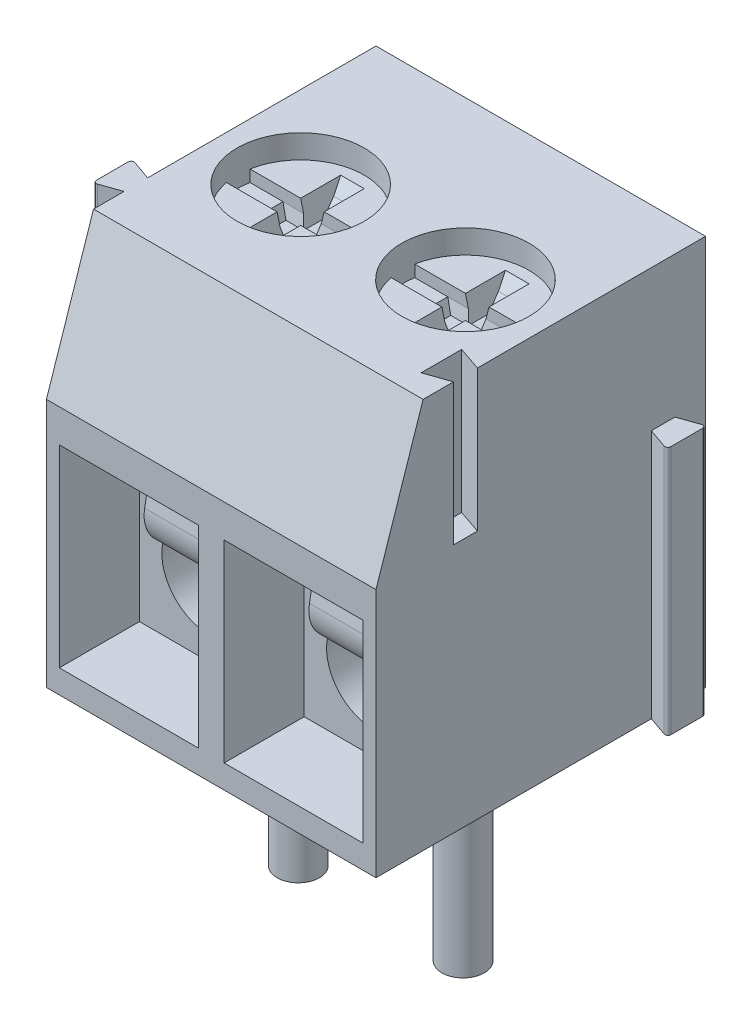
ISO-10303-21;
HEADER;
FILE_DESCRIPTION(('STEP AP214'),'2;1');
FILE_NAME('part.step','',(''),(''),'','','');
FILE_SCHEMA(('AUTOMOTIVE_DESIGN { 1 0 10303 214 1 1 1 1 }'));
ENDSEC;
DATA;
#1=APPLICATION_CONTEXT('core data for automotive mechanical design processes');
#2=APPLICATION_PROTOCOL_DEFINITION('international standard','automotive_design',2000,#1);
#3=PRODUCT_CONTEXT('',#1,'mechanical');
#4=PRODUCT('Part','Part','',(#3));
#5=PRODUCT_RELATED_PRODUCT_CATEGORY('part','',(#4));
#6=PRODUCT_DEFINITION_FORMATION('','',#4);
#7=PRODUCT_DEFINITION_CONTEXT('part definition',#1,'design');
#8=PRODUCT_DEFINITION('design','',#6,#7);
#9=PRODUCT_DEFINITION_SHAPE('','',#8);
#10=(LENGTH_UNIT() NAMED_UNIT(*) SI_UNIT(.MILLI.,.METRE.));
#11=(NAMED_UNIT(*) PLANE_ANGLE_UNIT() SI_UNIT($,.RADIAN.));
#12=(NAMED_UNIT(*) SI_UNIT($,.STERADIAN.) SOLID_ANGLE_UNIT());
#13=UNCERTAINTY_MEASURE_WITH_UNIT(LENGTH_MEASURE(1.E-05),#10,'distance_accuracy_value','');
#14=(GEOMETRIC_REPRESENTATION_CONTEXT(3) GLOBAL_UNCERTAINTY_ASSIGNED_CONTEXT((#13)) GLOBAL_UNIT_ASSIGNED_CONTEXT((#10,
#11,#12)) REPRESENTATION_CONTEXT('',''));
#15=CARTESIAN_POINT('',(0.,0.,0.));
#16=DIRECTION('',(0.,0.,1.));
#17=DIRECTION('',(1.,0.,0.));
#18=AXIS2_PLACEMENT_3D('',#15,#16,#17);
#19=CARTESIAN_POINT('',(-1.75,1.15,-1.8));
#20=DIRECTION('',(1.,0.,0.));
#21=DIRECTION('',(0.,0.,-1.));
#22=AXIS2_PLACEMENT_3D('',#19,#20,#21);
#23=CYLINDRICAL_SURFACE('',#22,0.55);
#24=DIRECTION('',(1.,0.,0.));
#25=VECTOR('',#24,1.);
#26=CARTESIAN_POINT('',(-1.75,0.6,-1.8));
#27=LINE('',#26,#25);
#28=CARTESIAN_POINT('',(-2.475,0.6,-1.8));
#29=VERTEX_POINT('',#28);
#30=CARTESIAN_POINT('',(-1.025,0.6,-1.8));
#31=VERTEX_POINT('',#30);
#32=EDGE_CURVE('E824',#29,#31,#27,.T.);
#33=ORIENTED_EDGE('',*,*,#32,.F.);
#34=CARTESIAN_POINT('',(-2.475,1.15,-1.8));
#35=DIRECTION('',(1.,0.,0.));
#36=DIRECTION('',(0.,0.,-1.));
#37=AXIS2_PLACEMENT_3D('',#34,#35,#36);
#38=CIRCLE('',#37,0.55);
#39=CARTESIAN_POINT('',(-2.475,1.24550649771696,-1.25835573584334));
#40=VERTEX_POINT('',#39);
#41=EDGE_CURVE('E1088',#29,#40,#38,.F.);
#42=ORIENTED_EDGE('',*,*,#41,.T.);
#43=DIRECTION('',(1.,0.,0.));
#44=VECTOR('',#43,1.);
#45=CARTESIAN_POINT('',(-1.75,1.24550649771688,-1.25835573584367));
#46=LINE('',#45,#44);
#47=CARTESIAN_POINT('',(-1.025,1.24550649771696,-1.25835573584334));
#48=VERTEX_POINT('',#47);
#49=EDGE_CURVE('E797',#40,#48,#46,.T.);
#50=ORIENTED_EDGE('',*,*,#49,.T.);
#51=CARTESIAN_POINT('',(-1.025,1.15,-1.8));
#52=DIRECTION('',(1.,0.,0.));
#53=DIRECTION('',(0.,0.,-1.));
#54=AXIS2_PLACEMENT_3D('',#51,#52,#53);
#55=CIRCLE('',#54,0.55);
#56=EDGE_CURVE('E1095',#31,#48,#55,.F.);
#57=ORIENTED_EDGE('',*,*,#56,.F.);
#58=EDGE_LOOP('',(#33,#42,#50,#57));
#59=FACE_BOUND('',#58,.T.);
#60=ADVANCED_FACE('F16',(#59),#23,.F.);
#61=CARTESIAN_POINT('',(-1.75,2.035329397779,-1.397622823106));
#62=DIRECTION('',(0.,0.173648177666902,0.984807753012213));
#63=DIRECTION('',(0.,-0.984807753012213,0.173648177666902));
#64=AXIS2_PLACEMENT_3D('',#61,#62,#63);
#65=PLANE('',#64);
#66=DIRECTION('',(0.,0.984807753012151,-0.173648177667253));
#67=VECTOR('',#66,1.);
#68=CARTESIAN_POINT('',(-1.025,1.245506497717,-1.258355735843));
#69=LINE('',#68,#67);
#70=CARTESIAN_POINT('',(-1.02499999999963,1.8152703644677,-1.35882047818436));
#71=VERTEX_POINT('',#70);
#72=EDGE_CURVE('E1098',#48,#71,#69,.T.);
#73=ORIENTED_EDGE('',*,*,#72,.F.);
#74=ORIENTED_EDGE('',*,*,#49,.F.);
#75=DIRECTION('',(0.,0.984807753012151,-0.173648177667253));
#76=VECTOR('',#75,1.);
#77=CARTESIAN_POINT('',(-2.475,1.245506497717,-1.258355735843));
#78=LINE('',#77,#76);
#79=CARTESIAN_POINT('',(-2.47500000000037,1.81527036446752,-1.35882047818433));
#80=VERTEX_POINT('',#79);
#81=EDGE_CURVE('E794',#40,#80,#78,.T.);
#82=ORIENTED_EDGE('',*,*,#81,.T.);
#83=CARTESIAN_POINT('',(-3.10000000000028,2.25538843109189,-1.43642516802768));
#84=CARTESIAN_POINT('',(-3.10002178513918,2.25003959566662,-1.43548202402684));
#85=CARTESIAN_POINT('',(-3.0995181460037,2.24470252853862,-1.43454095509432));
#86=CARTESIAN_POINT('',(-3.09757163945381,2.23425347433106,-1.43269850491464));
#87=CARTESIAN_POINT('',(-3.0961387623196,2.22913970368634,-1.43179680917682));
#88=CARTESIAN_POINT('',(-3.09244614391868,2.21923198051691,-1.43004981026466));
#89=CARTESIAN_POINT('',(-3.09018848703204,2.21443725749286,-1.42920437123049));
#90=CARTESIAN_POINT('',(-3.08501968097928,2.20519616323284,-1.42757491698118));
#91=CARTESIAN_POINT('',(-3.0821069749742,2.20075065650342,-1.42679105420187));
#92=CARTESIAN_POINT('',(-3.07295412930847,2.18837204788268,-1.4246083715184));
#93=CARTESIAN_POINT('',(-3.0660779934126,2.18089956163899,-1.42329077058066));
#94=CARTESIAN_POINT('',(-3.05132224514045,2.16695979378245,-1.42083281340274));
#95=CARTESIAN_POINT('',(-3.04343699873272,2.16049864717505,-1.41969353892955));
#96=CARTESIAN_POINT('',(-3.02121360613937,2.14394964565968,-1.4167755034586));
#97=CARTESIAN_POINT('',(-3.00631770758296,2.134600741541,-1.41512703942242));
#98=CARTESIAN_POINT('',(-2.97580685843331,2.11723486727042,-1.41206496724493));
#99=CARTESIAN_POINT('',(-2.96019238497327,2.10921702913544,-1.41065120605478));
#100=CARTESIAN_POINT('',(-2.92848513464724,2.09394484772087,-1.40795830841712));
#101=CARTESIAN_POINT('',(-2.91239029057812,2.0866946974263,-1.40667991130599));
#102=CARTESIAN_POINT('',(-2.87998606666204,2.07267153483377,-1.40420724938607));
#103=CARTESIAN_POINT('',(-2.86367661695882,2.06589868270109,-1.40301301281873));
#104=CARTESIAN_POINT('',(-2.81345648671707,2.04547265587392,-1.39941135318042));
#105=CARTESIAN_POINT('',(-2.77938355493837,2.0322110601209,-1.39707297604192));
#106=CARTESIAN_POINT('',(-2.72856044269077,2.01181091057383,-1.39347587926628));
#107=CARTESIAN_POINT('',(-2.71169983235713,2.00494017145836,-1.39226438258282));
#108=CARTESIAN_POINT('',(-2.67816014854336,1.99078450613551,-1.38976835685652));
#109=CARTESIAN_POINT('',(-2.66148103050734,1.98349968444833,-1.38848384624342));
#110=CARTESIAN_POINT('',(-2.63265950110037,1.97012737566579,-1.38612594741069));
#111=CARTESIAN_POINT('',(-2.62043918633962,1.96420470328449,-1.38508162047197));
#112=CARTESIAN_POINT('',(-2.5962872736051,1.95173063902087,-1.38288210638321));
#113=CARTESIAN_POINT('',(-2.58435653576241,1.94517760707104,-1.38172663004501));
#114=CARTESIAN_POINT('',(-2.56095012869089,1.93109950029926,-1.37924427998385));
#115=CARTESIAN_POINT('',(-2.5494789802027,1.92356691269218,-1.37791608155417));
#116=CARTESIAN_POINT('',(-2.52761877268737,1.90715001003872,-1.3750213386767));
#117=CARTESIAN_POINT('',(-2.51722550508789,1.89827131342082,-1.37345578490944));
#118=CARTESIAN_POINT('',(-2.49933702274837,1.8791704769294,-1.3700877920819));
#119=CARTESIAN_POINT('',(-2.49167423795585,1.86911776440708,-1.36831522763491));
#120=CARTESIAN_POINT('',(-2.4834313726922,1.85335704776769,-1.36553618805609));
#121=CARTESIAN_POINT('',(-2.48130565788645,1.84844670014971,-1.36467036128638));
#122=CARTESIAN_POINT('',(-2.47793297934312,1.8383457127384,-1.36288928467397));
#123=CARTESIAN_POINT('',(-2.47668421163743,1.83315567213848,-1.36197414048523));
#124=CARTESIAN_POINT('',(-2.47529941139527,1.82371840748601,-1.36031009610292));
#125=CARTESIAN_POINT('',(-2.47498808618,1.81949535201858,-1.35956545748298));
#126=CARTESIAN_POINT('',(-2.47500000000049,1.81527036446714,-1.3588204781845));
#127=B_SPLINE_CURVE_WITH_KNOTS('',3,(#83,#84,#85,#86,#87,#88,#89,#90,#91,#92,#93,#94,#95,#96,
#97,#98,#99,#100,#101,#102,#103,#104,#105,#106,#107,#108,#109,#110,#111,#112,#113,#114,#115,
#116,#117,#118,#119,#120,#121,#122,#123,#124,#125,#126),.UNSPECIFIED.,.F.,.F.,(4,2,2,2,2,2,2,2,
2,2,2,2,2,2,2,2,2,2,2,2,2,4),(0.,0.0162498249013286,0.0323277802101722,0.0483653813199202,
0.0644415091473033,0.0949811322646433,0.125699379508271,0.178538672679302,0.231343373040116,
0.284423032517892,0.337520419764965,0.44742702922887,0.502166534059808,0.556892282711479,
0.597740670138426,0.638698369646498,0.679991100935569,0.721116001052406,0.758875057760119,
0.775068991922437,0.791229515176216,0.804086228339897),.UNSPECIFIED.);
#128=CARTESIAN_POINT('',(-3.1,2.25538843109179,-1.43642516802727));
#129=VERTEX_POINT('',#128);
#130=EDGE_CURVE('E23',#129,#80,#127,.T.);
#131=ORIENTED_EDGE('',*,*,#130,.F.);
#132=DIRECTION('',(1.,0.,0.));
#133=VECTOR('',#132,1.);
#134=CARTESIAN_POINT('',(-1.75,2.25538843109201,-1.43642516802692));
#135=LINE('',#134,#133);
#136=CARTESIAN_POINT('',(-0.399999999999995,2.25538843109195,-1.4364251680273));
#137=VERTEX_POINT('',#136);
#138=EDGE_CURVE('E775',#129,#137,#135,.T.);
#139=ORIENTED_EDGE('',*,*,#138,.T.);
#140=CARTESIAN_POINT('',(-1.02499999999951,1.81527036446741,-1.35882047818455));
#141=CARTESIAN_POINT('',(-1.02502178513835,1.82061919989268,-1.35976362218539));
#142=CARTESIAN_POINT('',(-1.02451814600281,1.82595626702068,-1.36070469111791));
#143=CARTESIAN_POINT('',(-1.02257163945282,1.83640532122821,-1.36254714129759));
#144=CARTESIAN_POINT('',(-1.02113876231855,1.84151909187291,-1.3634488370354));
#145=CARTESIAN_POINT('',(-1.01744614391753,1.8514268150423,-1.36519583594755));
#146=CARTESIAN_POINT('',(-1.01518848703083,1.85622153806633,-1.36604127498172));
#147=CARTESIAN_POINT('',(-1.01001968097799,1.86546263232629,-1.36767072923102));
#148=CARTESIAN_POINT('',(-1.00710697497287,1.86990813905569,-1.36845459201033));
#149=CARTESIAN_POINT('',(-0.997954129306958,1.88228674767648,-1.37063727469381));
#150=CARTESIAN_POINT('',(-0.991077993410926,1.88975923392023,-1.37195487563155));
#151=CARTESIAN_POINT('',(-0.976322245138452,1.90369900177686,-1.37441283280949));
#152=CARTESIAN_POINT('',(-0.96843699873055,1.91016014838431,-1.37555210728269));
#153=CARTESIAN_POINT('',(-0.946213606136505,1.92670914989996,-1.37847014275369));
#154=CARTESIAN_POINT('',(-0.931317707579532,1.93605805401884,-1.3801186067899));
#155=CARTESIAN_POINT('',(-0.900806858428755,1.95342392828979,-1.38318067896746));
#156=CARTESIAN_POINT('',(-0.885192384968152,1.96144176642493,-1.38459444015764));
#157=CARTESIAN_POINT('',(-0.853485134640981,1.97671394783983,-1.38728733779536));
#158=CARTESIAN_POINT('',(-0.837390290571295,1.98396409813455,-1.38856573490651));
#159=CARTESIAN_POINT('',(-0.804986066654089,1.99798726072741,-1.39103839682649));
#160=CARTESIAN_POINT('',(-0.788676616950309,2.00476011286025,-1.39223263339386));
#161=CARTESIAN_POINT('',(-0.738456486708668,2.02518613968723,-1.39583429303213));
#162=CARTESIAN_POINT('',(-0.70438355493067,2.03844773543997,-1.39817267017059));
#163=CARTESIAN_POINT('',(-0.653560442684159,2.05884788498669,-1.40176976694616));
#164=CARTESIAN_POINT('',(-0.636699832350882,2.06571862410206,-1.40298126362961));
#165=CARTESIAN_POINT('',(-0.603160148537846,2.0798742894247,-1.40547728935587));
#166=CARTESIAN_POINT('',(-0.586481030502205,2.08715911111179,-1.40676179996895));
#167=CARTESIAN_POINT('',(-0.55765950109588,2.10053141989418,-1.40911969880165));
#168=CARTESIAN_POINT('',(-0.545439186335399,2.10645409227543,-1.41016402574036));
#169=CARTESIAN_POINT('',(-0.521287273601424,2.11892815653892,-1.41236353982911));
#170=CARTESIAN_POINT('',(-0.509356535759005,2.1254811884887,-1.4135190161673));
#171=CARTESIAN_POINT('',(-0.485950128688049,2.13955929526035,-1.41600136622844));
#172=CARTESIAN_POINT('',(-0.474478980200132,2.14709188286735,-1.4173295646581));
#173=CARTESIAN_POINT('',(-0.452618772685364,2.16350878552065,-1.42022430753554));
#174=CARTESIAN_POINT('',(-0.442225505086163,2.17238748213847,-1.42178986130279));
#175=CARTESIAN_POINT('',(-0.424337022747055,2.19148831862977,-1.4251578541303));
#176=CARTESIAN_POINT('',(-0.416674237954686,2.2015410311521,-1.42693041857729));
#177=CARTESIAN_POINT('',(-0.40843137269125,2.21730174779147,-1.42970945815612));
#178=CARTESIAN_POINT('',(-0.406305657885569,2.22221209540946,-1.43057528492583));
#179=CARTESIAN_POINT('',(-0.402932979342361,2.23231308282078,-1.43235636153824));
#180=CARTESIAN_POINT('',(-0.401684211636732,2.2375031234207,-1.43327150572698));
#181=CARTESIAN_POINT('',(-0.400299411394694,2.24694038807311,-1.43493555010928));
#182=CARTESIAN_POINT('',(-0.399988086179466,2.2511634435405,-1.43568018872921));
#183=CARTESIAN_POINT('',(-0.39999999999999,2.25538843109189,-1.43642516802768));
#184=B_SPLINE_CURVE_WITH_KNOTS('',3,(#140,#141,#142,#143,#144,#145,#146,#147,#148,#149,#150,
#151,#152,#153,#154,#155,#156,#157,#158,#159,#160,#161,#162,#163,#164,#165,#166,#167,#168,#169,
#170,#171,#172,#173,#174,#175,#176,#177,#178,#179,#180,#181,#182,#183),.UNSPECIFIED.,.F.,.F.,(4,
2,2,2,2,2,2,2,2,2,2,2,2,2,2,2,2,2,2,2,2,4),(0.,0.0162498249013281,0.0323277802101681,
0.0483653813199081,0.064441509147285,0.0949811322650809,0.12569937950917,0.178538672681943,
0.231343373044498,0.284423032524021,0.337520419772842,0.447427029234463,0.502166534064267,
0.556892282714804,0.597740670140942,0.638698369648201,0.679991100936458,0.721116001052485,
0.758875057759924,0.775068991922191,0.791229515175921,0.80408622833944),.UNSPECIFIED.);
#185=EDGE_CURVE('E823',#71,#137,#184,.T.);
#186=ORIENTED_EDGE('',*,*,#185,.F.);
#187=EDGE_LOOP('',(#73,#74,#82,#131,#139,#186));
#188=FACE_BOUND('',#187,.T.);
#189=ADVANCED_FACE('F790',(#188),#65,.F.);
#190=CARTESIAN_POINT('',(-1.75,0.6,-2.25));
#191=DIRECTION('',(0.,1.,0.));
#192=DIRECTION('',(0.,0.,1.));
#193=AXIS2_PLACEMENT_3D('',#190,#191,#192);
#194=PLANE('',#193);
#195=DIRECTION('',(0.,0.,-1.));
#196=VECTOR('',#195,1.);
#197=CARTESIAN_POINT('',(-1.025,0.6,-1.210107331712));
#198=LINE('',#197,#196);
#199=CARTESIAN_POINT('',(-1.025,0.6,-2.7));
#200=VERTEX_POINT('',#199);
#201=EDGE_CURVE('E819',#200,#31,#198,.F.);
#202=ORIENTED_EDGE('',*,*,#201,.F.);
#203=DIRECTION('',(1.,0.,0.));
#204=VECTOR('',#203,1.);
#205=CARTESIAN_POINT('',(-3.5,0.6,-2.7));
#206=LINE('',#205,#204);
#207=CARTESIAN_POINT('',(-2.475,0.6,-2.7));
#208=VERTEX_POINT('',#207);
#209=EDGE_CURVE('E802',#208,#200,#206,.T.);
#210=ORIENTED_EDGE('',*,*,#209,.F.);
#211=DIRECTION('',(0.,0.,-1.));
#212=VECTOR('',#211,1.);
#213=CARTESIAN_POINT('',(-2.475,0.6,-1.210107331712));
#214=LINE('',#213,#212);
#215=EDGE_CURVE('E1090',#208,#29,#214,.F.);
#216=ORIENTED_EDGE('',*,*,#215,.T.);
#217=ORIENTED_EDGE('',*,*,#32,.T.);
#218=EDGE_LOOP('',(#202,#210,#216,#217));
#219=FACE_BOUND('',#218,.T.);
#220=ADVANCED_FACE('F1061',(#219),#194,.T.);
#221=CARTESIAN_POINT('',(-1.75,0.4,-2.25));
#222=DIRECTION('',(0.,1.,0.));
#223=DIRECTION('',(0.,0.,1.));
#224=AXIS2_PLACEMENT_3D('',#221,#222,#223);
#225=PLANE('',#224);
#226=DIRECTION('',(1.,0.,0.));
#227=VECTOR('',#226,1.);
#228=CARTESIAN_POINT('',(-1.75,0.4,-1.8));
#229=LINE('',#228,#227);
#230=CARTESIAN_POINT('',(-2.475,0.4,-1.8));
#231=VERTEX_POINT('',#230);
#232=CARTESIAN_POINT('',(-1.025,0.4,-1.8));
#233=VERTEX_POINT('',#232);
#234=EDGE_CURVE('E817',#231,#233,#229,.T.);
#235=ORIENTED_EDGE('',*,*,#234,.F.);
#236=DIRECTION('',(0.,0.,-1.));
#237=VECTOR('',#236,1.);
#238=CARTESIAN_POINT('',(-2.475,0.4,-1.210107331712));
#239=LINE('',#238,#237);
#240=CARTESIAN_POINT('',(-2.475,0.4,-2.7));
#241=VERTEX_POINT('',#240);
#242=EDGE_CURVE('E1094',#231,#241,#239,.T.);
#243=ORIENTED_EDGE('',*,*,#242,.T.);
#244=DIRECTION('',(1.,0.,0.));
#245=VECTOR('',#244,1.);
#246=CARTESIAN_POINT('',(-3.5,0.4,-2.7));
#247=LINE('',#246,#245);
#248=CARTESIAN_POINT('',(-1.025,0.4,-2.7));
#249=VERTEX_POINT('',#248);
#250=EDGE_CURVE('E808',#249,#241,#247,.F.);
#251=ORIENTED_EDGE('',*,*,#250,.F.);
#252=DIRECTION('',(0.,0.,-1.));
#253=VECTOR('',#252,1.);
#254=CARTESIAN_POINT('',(-1.025,0.4,-1.210107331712));
#255=LINE('',#254,#253);
#256=EDGE_CURVE('E776',#233,#249,#255,.T.);
#257=ORIENTED_EDGE('',*,*,#256,.F.);
#258=EDGE_LOOP('',(#235,#243,#251,#257));
#259=FACE_BOUND('',#258,.T.);
#260=ADVANCED_FACE('F1065',(#259),#225,.F.);
#261=CARTESIAN_POINT('',(1.75,1.15,-1.8));
#262=DIRECTION('',(1.,0.,0.));
#263=DIRECTION('',(0.,0.,-1.));
#264=AXIS2_PLACEMENT_3D('',#261,#262,#263);
#265=CYLINDRICAL_SURFACE('',#264,0.55);
#266=DIRECTION('',(1.,0.,0.));
#267=VECTOR('',#266,1.);
#268=CARTESIAN_POINT('',(1.75,0.6,-1.8));
#269=LINE('',#268,#267);
#270=CARTESIAN_POINT('',(1.025,0.6,-1.8));
#271=VERTEX_POINT('',#270);
#272=CARTESIAN_POINT('',(2.475,0.6,-1.8));
#273=VERTEX_POINT('',#272);
#274=EDGE_CURVE('E1086',#271,#273,#269,.T.);
#275=ORIENTED_EDGE('',*,*,#274,.F.);
#276=CARTESIAN_POINT('',(1.025,1.15,-1.8));
#277=DIRECTION('',(1.,0.,0.));
#278=DIRECTION('',(0.,0.,-1.));
#279=AXIS2_PLACEMENT_3D('',#276,#277,#278);
#280=CIRCLE('',#279,0.55);
#281=CARTESIAN_POINT('',(1.025,1.24550649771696,-1.25835573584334));
#282=VERTEX_POINT('',#281);
#283=EDGE_CURVE('E1102',#271,#282,#280,.F.);
#284=ORIENTED_EDGE('',*,*,#283,.T.);
#285=DIRECTION('',(1.,0.,0.));
#286=VECTOR('',#285,1.);
#287=CARTESIAN_POINT('',(1.75,1.24550649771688,-1.25835573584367));
#288=LINE('',#287,#286);
#289=CARTESIAN_POINT('',(2.475,1.24550649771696,-1.25835573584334));
#290=VERTEX_POINT('',#289);
#291=EDGE_CURVE('E1087',#282,#290,#288,.T.);
#292=ORIENTED_EDGE('',*,*,#291,.T.);
#293=CARTESIAN_POINT('',(2.475,1.15,-1.8));
#294=DIRECTION('',(1.,0.,0.));
#295=DIRECTION('',(0.,0.,-1.));
#296=AXIS2_PLACEMENT_3D('',#293,#294,#295);
#297=CIRCLE('',#296,0.55);
#298=EDGE_CURVE('E1112',#273,#290,#297,.F.);
#299=ORIENTED_EDGE('',*,*,#298,.F.);
#300=EDGE_LOOP('',(#275,#284,#292,#299));
#301=FACE_BOUND('',#300,.T.);
#302=ADVANCED_FACE('F1069',(#301),#265,.F.);
#303=CARTESIAN_POINT('',(1.75,2.035329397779,-1.397622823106));
#304=DIRECTION('',(0.,0.173648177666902,0.984807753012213));
#305=DIRECTION('',(0.,-0.984807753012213,0.173648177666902));
#306=AXIS2_PLACEMENT_3D('',#303,#304,#305);
#307=PLANE('',#306);
#308=DIRECTION('',(0.,0.984807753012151,-0.173648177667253));
#309=VECTOR('',#308,1.);
#310=CARTESIAN_POINT('',(2.475,1.245506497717,-1.258355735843));
#311=LINE('',#310,#309);
#312=CARTESIAN_POINT('',(2.47500000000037,1.8152703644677,-1.35882047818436));
#313=VERTEX_POINT('',#312);
#314=EDGE_CURVE('E1115',#290,#313,#311,.T.);
#315=ORIENTED_EDGE('',*,*,#314,.F.);
#316=ORIENTED_EDGE('',*,*,#291,.F.);
#317=DIRECTION('',(0.,0.984807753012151,-0.173648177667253));
#318=VECTOR('',#317,1.);
#319=CARTESIAN_POINT('',(1.025,1.245506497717,-1.258355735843));
#320=LINE('',#319,#318);
#321=CARTESIAN_POINT('',(1.02499999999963,1.81527036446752,-1.35882047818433));
#322=VERTEX_POINT('',#321);
#323=EDGE_CURVE('E1105',#282,#322,#320,.T.);
#324=ORIENTED_EDGE('',*,*,#323,.T.);
#325=CARTESIAN_POINT('',(0.39999999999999,2.25538843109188,-1.43642516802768));
#326=CARTESIAN_POINT('',(0.399978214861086,2.25003959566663,-1.43548202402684));
#327=CARTESIAN_POINT('',(0.400481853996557,2.24470252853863,-1.43454095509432));
#328=CARTESIAN_POINT('',(0.402428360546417,2.23425347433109,-1.43269850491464));
#329=CARTESIAN_POINT('',(0.403861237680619,2.22913970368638,-1.43179680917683));
#330=CARTESIAN_POINT('',(0.407553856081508,2.21923198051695,-1.43004981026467));
#331=CARTESIAN_POINT('',(0.409811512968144,2.2144372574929,-1.4292043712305));
#332=CARTESIAN_POINT('',(0.414980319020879,2.20519616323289,-1.42757491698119));
#333=CARTESIAN_POINT('',(0.41789302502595,2.20075065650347,-1.42679105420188));
#334=CARTESIAN_POINT('',(0.427045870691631,2.18837204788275,-1.42460837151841));
#335=CARTESIAN_POINT('',(0.43392200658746,2.18089956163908,-1.42329077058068));
#336=CARTESIAN_POINT('',(0.448677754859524,2.16695979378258,-1.42083281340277));
#337=CARTESIAN_POINT('',(0.456563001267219,2.16049864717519,-1.41969353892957));
#338=CARTESIAN_POINT('',(0.478786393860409,2.1439496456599,-1.41677550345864));
#339=CARTESIAN_POINT('',(0.493682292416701,2.13460074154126,-1.41512703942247));
#340=CARTESIAN_POINT('',(0.524193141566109,2.11723486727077,-1.41206496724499));
#341=CARTESIAN_POINT('',(0.539807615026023,2.10921702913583,-1.41065120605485));
#342=CARTESIAN_POINT('',(0.571514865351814,2.09394484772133,-1.4079583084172));
#343=CARTESIAN_POINT('',(0.58760970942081,2.08669469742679,-1.40667991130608));
#344=CARTESIAN_POINT('',(0.620013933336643,2.07267153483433,-1.40420724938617));
#345=CARTESIAN_POINT('',(0.63632338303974,2.06589868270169,-1.40301301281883));
#346=CARTESIAN_POINT('',(0.686543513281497,2.04547265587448,-1.39941135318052));
#347=CARTESIAN_POINT('',(0.720616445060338,2.03221106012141,-1.39707297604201));
#348=CARTESIAN_POINT('',(0.77143955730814,2.01181091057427,-1.39347587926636));
#349=CARTESIAN_POINT('',(0.78830016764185,2.00494017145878,-1.39226438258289));
#350=CARTESIAN_POINT('',(0.821839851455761,1.99078450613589,-1.38976835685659));
#351=CARTESIAN_POINT('',(0.838518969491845,1.98349968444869,-1.38848384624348));
#352=CARTESIAN_POINT('',(0.867340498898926,1.97012737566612,-1.38612594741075));
#353=CARTESIAN_POINT('',(0.879560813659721,1.96420470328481,-1.38508162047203));
#354=CARTESIAN_POINT('',(0.903712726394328,1.95173063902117,-1.38288210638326));
#355=CARTESIAN_POINT('',(0.915643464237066,1.94517760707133,-1.38172663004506));
#356=CARTESIAN_POINT('',(0.939049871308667,1.93109950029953,-1.3792442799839));
#357=CARTESIAN_POINT('',(0.950521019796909,1.92356691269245,-1.37791608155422));
#358=CARTESIAN_POINT('',(0.972381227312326,1.90715001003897,-1.37502133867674));
#359=CARTESIAN_POINT('',(0.982774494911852,1.89827131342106,-1.37345578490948));
#360=CARTESIAN_POINT('',(1.00066297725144,1.87917047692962,-1.37008779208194));
#361=CARTESIAN_POINT('',(1.008325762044,1.8691177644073,-1.36831522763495));
#362=CARTESIAN_POINT('',(1.0165686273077,1.85335704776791,-1.36553618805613));
#363=CARTESIAN_POINT('',(1.01869434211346,1.84844670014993,-1.36467036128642));
#364=CARTESIAN_POINT('',(1.02206702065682,1.83834571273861,-1.36288928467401));
#365=CARTESIAN_POINT('',(1.02331578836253,1.83315567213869,-1.36197414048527));
#366=CARTESIAN_POINT('',(1.02470058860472,1.82371840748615,-1.36031009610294));
#367=CARTESIAN_POINT('',(1.02501191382,1.81949535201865,-1.35956545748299));
#368=CARTESIAN_POINT('',(1.02499999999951,1.81527036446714,-1.3588204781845));
#369=B_SPLINE_CURVE_WITH_KNOTS('',3,(#325,#326,#327,#328,#329,#330,#331,#332,#333,#334,#335,
#336,#337,#338,#339,#340,#341,#342,#343,#344,#345,#346,#347,#348,#349,#350,#351,#352,#353,#354,
#355,#356,#357,#358,#359,#360,#361,#362,#363,#364,#365,#366,#367,#368),.UNSPECIFIED.,.F.,.F.,(4,
2,2,2,2,2,2,2,2,2,2,2,2,2,2,2,2,2,2,2,2,4),(0.,0.0162498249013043,0.0323277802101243,
0.0483653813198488,0.0644415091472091,0.0949811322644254,0.125699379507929,0.178538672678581,
0.231343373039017,0.284423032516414,0.337520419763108,0.447427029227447,0.502166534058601,
0.556892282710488,0.597740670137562,0.638698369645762,0.67999110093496,0.721116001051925,
0.758875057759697,0.775068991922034,0.791229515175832,0.804086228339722),.UNSPECIFIED.);
#370=CARTESIAN_POINT('',(0.4,2.25538843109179,-1.43642516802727));
#371=VERTEX_POINT('',#370);
#372=EDGE_CURVE('E826',#371,#322,#369,.T.);
#373=ORIENTED_EDGE('',*,*,#372,.F.);
#374=DIRECTION('',(1.,0.,0.));
#375=VECTOR('',#374,1.);
#376=CARTESIAN_POINT('',(1.75,2.25538843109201,-1.43642516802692));
#377=LINE('',#376,#375);
#378=CARTESIAN_POINT('',(3.10000000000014,2.25538843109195,-1.4364251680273));
#379=VERTEX_POINT('',#378);
#380=EDGE_CURVE('E1120',#371,#379,#377,.T.);
#381=ORIENTED_EDGE('',*,*,#380,.T.);
#382=CARTESIAN_POINT('',(2.47500000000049,1.81527036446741,-1.35882047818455));
#383=CARTESIAN_POINT('',(2.47497821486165,1.82061919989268,-1.35976362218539));
#384=CARTESIAN_POINT('',(2.47548185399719,1.82595626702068,-1.36070469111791));
#385=CARTESIAN_POINT('',(2.47742836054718,1.83640532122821,-1.36254714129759));
#386=CARTESIAN_POINT('',(2.47886123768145,1.84151909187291,-1.3634488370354));
#387=CARTESIAN_POINT('',(2.48255385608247,1.8514268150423,-1.36519583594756));
#388=CARTESIAN_POINT('',(2.48481151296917,1.85622153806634,-1.36604127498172));
#389=CARTESIAN_POINT('',(2.48998031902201,1.8654626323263,-1.36767072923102));
#390=CARTESIAN_POINT('',(2.49289302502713,1.86990813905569,-1.36845459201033));
#391=CARTESIAN_POINT('',(2.50204587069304,1.88228674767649,-1.37063727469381));
#392=CARTESIAN_POINT('',(2.50892200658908,1.88975923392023,-1.37195487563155));
#393=CARTESIAN_POINT('',(2.52367775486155,1.90369900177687,-1.37441283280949));
#394=CARTESIAN_POINT('',(2.53156300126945,1.91016014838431,-1.37555210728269));
#395=CARTESIAN_POINT('',(2.5537863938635,1.92670914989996,-1.37847014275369));
#396=CARTESIAN_POINT('',(2.56868229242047,1.93605805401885,-1.3801186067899));
#397=CARTESIAN_POINT('',(2.59919314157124,1.95342392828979,-1.38318067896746));
#398=CARTESIAN_POINT('',(2.61480761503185,1.96144176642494,-1.38459444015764));
#399=CARTESIAN_POINT('',(2.64651486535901,1.97671394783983,-1.38728733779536));
#400=CARTESIAN_POINT('',(2.6626097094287,1.98396409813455,-1.38856573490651));
#401=CARTESIAN_POINT('',(2.6950139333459,1.99798726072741,-1.39103839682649));
#402=CARTESIAN_POINT('',(2.71132338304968,2.00476011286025,-1.39223263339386));
#403=CARTESIAN_POINT('',(2.76154351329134,2.02518613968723,-1.39583429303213));
#404=CARTESIAN_POINT('',(2.79561644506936,2.03844773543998,-1.39817267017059));
#405=CARTESIAN_POINT('',(2.8464395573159,2.05884788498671,-1.40176976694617));
#406=CARTESIAN_POINT('',(2.86330016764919,2.06571862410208,-1.40298126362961));
#407=CARTESIAN_POINT('',(2.89683985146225,2.07987428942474,-1.40547728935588));
#408=CARTESIAN_POINT('',(2.9135189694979,2.08715911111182,-1.40676179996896));
#409=CARTESIAN_POINT('',(2.94234049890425,2.10053141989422,-1.40911969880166));
#410=CARTESIAN_POINT('',(2.95456081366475,2.10645409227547,-1.41016402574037));
#411=CARTESIAN_POINT('',(2.97871272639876,2.11892815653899,-1.41236353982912));
#412=CARTESIAN_POINT('',(2.9906434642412,2.12548118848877,-1.41351901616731));
#413=CARTESIAN_POINT('',(3.01404987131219,2.13955929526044,-1.41600136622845));
#414=CARTESIAN_POINT('',(3.02552101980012,2.14709188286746,-1.41732956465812));
#415=CARTESIAN_POINT('',(3.04738122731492,2.16350878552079,-1.42022430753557));
#416=CARTESIAN_POINT('',(3.05777449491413,2.17238748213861,-1.42178986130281));
#417=CARTESIAN_POINT('',(3.07566297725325,2.19148831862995,-1.42515785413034));
#418=CARTESIAN_POINT('',(3.08332576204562,2.20154103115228,-1.42693041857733));
#419=CARTESIAN_POINT('',(3.09156862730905,2.21730174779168,-1.42970945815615));
#420=CARTESIAN_POINT('',(3.09369434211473,2.22221209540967,-1.43057528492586));
#421=CARTESIAN_POINT('',(3.09706702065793,2.232313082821,-1.43235636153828));
#422=CARTESIAN_POINT('',(3.09831578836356,2.23750312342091,-1.43327150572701));
#423=CARTESIAN_POINT('',(3.09970058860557,2.24694038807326,-1.43493555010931));
#424=CARTESIAN_POINT('',(3.1000119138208,2.25116344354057,-1.43568018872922));
#425=CARTESIAN_POINT('',(3.10000000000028,2.25538843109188,-1.43642516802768));
#426=B_SPLINE_CURVE_WITH_KNOTS('',3,(#382,#383,#384,#385,#386,#387,#388,#389,#390,#391,#392,
#393,#394,#395,#396,#397,#398,#399,#400,#401,#402,#403,#404,#405,#406,#407,#408,#409,#410,#411,
#412,#413,#414,#415,#416,#417,#418,#419,#420,#421,#422,#423,#424,#425),.UNSPECIFIED.,.F.,.F.,(4,
2,2,2,2,2,2,2,2,2,2,2,2,2,2,2,2,2,2,2,2,4),(0.,0.0162498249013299,0.0323277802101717,
0.0483653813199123,0.0644415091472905,0.0949811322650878,0.125699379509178,0.178538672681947,
0.231343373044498,0.284423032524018,0.337520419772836,0.447427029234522,0.502166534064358,
0.556892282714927,0.597740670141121,0.638698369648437,0.679991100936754,0.72111600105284,
0.758875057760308,0.775068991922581,0.791229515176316,0.804086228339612),.UNSPECIFIED.);
#427=EDGE_CURVE('E1081',#313,#379,#426,.T.);
#428=ORIENTED_EDGE('',*,*,#427,.F.);
#429=EDGE_LOOP('',(#315,#316,#324,#373,#381,#428));
#430=FACE_BOUND('',#429,.T.);
#431=ADVANCED_FACE('F1072',(#430),#307,.F.);
#432=CARTESIAN_POINT('',(1.75,0.6,-2.25));
#433=DIRECTION('',(0.,1.,0.));
#434=DIRECTION('',(0.,0.,1.));
#435=AXIS2_PLACEMENT_3D('',#432,#433,#434);
#436=PLANE('',#435);
#437=DIRECTION('',(1.,0.,0.));
#438=VECTOR('',#437,1.);
#439=CARTESIAN_POINT('',(0.,0.6,-2.7));
#440=LINE('',#439,#438);
#441=CARTESIAN_POINT('',(1.025,0.6,-2.7));
#442=VERTEX_POINT('',#441);
#443=CARTESIAN_POINT('',(2.475,0.6,-2.7));
#444=VERTEX_POINT('',#443);
#445=EDGE_CURVE('E1185',#442,#444,#440,.T.);
#446=ORIENTED_EDGE('',*,*,#445,.F.);
#447=DIRECTION('',(0.,0.,-1.));
#448=VECTOR('',#447,1.);
#449=CARTESIAN_POINT('',(1.025,0.6,-1.210107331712));
#450=LINE('',#449,#448);
#451=EDGE_CURVE('E1106',#442,#271,#450,.F.);
#452=ORIENTED_EDGE('',*,*,#451,.T.);
#453=ORIENTED_EDGE('',*,*,#274,.T.);
#454=DIRECTION('',(0.,0.,-1.));
#455=VECTOR('',#454,1.);
#456=CARTESIAN_POINT('',(2.475,0.6,-1.210107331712));
#457=LINE('',#456,#455);
#458=EDGE_CURVE('E1121',#444,#273,#457,.F.);
#459=ORIENTED_EDGE('',*,*,#458,.F.);
#460=EDGE_LOOP('',(#446,#452,#453,#459));
#461=FACE_BOUND('',#460,.T.);
#462=ADVANCED_FACE('F1077',(#461),#436,.T.);
#463=CARTESIAN_POINT('',(1.75,0.4,-2.25));
#464=DIRECTION('',(0.,1.,0.));
#465=DIRECTION('',(0.,0.,1.));
#466=AXIS2_PLACEMENT_3D('',#463,#464,#465);
#467=PLANE('',#466);
#468=DIRECTION('',(0.,0.,-1.));
#469=VECTOR('',#468,1.);
#470=CARTESIAN_POINT('',(2.475,0.4,-1.210107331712));
#471=LINE('',#470,#469);
#472=CARTESIAN_POINT('',(2.475,0.4,-1.8));
#473=VERTEX_POINT('',#472);
#474=CARTESIAN_POINT('',(2.475,0.4,-2.7));
#475=VERTEX_POINT('',#474);
#476=EDGE_CURVE('E1118',#473,#475,#471,.T.);
#477=ORIENTED_EDGE('',*,*,#476,.F.);
#478=DIRECTION('',(1.,0.,0.));
#479=VECTOR('',#478,1.);
#480=CARTESIAN_POINT('',(1.75,0.4,-1.8));
#481=LINE('',#480,#479);
#482=CARTESIAN_POINT('',(1.025,0.4,-1.8));
#483=VERTEX_POINT('',#482);
#484=EDGE_CURVE('E1111',#483,#473,#481,.T.);
#485=ORIENTED_EDGE('',*,*,#484,.F.);
#486=DIRECTION('',(0.,0.,-1.));
#487=VECTOR('',#486,1.);
#488=CARTESIAN_POINT('',(1.025,0.4,-1.210107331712));
#489=LINE('',#488,#487);
#490=CARTESIAN_POINT('',(1.025,0.4,-2.7));
#491=VERTEX_POINT('',#490);
#492=EDGE_CURVE('E832',#483,#491,#489,.T.);
#493=ORIENTED_EDGE('',*,*,#492,.T.);
#494=DIRECTION('',(1.,0.,0.));
#495=VECTOR('',#494,1.);
#496=CARTESIAN_POINT('',(0.,0.4,-2.7));
#497=LINE('',#496,#495);
#498=EDGE_CURVE('E1184',#475,#491,#497,.F.);
#499=ORIENTED_EDGE('',*,*,#498,.F.);
#500=EDGE_LOOP('',(#477,#485,#493,#499));
#501=FACE_BOUND('',#500,.T.);
#502=ADVANCED_FACE('F2594',(#501),#467,.F.);
#503=CARTESIAN_POINT('',(-2.475,1.547753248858,-1.210107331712));
#504=DIRECTION('',(1.,0.,0.));
#505=DIRECTION('',(0.,0.,-1.));
#506=AXIS2_PLACEMENT_3D('',#503,#504,#505);
#507=PLANE('',#506);
#508=CARTESIAN_POINT('',(-2.475,1.15,-1.8));
#509=DIRECTION('',(1.,0.,0.));
#510=DIRECTION('',(0.,0.,-1.));
#511=AXIS2_PLACEMENT_3D('',#508,#509,#510);
#512=CIRCLE('',#511,0.75);
#513=CARTESIAN_POINT('',(-2.475,1.28023613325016,-1.06139418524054));
#514=VERTEX_POINT('',#513);
#515=EDGE_CURVE('E820',#514,#231,#512,.T.);
#516=ORIENTED_EDGE('',*,*,#515,.F.);
#517=DIRECTION('',(0.,-0.984807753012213,0.173648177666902));
#518=VECTOR('',#517,1.);
#519=CARTESIAN_POINT('',(-2.475,2.070059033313,-1.200661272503));
#520=LINE('',#519,#518);
#521=CARTESIAN_POINT('',(-2.47500000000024,1.85000000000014,-1.16185892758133));
#522=VERTEX_POINT('',#521);
#523=EDGE_CURVE('E1020',#522,#514,#520,.T.);
#524=ORIENTED_EDGE('',*,*,#523,.F.);
#525=DIRECTION('',(0.,0.173648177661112,0.984807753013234));
#526=VECTOR('',#525,1.);
#527=CARTESIAN_POINT('',(-2.47500000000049,1.83263518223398,-1.26033970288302));
#528=LINE('',#527,#526);
#529=EDGE_CURVE('E1155',#80,#522,#528,.T.);
#530=ORIENTED_EDGE('',*,*,#529,.F.);
#531=ORIENTED_EDGE('',*,*,#81,.F.);
#532=ORIENTED_EDGE('',*,*,#41,.F.);
#533=ORIENTED_EDGE('',*,*,#215,.F.);
#534=DIRECTION('',(0.,1.,0.));
#535=VECTOR('',#534,1.);
#536=CARTESIAN_POINT('',(-2.475,0.,-2.7));
#537=LINE('',#536,#535);
#538=EDGE_CURVE('E812',#241,#208,#537,.T.);
#539=ORIENTED_EDGE('',*,*,#538,.F.);
#540=ORIENTED_EDGE('',*,*,#242,.F.);
#541=EDGE_LOOP('',(#516,#524,#530,#531,#532,#533,#539,#540));
#542=FACE_BOUND('',#541,.T.);
#543=ADVANCED_FACE('F2598',(#542),#507,.F.);
#544=CARTESIAN_POINT('',(-1.75,1.15,-1.8));
#545=DIRECTION('',(1.,0.,0.));
#546=DIRECTION('',(0.,0.,-1.));
#547=AXIS2_PLACEMENT_3D('',#544,#545,#546);
#548=CYLINDRICAL_SURFACE('',#547,0.75);
#549=CARTESIAN_POINT('',(-1.025,1.15,-1.8));
#550=DIRECTION('',(1.,0.,0.));
#551=DIRECTION('',(0.,0.,-1.));
#552=AXIS2_PLACEMENT_3D('',#549,#550,#551);
#553=CIRCLE('',#552,0.75);
#554=CARTESIAN_POINT('',(-1.025,1.28023613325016,-1.06139418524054));
#555=VERTEX_POINT('',#554);
#556=EDGE_CURVE('E1099',#555,#233,#553,.T.);
#557=ORIENTED_EDGE('',*,*,#556,.F.);
#558=DIRECTION('',(1.,0.,0.));
#559=VECTOR('',#558,1.);
#560=CARTESIAN_POINT('',(-1.75,1.28023613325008,-1.06139418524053));
#561=LINE('',#560,#559);
#562=EDGE_CURVE('E1163',#514,#555,#561,.T.);
#563=ORIENTED_EDGE('',*,*,#562,.F.);
#564=ORIENTED_EDGE('',*,*,#515,.T.);
#565=ORIENTED_EDGE('',*,*,#234,.T.);
#566=EDGE_LOOP('',(#557,#563,#564,#565));
#567=FACE_BOUND('',#566,.T.);
#568=ADVANCED_FACE('F3210',(#567),#548,.T.);
#569=CARTESIAN_POINT('',(-1.025,1.547753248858,-1.210107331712));
#570=DIRECTION('',(1.,0.,0.));
#571=DIRECTION('',(0.,0.,-1.));
#572=AXIS2_PLACEMENT_3D('',#569,#570,#571);
#573=PLANE('',#572);
#574=ORIENTED_EDGE('',*,*,#256,.T.);
#575=DIRECTION('',(0.,1.,0.));
#576=VECTOR('',#575,1.);
#577=CARTESIAN_POINT('',(-1.025,0.,-2.7));
#578=LINE('',#577,#576);
#579=EDGE_CURVE('E813',#200,#249,#578,.F.);
#580=ORIENTED_EDGE('',*,*,#579,.F.);
#581=ORIENTED_EDGE('',*,*,#201,.T.);
#582=ORIENTED_EDGE('',*,*,#56,.T.);
#583=ORIENTED_EDGE('',*,*,#72,.T.);
#584=DIRECTION('',(0.,-0.173648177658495,-0.984807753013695));
#585=VECTOR('',#584,1.);
#586=CARTESIAN_POINT('',(-1.02499999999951,1.83263518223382,-1.2603397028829));
#587=LINE('',#586,#585);
#588=CARTESIAN_POINT('',(-1.02499999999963,1.84999999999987,-1.16185892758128));
#589=VERTEX_POINT('',#588);
#590=EDGE_CURVE('E1021',#589,#71,#587,.T.);
#591=ORIENTED_EDGE('',*,*,#590,.F.);
#592=DIRECTION('',(0.,-0.984807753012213,0.173648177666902));
#593=VECTOR('',#592,1.);
#594=CARTESIAN_POINT('',(-1.025,2.070059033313,-1.200661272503));
#595=LINE('',#594,#593);
#596=EDGE_CURVE('E1167',#555,#589,#595,.F.);
#597=ORIENTED_EDGE('',*,*,#596,.F.);
#598=ORIENTED_EDGE('',*,*,#556,.T.);
#599=EDGE_LOOP('',(#574,#580,#581,#582,#583,#591,#597,#598));
#600=FACE_BOUND('',#599,.T.);
#601=ADVANCED_FACE('F3202',(#600),#573,.T.);
#602=CARTESIAN_POINT('',(-1.75,2.225,-1.608766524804));
#603=DIRECTION('',(1.,0.,0.));
#604=DIRECTION('',(0.,0.,-1.));
#605=AXIS2_PLACEMENT_3D('',#602,#603,#604);
#606=CYLINDRICAL_SURFACE('',#605,0.175);
#607=ORIENTED_EDGE('',*,*,#138,.F.);
#608=CARTESIAN_POINT('',(-3.1,2.225,-1.608766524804));
#609=DIRECTION('',(1.,0.,0.));
#610=DIRECTION('',(0.,0.,-1.));
#611=AXIS2_PLACEMENT_3D('',#608,#609,#610);
#612=CIRCLE('',#611,0.175);
#613=CARTESIAN_POINT('',(-3.1,2.4,-1.608766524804));
#614=VERTEX_POINT('',#613);
#615=EDGE_CURVE('E764',#614,#129,#612,.T.);
#616=ORIENTED_EDGE('',*,*,#615,.F.);
#617=DIRECTION('',(1.,0.,0.));
#618=VECTOR('',#617,1.);
#619=CARTESIAN_POINT('',(-1.75,2.4,-1.608766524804));
#620=LINE('',#619,#618);
#621=CARTESIAN_POINT('',(-0.4,2.4,-1.608766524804));
#622=VERTEX_POINT('',#621);
#623=EDGE_CURVE('E1562',#614,#622,#620,.T.);
#624=ORIENTED_EDGE('',*,*,#623,.T.);
#625=CARTESIAN_POINT('',(-0.4,2.225,-1.608766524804));
#626=DIRECTION('',(1.,0.,0.));
#627=DIRECTION('',(0.,0.,-1.));
#628=AXIS2_PLACEMENT_3D('',#625,#626,#627);
#629=CIRCLE('',#628,0.175);
#630=EDGE_CURVE('E800',#137,#622,#629,.F.);
#631=ORIENTED_EDGE('',*,*,#630,.F.);
#632=EDGE_LOOP('',(#607,#616,#624,#631));
#633=FACE_BOUND('',#632,.T.);
#634=ADVANCED_FACE('F799',(#633),#606,.F.);
#635=CARTESIAN_POINT('',(-3.5,0.,-2.7));
#636=DIRECTION('',(0.,0.,1.));
#637=DIRECTION('',(1.,0.,0.));
#638=AXIS2_PLACEMENT_3D('',#635,#636,#637);
#639=PLANE('',#638);
#640=ORIENTED_EDGE('',*,*,#250,.T.);
#641=ORIENTED_EDGE('',*,*,#538,.T.);
#642=ORIENTED_EDGE('',*,*,#209,.T.);
#643=ORIENTED_EDGE('',*,*,#579,.T.);
#644=EDGE_LOOP('',(#640,#641,#642,#643));
#645=FACE_BOUND('',#644,.T.);
#646=CARTESIAN_POINT('',(-1.75,0.,-2.7));
#647=DIRECTION('',(0.,0.,1.));
#648=DIRECTION('',(1.,0.,0.));
#649=AXIS2_PLACEMENT_3D('',#646,#647,#648);
#650=CIRCLE('',#649,1.);
#651=CARTESIAN_POINT('',(-0.75,0.,-2.7));
#652=VERTEX_POINT('',#651);
#653=EDGE_CURVE('E1152',#652,#652,#650,.T.);
#654=ORIENTED_EDGE('',*,*,#653,.T.);
#655=EDGE_LOOP('',(#654));
#656=FACE_BOUND('',#655,.T.);
#657=ADVANCED_FACE('F2611',(#645,#656),#639,.T.);
#658=CARTESIAN_POINT('',(1.025,1.547753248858,-1.210107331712));
#659=DIRECTION('',(1.,0.,0.));
#660=DIRECTION('',(0.,0.,-1.));
#661=AXIS2_PLACEMENT_3D('',#658,#659,#660);
#662=PLANE('',#661);
#663=DIRECTION('',(0.,-0.984807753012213,0.173648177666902));
#664=VECTOR('',#663,1.);
#665=CARTESIAN_POINT('',(1.025,2.070059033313,-1.200661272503));
#666=LINE('',#665,#664);
#667=CARTESIAN_POINT('',(1.02499999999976,1.85000000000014,-1.16185892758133));
#668=VERTEX_POINT('',#667);
#669=CARTESIAN_POINT('',(1.025,1.28023613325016,-1.06139418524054));
#670=VERTEX_POINT('',#669);
#671=EDGE_CURVE('E1142',#668,#670,#666,.T.);
#672=ORIENTED_EDGE('',*,*,#671,.F.);
#673=DIRECTION('',(0.,0.173648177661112,0.984807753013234));
#674=VECTOR('',#673,1.);
#675=CARTESIAN_POINT('',(1.02499999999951,1.83263518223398,-1.26033970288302));
#676=LINE('',#675,#674);
#677=EDGE_CURVE('E1150',#322,#668,#676,.T.);
#678=ORIENTED_EDGE('',*,*,#677,.F.);
#679=ORIENTED_EDGE('',*,*,#323,.F.);
#680=ORIENTED_EDGE('',*,*,#283,.F.);
#681=ORIENTED_EDGE('',*,*,#451,.F.);
#682=DIRECTION('',(0.,1.,0.));
#683=VECTOR('',#682,1.);
#684=CARTESIAN_POINT('',(1.025,0.,-2.7));
#685=LINE('',#684,#683);
#686=EDGE_CURVE('E806',#491,#442,#685,.T.);
#687=ORIENTED_EDGE('',*,*,#686,.F.);
#688=ORIENTED_EDGE('',*,*,#492,.F.);
#689=CARTESIAN_POINT('',(1.025,1.15,-1.8));
#690=DIRECTION('',(1.,0.,0.));
#691=DIRECTION('',(0.,0.,-1.));
#692=AXIS2_PLACEMENT_3D('',#689,#690,#691);
#693=CIRCLE('',#692,0.75);
#694=EDGE_CURVE('E1107',#670,#483,#693,.T.);
#695=ORIENTED_EDGE('',*,*,#694,.F.);
#696=EDGE_LOOP('',(#672,#678,#679,#680,#681,#687,#688,#695));
#697=FACE_BOUND('',#696,.T.);
#698=ADVANCED_FACE('F1204',(#697),#662,.F.);
#699=CARTESIAN_POINT('',(1.75,1.15,-1.8));
#700=DIRECTION('',(1.,0.,0.));
#701=DIRECTION('',(0.,0.,-1.));
#702=AXIS2_PLACEMENT_3D('',#699,#700,#701);
#703=CYLINDRICAL_SURFACE('',#702,0.75);
#704=CARTESIAN_POINT('',(2.475,1.15,-1.8));
#705=DIRECTION('',(1.,0.,0.));
#706=DIRECTION('',(0.,0.,-1.));
#707=AXIS2_PLACEMENT_3D('',#704,#705,#706);
#708=CIRCLE('',#707,0.75);
#709=CARTESIAN_POINT('',(2.475,1.28023613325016,-1.06139418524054));
#710=VERTEX_POINT('',#709);
#711=EDGE_CURVE('E1116',#710,#473,#708,.T.);
#712=ORIENTED_EDGE('',*,*,#711,.F.);
#713=DIRECTION('',(1.,0.,0.));
#714=VECTOR('',#713,1.);
#715=CARTESIAN_POINT('',(1.75,1.28023613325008,-1.06139418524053));
#716=LINE('',#715,#714);
#717=EDGE_CURVE('E1139',#670,#710,#716,.T.);
#718=ORIENTED_EDGE('',*,*,#717,.F.);
#719=ORIENTED_EDGE('',*,*,#694,.T.);
#720=ORIENTED_EDGE('',*,*,#484,.T.);
#721=EDGE_LOOP('',(#712,#718,#719,#720));
#722=FACE_BOUND('',#721,.T.);
#723=ADVANCED_FACE('F2610',(#722),#703,.T.);
#724=CARTESIAN_POINT('',(2.475,1.547753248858,-1.210107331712));
#725=DIRECTION('',(1.,0.,0.));
#726=DIRECTION('',(0.,0.,-1.));
#727=AXIS2_PLACEMENT_3D('',#724,#725,#726);
#728=PLANE('',#727);
#729=DIRECTION('',(0.,1.,0.));
#730=VECTOR('',#729,1.);
#731=CARTESIAN_POINT('',(2.475,0.,-2.7));
#732=LINE('',#731,#730);
#733=EDGE_CURVE('E1181',#444,#475,#732,.F.);
#734=ORIENTED_EDGE('',*,*,#733,.F.);
#735=ORIENTED_EDGE('',*,*,#458,.T.);
#736=ORIENTED_EDGE('',*,*,#298,.T.);
#737=ORIENTED_EDGE('',*,*,#314,.T.);
#738=DIRECTION('',(0.,-0.173648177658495,-0.984807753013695));
#739=VECTOR('',#738,1.);
#740=CARTESIAN_POINT('',(2.47500000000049,1.83263518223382,-1.2603397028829));
#741=LINE('',#740,#739);
#742=CARTESIAN_POINT('',(2.47500000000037,1.84999999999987,-1.16185892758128));
#743=VERTEX_POINT('',#742);
#744=EDGE_CURVE('E1134',#743,#313,#741,.T.);
#745=ORIENTED_EDGE('',*,*,#744,.F.);
#746=DIRECTION('',(0.,-0.984807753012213,0.173648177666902));
#747=VECTOR('',#746,1.);
#748=CARTESIAN_POINT('',(2.475,2.070059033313,-1.200661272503));
#749=LINE('',#748,#747);
#750=EDGE_CURVE('E975',#710,#743,#749,.F.);
#751=ORIENTED_EDGE('',*,*,#750,.F.);
#752=ORIENTED_EDGE('',*,*,#711,.T.);
#753=ORIENTED_EDGE('',*,*,#476,.T.);
#754=EDGE_LOOP('',(#734,#735,#736,#737,#745,#751,#752,#753));
#755=FACE_BOUND('',#754,.T.);
#756=ADVANCED_FACE('F1216',(#755),#728,.T.);
#757=CARTESIAN_POINT('',(1.75,2.225,-1.608766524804));
#758=DIRECTION('',(1.,0.,0.));
#759=DIRECTION('',(0.,0.,-1.));
#760=AXIS2_PLACEMENT_3D('',#757,#758,#759);
#761=CYLINDRICAL_SURFACE('',#760,0.175);
#762=ORIENTED_EDGE('',*,*,#380,.F.);
#763=CARTESIAN_POINT('',(0.4,2.225,-1.608766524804));
#764=DIRECTION('',(1.,0.,0.));
#765=DIRECTION('',(0.,0.,-1.));
#766=AXIS2_PLACEMENT_3D('',#763,#764,#765);
#767=CIRCLE('',#766,0.175);
#768=CARTESIAN_POINT('',(0.4,2.4,-1.608766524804));
#769=VERTEX_POINT('',#768);
#770=EDGE_CURVE('E1119',#769,#371,#767,.T.);
#771=ORIENTED_EDGE('',*,*,#770,.F.);
#772=DIRECTION('',(1.,0.,0.));
#773=VECTOR('',#772,1.);
#774=CARTESIAN_POINT('',(1.75,2.4,-1.608766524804));
#775=LINE('',#774,#773);
#776=CARTESIAN_POINT('',(3.1,2.4,-1.608766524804));
#777=VERTEX_POINT('',#776);
#778=EDGE_CURVE('E967',#769,#777,#775,.T.);
#779=ORIENTED_EDGE('',*,*,#778,.T.);
#780=CARTESIAN_POINT('',(3.1,2.225,-1.608766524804));
#781=DIRECTION('',(1.,0.,0.));
#782=DIRECTION('',(0.,0.,-1.));
#783=AXIS2_PLACEMENT_3D('',#780,#781,#782);
#784=CIRCLE('',#783,0.175);
#785=EDGE_CURVE('E1022',#379,#777,#784,.F.);
#786=ORIENTED_EDGE('',*,*,#785,.F.);
#787=EDGE_LOOP('',(#762,#771,#779,#786));
#788=FACE_BOUND('',#787,.T.);
#789=ADVANCED_FACE('F1227',(#788),#761,.F.);
#790=CARTESIAN_POINT('',(0.,0.,-2.7));
#791=DIRECTION('',(0.,0.,1.));
#792=DIRECTION('',(1.,0.,0.));
#793=AXIS2_PLACEMENT_3D('',#790,#791,#792);
#794=PLANE('',#793);
#795=ORIENTED_EDGE('',*,*,#498,.T.);
#796=ORIENTED_EDGE('',*,*,#686,.T.);
#797=ORIENTED_EDGE('',*,*,#445,.T.);
#798=ORIENTED_EDGE('',*,*,#733,.T.);
#799=EDGE_LOOP('',(#795,#796,#797,#798));
#800=FACE_BOUND('',#799,.T.);
#801=CARTESIAN_POINT('',(1.75,0.,-2.7));
#802=DIRECTION('',(0.,0.,1.));
#803=DIRECTION('',(1.,0.,0.));
#804=AXIS2_PLACEMENT_3D('',#801,#802,#803);
#805=CIRCLE('',#804,1.);
#806=CARTESIAN_POINT('',(2.75,0.,-2.7));
#807=VERTEX_POINT('',#806);
#808=EDGE_CURVE('E962',#807,#807,#805,.T.);
#809=ORIENTED_EDGE('',*,*,#808,.T.);
#810=EDGE_LOOP('',(#809));
#811=FACE_BOUND('',#810,.T.);
#812=ADVANCED_FACE('F2581',(#800,#811),#794,.T.);
#813=CARTESIAN_POINT('',(-1.75,5.425,-2.9));
#814=DIRECTION('',(0.,-0.73994007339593,0.672672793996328));
#815=DIRECTION('',(0.,-0.672672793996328,-0.73994007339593));
#816=AXIS2_PLACEMENT_3D('',#813,#814,#815);
#817=PLANE('',#816);
#818=DIRECTION('',(1.,0.,0.));
#819=VECTOR('',#818,1.);
#820=CARTESIAN_POINT('',(-1.75,5.54999999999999,-2.76249999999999));
#821=LINE('',#820,#819);
#822=CARTESIAN_POINT('',(-1.9375,5.55,-2.7625));
#823=VERTEX_POINT('',#822);
#824=CARTESIAN_POINT('',(-1.5625,5.55,-2.7625));
#825=VERTEX_POINT('',#824);
#826=EDGE_CURVE('E966',#823,#825,#821,.T.);
#827=ORIENTED_EDGE('',*,*,#826,.T.);
#828=DIRECTION('',(-0.165839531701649,-0.663358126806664,-0.729693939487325));
#829=VECTOR('',#828,1.);
#830=CARTESIAN_POINT('',(-1.5625,5.55,-2.7625));
#831=LINE('',#830,#829);
#832=CARTESIAN_POINT('',(-1.625,5.3,-3.0375));
#833=VERTEX_POINT('',#832);
#834=EDGE_CURVE('E1543',#825,#833,#831,.T.);
#835=ORIENTED_EDGE('',*,*,#834,.T.);
#836=DIRECTION('',(1.,0.,0.));
#837=VECTOR('',#836,1.);
#838=CARTESIAN_POINT('',(-3.5,5.3,-3.0375));
#839=LINE('',#838,#837);
#840=CARTESIAN_POINT('',(-1.875,5.3,-3.0375));
#841=VERTEX_POINT('',#840);
#842=EDGE_CURVE('E1615',#841,#833,#839,.T.);
#843=ORIENTED_EDGE('',*,*,#842,.F.);
#844=DIRECTION('',(-0.165839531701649,0.663358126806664,0.729693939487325));
#845=VECTOR('',#844,1.);
#846=CARTESIAN_POINT('',(-1.875,5.3,-3.0375));
#847=LINE('',#846,#845);
#848=EDGE_CURVE('E1550',#841,#823,#847,.T.);
#849=ORIENTED_EDGE('',*,*,#848,.T.);
#850=EDGE_LOOP('',(#827,#835,#843,#849));
#851=FACE_BOUND('',#850,.T.);
#852=ADVANCED_FACE('F1682',(#851),#817,.F.);
#853=CARTESIAN_POINT('',(-3.5,5.3,0.));
#854=DIRECTION('',(0.,1.,0.));
#855=DIRECTION('',(0.,0.,1.));
#856=AXIS2_PLACEMENT_3D('',#853,#854,#855);
#857=PLANE('',#856);
#858=DIRECTION('',(1.,0.,0.));
#859=VECTOR('',#858,1.);
#860=CARTESIAN_POINT('',(-1.75,5.3,-4.2625));
#861=LINE('',#860,#859);
#862=CARTESIAN_POINT('',(-1.625,5.3,-4.2625));
#863=VERTEX_POINT('',#862);
#864=CARTESIAN_POINT('',(-1.875,5.3,-4.2625));
#865=VERTEX_POINT('',#864);
#866=EDGE_CURVE('E1595',#863,#865,#861,.F.);
#867=ORIENTED_EDGE('',*,*,#866,.T.);
#868=DIRECTION('',(0.,0.,1.));
#869=VECTOR('',#868,1.);
#870=CARTESIAN_POINT('',(-1.875,5.3,-4.134375));
#871=LINE('',#870,#869);
#872=CARTESIAN_POINT('',(-1.875,5.3,-3.8375));
#873=VERTEX_POINT('',#872);
#874=EDGE_CURVE('E1511',#865,#873,#871,.T.);
#875=ORIENTED_EDGE('',*,*,#874,.T.);
#876=DIRECTION('',(1.,0.,0.));
#877=VECTOR('',#876,1.);
#878=CARTESIAN_POINT('',(-2.109375,5.3,-3.8375));
#879=LINE('',#878,#877);
#880=CARTESIAN_POINT('',(-2.25,5.3,-3.8375));
#881=VERTEX_POINT('',#880);
#882=EDGE_CURVE('E1527',#873,#881,#879,.F.);
#883=ORIENTED_EDGE('',*,*,#882,.T.);
#884=DIRECTION('',(0.,0.,1.));
#885=VECTOR('',#884,1.);
#886=CARTESIAN_POINT('',(-2.24999999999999,5.3,-3.65));
#887=LINE('',#886,#885);
#888=CARTESIAN_POINT('',(-2.25,5.3,-3.4625));
#889=VERTEX_POINT('',#888);
#890=EDGE_CURVE('E1506',#881,#889,#887,.T.);
#891=ORIENTED_EDGE('',*,*,#890,.T.);
#892=DIRECTION('',(1.,0.,0.));
#893=VECTOR('',#892,1.);
#894=CARTESIAN_POINT('',(-2.109375,5.3,-3.4625));
#895=LINE('',#894,#893);
#896=CARTESIAN_POINT('',(-1.875,5.3,-3.4625));
#897=VERTEX_POINT('',#896);
#898=EDGE_CURVE('E1501',#889,#897,#895,.T.);
#899=ORIENTED_EDGE('',*,*,#898,.T.);
#900=DIRECTION('',(0.,0.,1.));
#901=VECTOR('',#900,1.);
#902=CARTESIAN_POINT('',(-1.875,5.3,-3.165625));
#903=LINE('',#902,#901);
#904=EDGE_CURVE('E1500',#897,#841,#903,.T.);
#905=ORIENTED_EDGE('',*,*,#904,.T.);
#906=ORIENTED_EDGE('',*,*,#842,.T.);
#907=DIRECTION('',(0.,0.,1.));
#908=VECTOR('',#907,1.);
#909=CARTESIAN_POINT('',(-1.625,5.3,-3.165625));
#910=LINE('',#909,#908);
#911=CARTESIAN_POINT('',(-1.625,5.3,-3.4625));
#912=VERTEX_POINT('',#911);
#913=EDGE_CURVE('E1465',#833,#912,#910,.F.);
#914=ORIENTED_EDGE('',*,*,#913,.T.);
#915=DIRECTION('',(1.,0.,0.));
#916=VECTOR('',#915,1.);
#917=CARTESIAN_POINT('',(-1.390625,5.3,-3.4625));
#918=LINE('',#917,#916);
#919=CARTESIAN_POINT('',(-1.25,5.3,-3.4625));
#920=VERTEX_POINT('',#919);
#921=EDGE_CURVE('E1483',#912,#920,#918,.T.);
#922=ORIENTED_EDGE('',*,*,#921,.T.);
#923=DIRECTION('',(0.,0.,1.));
#924=VECTOR('',#923,1.);
#925=CARTESIAN_POINT('',(-1.25000000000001,5.3,-3.65));
#926=LINE('',#925,#924);
#927=CARTESIAN_POINT('',(-1.25,5.3,-3.8375));
#928=VERTEX_POINT('',#927);
#929=EDGE_CURVE('E1460',#920,#928,#926,.F.);
#930=ORIENTED_EDGE('',*,*,#929,.T.);
#931=DIRECTION('',(1.,0.,0.));
#932=VECTOR('',#931,1.);
#933=CARTESIAN_POINT('',(-1.390625,5.3,-3.8375));
#934=LINE('',#933,#932);
#935=CARTESIAN_POINT('',(-1.625,5.3,-3.8375));
#936=VERTEX_POINT('',#935);
#937=EDGE_CURVE('E1455',#928,#936,#934,.F.);
#938=ORIENTED_EDGE('',*,*,#937,.T.);
#939=DIRECTION('',(0.,0.,1.));
#940=VECTOR('',#939,1.);
#941=CARTESIAN_POINT('',(-1.625,5.3,-4.134375));
#942=LINE('',#941,#940);
#943=EDGE_CURVE('E1454',#936,#863,#942,.F.);
#944=ORIENTED_EDGE('',*,*,#943,.T.);
#945=EDGE_LOOP('',(#867,#875,#883,#891,#899,#905,#906,#914,#922,#930,#938,#944));
#946=FACE_BOUND('',#945,.T.);
#947=ADVANCED_FACE('F1653',(#946),#857,.T.);
#948=CARTESIAN_POINT('',(-1.75,5.425,-4.4));
#949=DIRECTION('',(0.,-0.73994007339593,-0.672672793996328));
#950=DIRECTION('',(0.,0.672672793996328,-0.73994007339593));
#951=AXIS2_PLACEMENT_3D('',#948,#949,#950);
#952=PLANE('',#951);
#953=DIRECTION('',(1.,0.,0.));
#954=VECTOR('',#953,1.);
#955=CARTESIAN_POINT('',(-1.75,5.54999999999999,-4.53750000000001));
#956=LINE('',#955,#954);
#957=CARTESIAN_POINT('',(-1.5625,5.55,-4.5375));
#958=VERTEX_POINT('',#957);
#959=CARTESIAN_POINT('',(-1.9375,5.55,-4.5375));
#960=VERTEX_POINT('',#959);
#961=EDGE_CURVE('E1608',#958,#960,#956,.F.);
#962=ORIENTED_EDGE('',*,*,#961,.T.);
#963=DIRECTION('',(0.165839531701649,-0.663358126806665,0.729693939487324));
#964=VECTOR('',#963,1.);
#965=CARTESIAN_POINT('',(-1.9375,5.55,-4.5375));
#966=LINE('',#965,#964);
#967=EDGE_CURVE('E1531',#960,#865,#966,.T.);
#968=ORIENTED_EDGE('',*,*,#967,.T.);
#969=ORIENTED_EDGE('',*,*,#866,.F.);
#970=DIRECTION('',(0.165839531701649,0.663358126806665,-0.729693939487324));
#971=VECTOR('',#970,1.);
#972=CARTESIAN_POINT('',(-1.625,5.3,-4.2625));
#973=LINE('',#972,#971);
#974=EDGE_CURVE('E1539',#863,#958,#973,.T.);
#975=ORIENTED_EDGE('',*,*,#974,.T.);
#976=EDGE_LOOP('',(#962,#968,#969,#975));
#977=FACE_BOUND('',#976,.T.);
#978=ADVANCED_FACE('F1715',(#977),#952,.F.);
#979=CARTESIAN_POINT('',(1.75,5.425,-2.9));
#980=DIRECTION('',(0.,-0.73994007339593,0.672672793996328));
#981=DIRECTION('',(0.,-0.672672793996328,-0.73994007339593));
#982=AXIS2_PLACEMENT_3D('',#979,#980,#981);
#983=PLANE('',#982);
#984=DIRECTION('',(1.,0.,0.));
#985=VECTOR('',#984,1.);
#986=CARTESIAN_POINT('',(1.75,5.54999999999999,-2.76249999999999));
#987=LINE('',#986,#985);
#988=CARTESIAN_POINT('',(1.5625,5.55,-2.7625));
#989=VERTEX_POINT('',#988);
#990=CARTESIAN_POINT('',(1.9375,5.55,-2.7625));
#991=VERTEX_POINT('',#990);
#992=EDGE_CURVE('E1538',#989,#991,#987,.T.);
#993=ORIENTED_EDGE('',*,*,#992,.T.);
#994=DIRECTION('',(-0.165839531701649,-0.663358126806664,-0.729693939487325));
#995=VECTOR('',#994,1.);
#996=CARTESIAN_POINT('',(1.9375,5.55,-2.7625));
#997=LINE('',#996,#995);
#998=CARTESIAN_POINT('',(1.875,5.3,-3.0375));
#999=VERTEX_POINT('',#998);
#1000=EDGE_CURVE('E1432',#991,#999,#997,.T.);
#1001=ORIENTED_EDGE('',*,*,#1000,.T.);
#1002=DIRECTION('',(1.,0.,0.));
#1003=VECTOR('',#1002,1.);
#1004=CARTESIAN_POINT('',(0.,5.3,-3.0375));
#1005=LINE('',#1004,#1003);
#1006=CARTESIAN_POINT('',(1.625,5.3,-3.0375));
#1007=VERTEX_POINT('',#1006);
#1008=EDGE_CURVE('E1571',#1007,#999,#1005,.T.);
#1009=ORIENTED_EDGE('',*,*,#1008,.F.);
#1010=DIRECTION('',(-0.165839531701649,0.663358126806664,0.729693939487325));
#1011=VECTOR('',#1010,1.);
#1012=CARTESIAN_POINT('',(1.625,5.3,-3.0375));
#1013=LINE('',#1012,#1011);
#1014=EDGE_CURVE('E1425',#1007,#989,#1013,.T.);
#1015=ORIENTED_EDGE('',*,*,#1014,.T.);
#1016=EDGE_LOOP('',(#993,#1001,#1009,#1015));
#1017=FACE_BOUND('',#1016,.T.);
#1018=ADVANCED_FACE('F3139',(#1017),#983,.F.);
#1019=CARTESIAN_POINT('',(0.,5.3,0.));
#1020=DIRECTION('',(0.,1.,0.));
#1021=DIRECTION('',(0.,0.,1.));
#1022=AXIS2_PLACEMENT_3D('',#1019,#1020,#1021);
#1023=PLANE('',#1022);
#1024=DIRECTION('',(1.,0.,0.));
#1025=VECTOR('',#1024,1.);
#1026=CARTESIAN_POINT('',(1.75,5.3,-4.2625));
#1027=LINE('',#1026,#1025);
#1028=CARTESIAN_POINT('',(1.875,5.3,-4.2625));
#1029=VERTEX_POINT('',#1028);
#1030=CARTESIAN_POINT('',(1.625,5.3,-4.2625));
#1031=VERTEX_POINT('',#1030);
#1032=EDGE_CURVE('E1176',#1029,#1031,#1027,.F.);
#1033=ORIENTED_EDGE('',*,*,#1032,.T.);
#1034=DIRECTION('',(0.,0.,1.));
#1035=VECTOR('',#1034,1.);
#1036=CARTESIAN_POINT('',(1.625,5.3,-4.134375));
#1037=LINE('',#1036,#1035);
#1038=CARTESIAN_POINT('',(1.625,5.3,-3.8375));
#1039=VERTEX_POINT('',#1038);
#1040=EDGE_CURVE('E1395',#1031,#1039,#1037,.T.);
#1041=ORIENTED_EDGE('',*,*,#1040,.T.);
#1042=DIRECTION('',(1.,0.,0.));
#1043=VECTOR('',#1042,1.);
#1044=CARTESIAN_POINT('',(1.390625,5.3,-3.8375));
#1045=LINE('',#1044,#1043);
#1046=CARTESIAN_POINT('',(1.25,5.3,-3.8375));
#1047=VERTEX_POINT('',#1046);
#1048=EDGE_CURVE('E1411',#1039,#1047,#1045,.F.);
#1049=ORIENTED_EDGE('',*,*,#1048,.T.);
#1050=DIRECTION('',(0.,0.,1.));
#1051=VECTOR('',#1050,1.);
#1052=CARTESIAN_POINT('',(1.25000000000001,5.3,-3.65));
#1053=LINE('',#1052,#1051);
#1054=CARTESIAN_POINT('',(1.25,5.3,-3.4625));
#1055=VERTEX_POINT('',#1054);
#1056=EDGE_CURVE('E1390',#1047,#1055,#1053,.T.);
#1057=ORIENTED_EDGE('',*,*,#1056,.T.);
#1058=DIRECTION('',(1.,0.,0.));
#1059=VECTOR('',#1058,1.);
#1060=CARTESIAN_POINT('',(1.390625,5.3,-3.4625));
#1061=LINE('',#1060,#1059);
#1062=CARTESIAN_POINT('',(1.625,5.3,-3.4625));
#1063=VERTEX_POINT('',#1062);
#1064=EDGE_CURVE('E1385',#1055,#1063,#1061,.T.);
#1065=ORIENTED_EDGE('',*,*,#1064,.T.);
#1066=DIRECTION('',(0.,0.,1.));
#1067=VECTOR('',#1066,1.);
#1068=CARTESIAN_POINT('',(1.625,5.3,-3.165625));
#1069=LINE('',#1068,#1067);
#1070=EDGE_CURVE('E1384',#1063,#1007,#1069,.T.);
#1071=ORIENTED_EDGE('',*,*,#1070,.T.);
#1072=ORIENTED_EDGE('',*,*,#1008,.T.);
#1073=DIRECTION('',(0.,0.,1.));
#1074=VECTOR('',#1073,1.);
#1075=CARTESIAN_POINT('',(1.875,5.3,-3.165625));
#1076=LINE('',#1075,#1074);
#1077=CARTESIAN_POINT('',(1.875,5.3,-3.4625));
#1078=VERTEX_POINT('',#1077);
#1079=EDGE_CURVE('E1343',#999,#1078,#1076,.F.);
#1080=ORIENTED_EDGE('',*,*,#1079,.T.);
#1081=DIRECTION('',(1.,0.,0.));
#1082=VECTOR('',#1081,1.);
#1083=CARTESIAN_POINT('',(2.109375,5.3,-3.4625));
#1084=LINE('',#1083,#1082);
#1085=CARTESIAN_POINT('',(2.25,5.3,-3.4625));
#1086=VERTEX_POINT('',#1085);
#1087=EDGE_CURVE('E1363',#1078,#1086,#1084,.T.);
#1088=ORIENTED_EDGE('',*,*,#1087,.T.);
#1089=DIRECTION('',(0.,0.,1.));
#1090=VECTOR('',#1089,1.);
#1091=CARTESIAN_POINT('',(2.24999999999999,5.3,-3.65));
#1092=LINE('',#1091,#1090);
#1093=CARTESIAN_POINT('',(2.25,5.3,-3.8375));
#1094=VERTEX_POINT('',#1093);
#1095=EDGE_CURVE('E1338',#1086,#1094,#1092,.F.);
#1096=ORIENTED_EDGE('',*,*,#1095,.T.);
#1097=DIRECTION('',(1.,0.,0.));
#1098=VECTOR('',#1097,1.);
#1099=CARTESIAN_POINT('',(2.109375,5.3,-3.8375));
#1100=LINE('',#1099,#1098);
#1101=CARTESIAN_POINT('',(1.875,5.3,-3.8375));
#1102=VERTEX_POINT('',#1101);
#1103=EDGE_CURVE('E1333',#1094,#1102,#1100,.F.);
#1104=ORIENTED_EDGE('',*,*,#1103,.T.);
#1105=DIRECTION('',(0.,0.,1.));
#1106=VECTOR('',#1105,1.);
#1107=CARTESIAN_POINT('',(1.875,5.3,-4.134375));
#1108=LINE('',#1107,#1106);
#1109=EDGE_CURVE('E1332',#1102,#1029,#1108,.F.);
#1110=ORIENTED_EDGE('',*,*,#1109,.T.);
#1111=EDGE_LOOP('',(#1033,#1041,#1049,#1057,#1065,#1071,#1072,#1080,#1088,#1096,#1104,#1110));
#1112=FACE_BOUND('',#1111,.T.);
#1113=ADVANCED_FACE('F3131',(#1112),#1023,.T.);
#1114=CARTESIAN_POINT('',(1.75,5.425,-4.4));
#1115=DIRECTION('',(0.,-0.73994007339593,-0.672672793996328));
#1116=DIRECTION('',(0.,0.672672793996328,-0.73994007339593));
#1117=AXIS2_PLACEMENT_3D('',#1114,#1115,#1116);
#1118=PLANE('',#1117);
#1119=DIRECTION('',(1.,0.,0.));
#1120=VECTOR('',#1119,1.);
#1121=CARTESIAN_POINT('',(1.75,5.54999999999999,-4.53750000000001));
#1122=LINE('',#1121,#1120);
#1123=CARTESIAN_POINT('',(1.9375,5.55,-4.5375));
#1124=VERTEX_POINT('',#1123);
#1125=CARTESIAN_POINT('',(1.5625,5.55,-4.5375));
#1126=VERTEX_POINT('',#1125);
#1127=EDGE_CURVE('E1564',#1124,#1126,#1122,.F.);
#1128=ORIENTED_EDGE('',*,*,#1127,.T.);
#1129=DIRECTION('',(0.165839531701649,-0.663358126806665,0.729693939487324));
#1130=VECTOR('',#1129,1.);
#1131=CARTESIAN_POINT('',(1.5625,5.55,-4.5375));
#1132=LINE('',#1131,#1130);
#1133=EDGE_CURVE('E1415',#1126,#1031,#1132,.T.);
#1134=ORIENTED_EDGE('',*,*,#1133,.T.);
#1135=ORIENTED_EDGE('',*,*,#1032,.F.);
#1136=DIRECTION('',(0.165839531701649,0.663358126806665,-0.729693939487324));
#1137=VECTOR('',#1136,1.);
#1138=CARTESIAN_POINT('',(1.875,5.3,-4.2625));
#1139=LINE('',#1138,#1137);
#1140=EDGE_CURVE('E1421',#1029,#1124,#1139,.T.);
#1141=ORIENTED_EDGE('',*,*,#1140,.T.);
#1142=EDGE_LOOP('',(#1128,#1134,#1135,#1141));
#1143=FACE_BOUND('',#1142,.T.);
#1144=ADVANCED_FACE('F1005',(#1143),#1118,.F.);
#1145=CARTESIAN_POINT('',(-3.099019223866,2.306851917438,-1.222419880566));
#1146=CARTESIAN_POINT('',(-3.129377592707,2.098959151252,-1.185762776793));
#1147=CARTESIAN_POINT('',(-2.444651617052,2.0477722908,-1.176737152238));
#1148=CARTESIAN_POINT('',(-2.476047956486,1.839652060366,-1.140039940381));
#1149=CARTESIAN_POINT('',(-3.099019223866,2.302818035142,-1.245297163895));
#1150=CARTESIAN_POINT('',(-3.129377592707,2.094925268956,-1.208640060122));
#1151=CARTESIAN_POINT('',(-2.444651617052,2.043738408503,-1.199614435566));
#1152=CARTESIAN_POINT('',(-2.476047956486,1.83561817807,-1.16291722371));
#1153=CARTESIAN_POINT('',(-3.099019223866,2.295890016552,-1.284587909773));
#1154=CARTESIAN_POINT('',(-3.129377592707,2.087997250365,-1.247930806));
#1155=CARTESIAN_POINT('',(-2.444651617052,2.036810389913,-1.238905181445));
#1156=CARTESIAN_POINT('',(-2.476047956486,1.82869015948,-1.202207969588));
#1157=CARTESIAN_POINT('',(-3.099019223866,2.286067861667,-1.340292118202));
#1158=CARTESIAN_POINT('',(-3.129377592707,2.07817509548,-1.303635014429));
#1159=CARTESIAN_POINT('',(-2.444651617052,2.026988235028,-1.294609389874));
#1160=CARTESIAN_POINT('',(-2.476047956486,1.818868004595,-1.257912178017));
#1161=CARTESIAN_POINT('',(-3.099019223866,2.276245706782,-1.395996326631));
#1162=CARTESIAN_POINT('',(-3.129377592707,2.068352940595,-1.359339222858));
#1163=CARTESIAN_POINT('',(-2.444651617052,2.017166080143,-1.350313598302));
#1164=CARTESIAN_POINT('',(-2.476047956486,1.80904584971,-1.313616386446));
#1165=CARTESIAN_POINT('',(-3.099019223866,2.269317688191,-1.435287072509));
#1166=CARTESIAN_POINT('',(-3.129377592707,2.061424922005,-1.398629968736));
#1167=CARTESIAN_POINT('',(-2.444651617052,2.010238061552,-1.389604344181));
#1168=CARTESIAN_POINT('',(-2.476047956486,1.802117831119,-1.352907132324));
#1169=CARTESIAN_POINT('',(-3.099019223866,2.265283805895,-1.458164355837));
#1170=CARTESIAN_POINT('',(-3.129377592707,2.057391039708,-1.421507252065));
#1171=CARTESIAN_POINT('',(-2.444651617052,2.006204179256,-1.412481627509));
#1172=CARTESIAN_POINT('',(-2.476047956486,1.798083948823,-1.375784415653));
#1173=B_SPLINE_SURFACE_WITH_KNOTS('',3,3,((#1145,#1146,#1147,#1148),(#1149,#1150,#1151,#1152),
(#1153,#1154,#1155,#1156),(#1157,#1158,#1159,#1160),(#1161,#1162,#1163,#1164),(#1165,#1166,
#1167,#1168),(#1169,#1170,#1171,#1172)),.UNSPECIFIED.,.F.,.F.,.F.,(4,1,1,1,4),(4,4),
(-0.09845303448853,0.25,0.5,0.75,1.098453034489),(0.6046875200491,1.072223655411),.UNSPECIFIED.);
#1174=CARTESIAN_POINT('',(-3.10000000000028,2.29011806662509,-1.23946361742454));
#1175=CARTESIAN_POINT('',(-3.10002178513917,2.28476923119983,-1.2385204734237));
#1176=CARTESIAN_POINT('',(-3.09951814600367,2.27943216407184,-1.23757940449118));
#1177=CARTESIAN_POINT('',(-3.09757163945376,2.2689831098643,-1.23573695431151));
#1178=CARTESIAN_POINT('',(-3.09613876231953,2.2638693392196,-1.23483525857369));
#1179=CARTESIAN_POINT('',(-3.0924461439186,2.2539616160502,-1.23308825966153));
#1180=CARTESIAN_POINT('',(-3.09018848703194,2.24916689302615,-1.23224282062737));
#1181=CARTESIAN_POINT('',(-3.08501968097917,2.23992579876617,-1.23061336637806));
#1182=CARTESIAN_POINT('',(-3.08210697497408,2.23548029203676,-1.22982950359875));
#1183=CARTESIAN_POINT('',(-3.07295412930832,2.22310168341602,-1.22764682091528));
#1184=CARTESIAN_POINT('',(-3.06607799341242,2.21562919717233,-1.22632921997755));
#1185=CARTESIAN_POINT('',(-3.05132224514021,2.20168942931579,-1.22387126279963));
#1186=CARTESIAN_POINT('',(-3.04343699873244,2.19522828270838,-1.22273198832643));
#1187=CARTESIAN_POINT('',(-3.02121360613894,2.17867928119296,-1.21981395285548));
#1188=CARTESIAN_POINT('',(-3.0063177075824,2.16933037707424,-1.21816548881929));
#1189=CARTESIAN_POINT('',(-2.97580685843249,2.15196450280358,-1.21510341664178));
#1190=CARTESIAN_POINT('',(-2.96019238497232,2.14394666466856,-1.21368965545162));
#1191=CARTESIAN_POINT('',(-2.92848513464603,2.12867448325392,-1.21099675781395));
#1192=CARTESIAN_POINT('',(-2.91239029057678,2.12142433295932,-1.20971836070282));
#1193=CARTESIAN_POINT('',(-2.87998606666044,2.10740117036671,-1.20724569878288));
#1194=CARTESIAN_POINT('',(-2.8636766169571,2.100628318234,-1.20605146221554));
#1195=CARTESIAN_POINT('',(-2.81345648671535,2.08020229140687,-1.20244980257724));
#1196=CARTESIAN_POINT('',(-2.77938355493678,2.0669406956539,-1.20011142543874));
#1197=CARTESIAN_POINT('',(-2.72856044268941,2.04654054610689,-1.19651432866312));
#1198=CARTESIAN_POINT('',(-2.71169983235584,2.03966980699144,-1.19530283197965));
#1199=CARTESIAN_POINT('',(-2.67816014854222,2.02551414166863,-1.19280680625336));
#1200=CARTESIAN_POINT('',(-2.66148103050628,2.01822931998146,-1.19152229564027));
#1201=CARTESIAN_POINT('',(-2.63265950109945,2.00485701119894,-1.18916439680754));
#1202=CARTESIAN_POINT('',(-2.62043918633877,1.99893433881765,-1.18812006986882));
#1203=CARTESIAN_POINT('',(-2.59628727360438,1.98646027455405,-1.18592055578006));
#1204=CARTESIAN_POINT('',(-2.58435653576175,1.97990724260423,-1.18476507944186));
#1205=CARTESIAN_POINT('',(-2.56095012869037,1.96582913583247,-1.18228272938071));
#1206=CARTESIAN_POINT('',(-2.54947898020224,1.95829654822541,-1.18095453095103));
#1207=CARTESIAN_POINT('',(-2.52761877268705,1.94187964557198,-1.17805978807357));
#1208=CARTESIAN_POINT('',(-2.51722550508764,1.93300094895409,-1.17649423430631));
#1209=CARTESIAN_POINT('',(-2.49933702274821,1.91390011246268,-1.17312624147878));
#1210=CARTESIAN_POINT('',(-2.49167423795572,1.90384739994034,-1.17135367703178));
#1211=CARTESIAN_POINT('',(-2.4834313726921,1.88808668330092,-1.16857463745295));
#1212=CARTESIAN_POINT('',(-2.48130565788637,1.88317633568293,-1.16770881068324));
#1213=CARTESIAN_POINT('',(-2.47793297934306,1.87307534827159,-1.16592773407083));
#1214=CARTESIAN_POINT('',(-2.47668421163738,1.86788530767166,-1.16501258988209));
#1215=CARTESIAN_POINT('',(-2.47529941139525,1.85844804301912,-1.16334854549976));
#1216=CARTESIAN_POINT('',(-2.47498808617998,1.85422498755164,-1.16260390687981));
#1217=CARTESIAN_POINT('',(-2.47500000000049,1.85000000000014,-1.16185892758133));
#1218=B_SPLINE_CURVE_WITH_KNOTS('',3,(#1174,#1175,#1176,#1177,#1178,#1179,#1180,#1181,#1182,
#1183,#1184,#1185,#1186,#1187,#1188,#1189,#1190,#1191,#1192,#1193,#1194,#1195,#1196,#1197,#1198,
#1199,#1200,#1201,#1202,#1203,#1204,#1205,#1206,#1207,#1208,#1209,#1210,#1211,#1212,#1213,#1214,
#1215,#1216,#1217),.UNSPECIFIED.,.F.,.F.,(4,2,2,2,2,2,2,2,2,2,2,2,2,2,2,2,2,2,2,2,2,4),(0.,
0.0162498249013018,0.0323277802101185,0.0483653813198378,0.0644415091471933,0.0949811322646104,
0.125699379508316,0.178538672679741,0.23134337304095,0.284423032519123,0.337520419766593,
0.447427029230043,0.502166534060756,0.5568922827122,0.597740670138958,0.63869836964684,
0.67999110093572,0.721116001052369,0.75887505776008,0.775068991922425,0.791229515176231,
0.804086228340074),.UNSPECIFIED.);
#1219=CARTESIAN_POINT('',(-3.10000000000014,2.29011806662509,-1.23946361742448));
#1220=VERTEX_POINT('',#1219);
#1221=EDGE_CURVE('E784',#1220,#522,#1218,.T.);
#1222=DIRECTION('',(0.,-0.173648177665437,-0.984807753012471));
#1223=VECTOR('',#1222,1.);
#1224=CARTESIAN_POINT('',(-3.1,2.290118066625,-1.239463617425));
#1225=LINE('',#1224,#1223);
#1226=EDGE_CURVE('E767',#1220,#129,#1225,.T.);
#1227=ORIENTED_EDGE('',*,*,#1221,.F.);
#1228=ORIENTED_EDGE('',*,*,#1226,.T.);
#1229=ORIENTED_EDGE('',*,*,#130,.T.);
#1230=ORIENTED_EDGE('',*,*,#529,.T.);
#1231=EDGE_LOOP('',(#1227,#1228,#1229,#1230));
#1232=FACE_BOUND('',#1231,.T.);
#1233=ADVANCED_FACE('F781',(#1232),#1173,.T.);
#1234=CARTESIAN_POINT('',(-0.4009807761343,2.265283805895,-1.458164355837));
#1235=CARTESIAN_POINT('',(-0.3706224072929,2.057391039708,-1.421507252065));
#1236=CARTESIAN_POINT('',(-1.055348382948,2.006204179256,-1.412481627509));
#1237=CARTESIAN_POINT('',(-1.023952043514,1.798083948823,-1.375784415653));
#1238=CARTESIAN_POINT('',(-0.4009807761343,2.269317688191,-1.435287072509));
#1239=CARTESIAN_POINT('',(-0.3706224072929,2.061424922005,-1.398629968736));
#1240=CARTESIAN_POINT('',(-1.055348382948,2.010238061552,-1.389604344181));
#1241=CARTESIAN_POINT('',(-1.023952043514,1.802117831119,-1.352907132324));
#1242=CARTESIAN_POINT('',(-0.4009807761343,2.276245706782,-1.395996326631));
#1243=CARTESIAN_POINT('',(-0.3706224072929,2.068352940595,-1.359339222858));
#1244=CARTESIAN_POINT('',(-1.055348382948,2.017166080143,-1.350313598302));
#1245=CARTESIAN_POINT('',(-1.023952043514,1.80904584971,-1.313616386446));
#1246=CARTESIAN_POINT('',(-0.4009807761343,2.286067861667,-1.340292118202));
#1247=CARTESIAN_POINT('',(-0.3706224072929,2.07817509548,-1.303635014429));
#1248=CARTESIAN_POINT('',(-1.055348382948,2.026988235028,-1.294609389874));
#1249=CARTESIAN_POINT('',(-1.023952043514,1.818868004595,-1.257912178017));
#1250=CARTESIAN_POINT('',(-0.4009807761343,2.295890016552,-1.284587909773));
#1251=CARTESIAN_POINT('',(-0.3706224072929,2.087997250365,-1.247930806));
#1252=CARTESIAN_POINT('',(-1.055348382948,2.036810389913,-1.238905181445));
#1253=CARTESIAN_POINT('',(-1.023952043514,1.82869015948,-1.202207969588));
#1254=CARTESIAN_POINT('',(-0.4009807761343,2.302818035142,-1.245297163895));
#1255=CARTESIAN_POINT('',(-0.3706224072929,2.094925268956,-1.208640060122));
#1256=CARTESIAN_POINT('',(-1.055348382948,2.043738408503,-1.199614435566));
#1257=CARTESIAN_POINT('',(-1.023952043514,1.83561817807,-1.16291722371));
#1258=CARTESIAN_POINT('',(-0.4009807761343,2.306851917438,-1.222419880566));
#1259=CARTESIAN_POINT('',(-0.3706224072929,2.098959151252,-1.185762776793));
#1260=CARTESIAN_POINT('',(-1.055348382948,2.0477722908,-1.176737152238));
#1261=CARTESIAN_POINT('',(-1.023952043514,1.839652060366,-1.140039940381));
#1262=B_SPLINE_SURFACE_WITH_KNOTS('',3,3,((#1234,#1235,#1236,#1237),(#1238,#1239,#1240,#1241),
(#1242,#1243,#1244,#1245),(#1246,#1247,#1248,#1249),(#1250,#1251,#1252,#1253),(#1254,#1255,
#1256,#1257),(#1258,#1259,#1260,#1261)),.UNSPECIFIED.,.F.,.F.,.F.,(4,1,1,1,4),(4,4),
(-0.09845303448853,0.25,0.5,0.75,1.098453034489),(0.6046875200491,1.072223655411),.UNSPECIFIED.);
#1263=DIRECTION('',(0.,-0.173648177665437,-0.984807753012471));
#1264=VECTOR('',#1263,1.);
#1265=CARTESIAN_POINT('',(-0.4,2.290118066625,-1.239463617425));
#1266=LINE('',#1265,#1264);
#1267=CARTESIAN_POINT('',(-0.399999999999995,2.29011806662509,-1.23946361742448));
#1268=VERTEX_POINT('',#1267);
#1269=EDGE_CURVE('E1267',#1268,#137,#1266,.T.);
#1270=CARTESIAN_POINT('',(-1.02499999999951,1.85000000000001,-1.1618589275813));
#1271=CARTESIAN_POINT('',(-1.0250217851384,1.85534883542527,-1.16280207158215));
#1272=CARTESIAN_POINT('',(-1.02451814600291,1.86068590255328,-1.16374314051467));
#1273=CARTESIAN_POINT('',(-1.02257163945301,1.87113495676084,-1.16558559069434));
#1274=CARTESIAN_POINT('',(-1.02113876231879,1.87624872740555,-1.16648728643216));
#1275=CARTESIAN_POINT('',(-1.01744614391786,1.88615645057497,-1.16823428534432));
#1276=CARTESIAN_POINT('',(-1.01518848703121,1.89095117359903,-1.16907972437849));
#1277=CARTESIAN_POINT('',(-1.01001968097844,1.90019226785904,-1.17070917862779));
#1278=CARTESIAN_POINT('',(-1.00710697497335,1.90463777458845,-1.17149304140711));
#1279=CARTESIAN_POINT('',(-0.997954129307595,1.91701638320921,-1.17367572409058));
#1280=CARTESIAN_POINT('',(-0.991077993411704,1.9244888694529,-1.17499332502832));
#1281=CARTESIAN_POINT('',(-0.976322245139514,1.93842863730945,-1.17745128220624));
#1282=CARTESIAN_POINT('',(-0.968436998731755,1.94488978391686,-1.17859055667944));
#1283=CARTESIAN_POINT('',(-0.946213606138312,1.96143878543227,-1.18150859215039));
#1284=CARTESIAN_POINT('',(-0.931317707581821,1.97078768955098,-1.18315705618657));
#1285=CARTESIAN_POINT('',(-0.900806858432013,1.98815356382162,-1.18621912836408));
#1286=CARTESIAN_POINT('',(-0.885192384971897,1.99617140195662,-1.18763288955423));
#1287=CARTESIAN_POINT('',(-0.853485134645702,2.01144358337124,-1.1903257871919));
#1288=CARTESIAN_POINT('',(-0.837390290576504,2.01869373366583,-1.19160418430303));
#1289=CARTESIAN_POINT('',(-0.804986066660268,2.03271689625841,-1.19407684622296));
#1290=CARTESIAN_POINT('',(-0.78867661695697,2.03948974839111,-1.19527108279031));
#1291=CARTESIAN_POINT('',(-0.738456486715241,2.05991577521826,-1.19887274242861));
#1292=CARTESIAN_POINT('',(-0.704383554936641,2.07317737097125,-1.20121111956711));
#1293=CARTESIAN_POINT('',(-0.653560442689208,2.09357752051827,-1.20480821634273));
#1294=CARTESIAN_POINT('',(-0.63669983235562,2.10044825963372,-1.2060197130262));
#1295=CARTESIAN_POINT('',(-0.603160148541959,2.11460392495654,-1.20851573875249));
#1296=CARTESIAN_POINT('',(-0.586481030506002,2.12188874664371,-1.20980024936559));
#1297=CARTESIAN_POINT('',(-0.557659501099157,2.13526105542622,-1.21215814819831));
#1298=CARTESIAN_POINT('',(-0.545439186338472,2.14118372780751,-1.21320247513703));
#1299=CARTESIAN_POINT('',(-0.521287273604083,2.15365779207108,-1.21540198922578));
#1300=CARTESIAN_POINT('',(-0.509356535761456,2.16021082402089,-1.21655746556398));
#1301=CARTESIAN_POINT('',(-0.485950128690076,2.17428893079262,-1.21903981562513));
#1302=CARTESIAN_POINT('',(-0.474478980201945,2.18182151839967,-1.2203680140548));
#1303=CARTESIAN_POINT('',(-0.452618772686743,2.19823842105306,-1.22326275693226));
#1304=CARTESIAN_POINT('',(-0.442225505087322,2.20711711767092,-1.22482831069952));
#1305=CARTESIAN_POINT('',(-0.424337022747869,2.22621795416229,-1.22819630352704));
#1306=CARTESIAN_POINT('',(-0.416674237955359,2.23627066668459,-1.22996886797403));
#1307=CARTESIAN_POINT('',(-0.40843137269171,2.25203138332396,-1.23274790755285));
#1308=CARTESIAN_POINT('',(-0.406305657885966,2.25694173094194,-1.23361373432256));
#1309=CARTESIAN_POINT('',(-0.402932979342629,2.26704271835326,-1.23539481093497));
#1310=CARTESIAN_POINT('',(-0.401684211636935,2.27223275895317,-1.23630995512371));
#1311=CARTESIAN_POINT('',(-0.400299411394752,2.28167002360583,-1.23797399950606));
#1312=CARTESIAN_POINT('',(-0.399988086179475,2.28589307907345,-1.23871863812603));
#1313=CARTESIAN_POINT('',(-0.39999999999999,2.29011806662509,-1.23946361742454));
#1314=B_SPLINE_CURVE_WITH_KNOTS('',3,(#1270,#1271,#1272,#1273,#1274,#1275,#1276,#1277,#1278,
#1279,#1280,#1281,#1282,#1283,#1284,#1285,#1286,#1287,#1288,#1289,#1290,#1291,#1292,#1293,#1294,
#1295,#1296,#1297,#1298,#1299,#1300,#1301,#1302,#1303,#1304,#1305,#1306,#1307,#1308,#1309,#1310,
#1311,#1312,#1313),.UNSPECIFIED.,.F.,.F.,(4,2,2,2,2,2,2,2,2,2,2,2,2,2,2,2,2,2,2,2,2,4),(0.,
0.01624982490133,0.0323277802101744,0.0483653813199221,0.0644415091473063,0.0949811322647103,
0.125699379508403,0.17853867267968,0.23134337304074,0.284423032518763,0.337520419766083,
0.447427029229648,0.502166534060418,0.556892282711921,0.597740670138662,0.638698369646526,
0.679991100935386,0.721116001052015,0.758875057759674,0.775068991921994,0.791229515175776,
0.804086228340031),.UNSPECIFIED.);
#1315=EDGE_CURVE('E1009',#589,#1268,#1314,.T.);
#1316=ORIENTED_EDGE('',*,*,#185,.T.);
#1317=ORIENTED_EDGE('',*,*,#1269,.F.);
#1318=ORIENTED_EDGE('',*,*,#1315,.F.);
#1319=ORIENTED_EDGE('',*,*,#590,.T.);
#1320=EDGE_LOOP('',(#1316,#1317,#1318,#1319));
#1321=FACE_BOUND('',#1320,.T.);
#1322=ADVANCED_FACE('F1003',(#1321),#1262,.T.);
#1323=CARTESIAN_POINT('',(-1.75,2.070059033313,-1.200661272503));
#1324=DIRECTION('',(0.,0.173648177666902,0.984807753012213));
#1325=DIRECTION('',(0.,-0.984807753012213,0.173648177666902));
#1326=AXIS2_PLACEMENT_3D('',#1323,#1324,#1325);
#1327=PLANE('',#1326);
#1328=ORIENTED_EDGE('',*,*,#1315,.T.);
#1329=DIRECTION('',(1.,0.,0.));
#1330=VECTOR('',#1329,1.);
#1331=CARTESIAN_POINT('',(-1.75,2.2901180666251,-1.23946361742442));
#1332=LINE('',#1331,#1330);
#1333=EDGE_CURVE('E957',#1220,#1268,#1332,.T.);
#1334=ORIENTED_EDGE('',*,*,#1333,.F.);
#1335=ORIENTED_EDGE('',*,*,#1221,.T.);
#1336=ORIENTED_EDGE('',*,*,#523,.T.);
#1337=ORIENTED_EDGE('',*,*,#562,.T.);
#1338=ORIENTED_EDGE('',*,*,#596,.T.);
#1339=EDGE_LOOP('',(#1328,#1334,#1335,#1336,#1337,#1338));
#1340=FACE_BOUND('',#1339,.T.);
#1341=ADVANCED_FACE('F998',(#1340),#1327,.T.);
#1342=CARTESIAN_POINT('',(-1.75,2.4,-1.654383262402));
#1343=DIRECTION('',(0.,1.,0.));
#1344=DIRECTION('',(0.,0.,1.));
#1345=AXIS2_PLACEMENT_3D('',#1342,#1343,#1344);
#1346=PLANE('',#1345);
#1347=ORIENTED_EDGE('',*,*,#623,.F.);
#1348=DIRECTION('',(0.,0.,-1.));
#1349=VECTOR('',#1348,1.);
#1350=CARTESIAN_POINT('',(-3.1,2.4,-1.654383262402));
#1351=LINE('',#1350,#1349);
#1352=CARTESIAN_POINT('',(-3.1,2.4,-1.7));
#1353=VERTEX_POINT('',#1352);
#1354=EDGE_CURVE('E770',#614,#1353,#1351,.T.);
#1355=ORIENTED_EDGE('',*,*,#1354,.T.);
#1356=DIRECTION('',(1.,0.,0.));
#1357=VECTOR('',#1356,1.);
#1358=CARTESIAN_POINT('',(-3.5,2.4,-1.7));
#1359=LINE('',#1358,#1357);
#1360=CARTESIAN_POINT('',(-0.4,2.4,-1.7));
#1361=VERTEX_POINT('',#1360);
#1362=EDGE_CURVE('E1281',#1361,#1353,#1359,.F.);
#1363=ORIENTED_EDGE('',*,*,#1362,.F.);
#1364=DIRECTION('',(0.,0.,-1.));
#1365=VECTOR('',#1364,1.);
#1366=CARTESIAN_POINT('',(-0.4,2.4,-1.654383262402));
#1367=LINE('',#1366,#1365);
#1368=EDGE_CURVE('E961',#622,#1361,#1367,.T.);
#1369=ORIENTED_EDGE('',*,*,#1368,.F.);
#1370=EDGE_LOOP('',(#1347,#1355,#1363,#1369));
#1371=FACE_BOUND('',#1370,.T.);
#1372=ADVANCED_FACE('F994',(#1371),#1346,.F.);
#1373=CARTESIAN_POINT('',(-1.75,0.,-1.7));
#1374=DIRECTION('',(0.,0.,1.));
#1375=DIRECTION('',(1.,0.,0.));
#1376=AXIS2_PLACEMENT_3D('',#1373,#1374,#1375);
#1377=CYLINDRICAL_SURFACE('',#1376,1.);
#1378=ORIENTED_EDGE('',*,*,#653,.F.);
#1379=EDGE_LOOP('',(#1378));
#1380=FACE_BOUND('',#1379,.T.);
#1381=CARTESIAN_POINT('',(-1.75,0.,-1.7));
#1382=DIRECTION('',(0.,0.,1.));
#1383=DIRECTION('',(1.,0.,0.));
#1384=AXIS2_PLACEMENT_3D('',#1381,#1382,#1383);
#1385=CIRCLE('',#1384,1.);
#1386=CARTESIAN_POINT('',(-0.75,0.,-1.7));
#1387=VERTEX_POINT('',#1386);
#1388=EDGE_CURVE('E947',#1387,#1387,#1385,.F.);
#1389=ORIENTED_EDGE('',*,*,#1388,.F.);
#1390=EDGE_LOOP('',(#1389));
#1391=FACE_BOUND('',#1390,.T.);
#1392=ADVANCED_FACE('F989',(#1380,#1391),#1377,.F.);
#1393=CARTESIAN_POINT('',(0.4009807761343,2.306851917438,-1.222419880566));
#1394=CARTESIAN_POINT('',(0.3706224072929,2.098959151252,-1.185762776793));
#1395=CARTESIAN_POINT('',(1.055348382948,2.0477722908,-1.176737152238));
#1396=CARTESIAN_POINT('',(1.023952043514,1.839652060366,-1.140039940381));
#1397=CARTESIAN_POINT('',(0.4009807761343,2.302818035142,-1.245297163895));
#1398=CARTESIAN_POINT('',(0.3706224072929,2.094925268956,-1.208640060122));
#1399=CARTESIAN_POINT('',(1.055348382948,2.043738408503,-1.199614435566));
#1400=CARTESIAN_POINT('',(1.023952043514,1.83561817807,-1.16291722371));
#1401=CARTESIAN_POINT('',(0.4009807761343,2.295890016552,-1.284587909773));
#1402=CARTESIAN_POINT('',(0.3706224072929,2.087997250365,-1.247930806));
#1403=CARTESIAN_POINT('',(1.055348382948,2.036810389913,-1.238905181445));
#1404=CARTESIAN_POINT('',(1.023952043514,1.82869015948,-1.202207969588));
#1405=CARTESIAN_POINT('',(0.4009807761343,2.286067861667,-1.340292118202));
#1406=CARTESIAN_POINT('',(0.3706224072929,2.07817509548,-1.303635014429));
#1407=CARTESIAN_POINT('',(1.055348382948,2.026988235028,-1.294609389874));
#1408=CARTESIAN_POINT('',(1.023952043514,1.818868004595,-1.257912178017));
#1409=CARTESIAN_POINT('',(0.4009807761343,2.276245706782,-1.395996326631));
#1410=CARTESIAN_POINT('',(0.3706224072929,2.068352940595,-1.359339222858));
#1411=CARTESIAN_POINT('',(1.055348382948,2.017166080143,-1.350313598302));
#1412=CARTESIAN_POINT('',(1.023952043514,1.80904584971,-1.313616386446));
#1413=CARTESIAN_POINT('',(0.4009807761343,2.269317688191,-1.435287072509));
#1414=CARTESIAN_POINT('',(0.3706224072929,2.061424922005,-1.398629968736));
#1415=CARTESIAN_POINT('',(1.055348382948,2.010238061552,-1.389604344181));
#1416=CARTESIAN_POINT('',(1.023952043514,1.802117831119,-1.352907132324));
#1417=CARTESIAN_POINT('',(0.4009807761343,2.265283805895,-1.458164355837));
#1418=CARTESIAN_POINT('',(0.3706224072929,2.057391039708,-1.421507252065));
#1419=CARTESIAN_POINT('',(1.055348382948,2.006204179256,-1.412481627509));
#1420=CARTESIAN_POINT('',(1.023952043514,1.798083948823,-1.375784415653));
#1421=B_SPLINE_SURFACE_WITH_KNOTS('',3,3,((#1393,#1394,#1395,#1396),(#1397,#1398,#1399,#1400),
(#1401,#1402,#1403,#1404),(#1405,#1406,#1407,#1408),(#1409,#1410,#1411,#1412),(#1413,#1414,
#1415,#1416),(#1417,#1418,#1419,#1420)),.UNSPECIFIED.,.F.,.F.,.F.,(4,1,1,1,4),(4,4),
(-0.09845303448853,0.25,0.5,0.75,1.098453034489),(0.6046875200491,1.072223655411),.UNSPECIFIED.);
#1422=CARTESIAN_POINT('',(0.39999999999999,2.29011806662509,-1.23946361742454));
#1423=CARTESIAN_POINT('',(0.399978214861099,2.28476923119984,-1.2385204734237));
#1424=CARTESIAN_POINT('',(0.400481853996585,2.27943216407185,-1.23757940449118));
#1425=CARTESIAN_POINT('',(0.402428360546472,2.26898310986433,-1.23573695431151));
#1426=CARTESIAN_POINT('',(0.403861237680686,2.26386933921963,-1.23483525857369));
#1427=CARTESIAN_POINT('',(0.407553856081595,2.25396161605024,-1.23308825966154));
#1428=CARTESIAN_POINT('',(0.40981151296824,2.2491668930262,-1.23224282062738));
#1429=CARTESIAN_POINT('',(0.414980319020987,2.23992579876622,-1.23061336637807));
#1430=CARTESIAN_POINT('',(0.417893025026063,2.23548029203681,-1.22982950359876));
#1431=CARTESIAN_POINT('',(0.427045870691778,2.2231016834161,-1.2276468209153));
#1432=CARTESIAN_POINT('',(0.433922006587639,2.21562919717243,-1.22632921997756));
#1433=CARTESIAN_POINT('',(0.448677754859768,2.20168942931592,-1.22387126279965));
#1434=CARTESIAN_POINT('',(0.456563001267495,2.19522828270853,-1.22273198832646));
#1435=CARTESIAN_POINT('',(0.478786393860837,2.17867928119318,-1.21981395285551));
#1436=CARTESIAN_POINT('',(0.493682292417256,2.1693303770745,-1.21816548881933));
#1437=CARTESIAN_POINT('',(0.524193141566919,2.15196450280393,-1.21510341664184));
#1438=CARTESIAN_POINT('',(0.539807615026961,2.14394666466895,-1.21368965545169));
#1439=CARTESIAN_POINT('',(0.571514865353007,2.12867448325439,-1.21099675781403));
#1440=CARTESIAN_POINT('',(0.587609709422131,2.12142433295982,-1.20971836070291));
#1441=CARTESIAN_POINT('',(0.620013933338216,2.10740117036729,-1.20724569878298));
#1442=CARTESIAN_POINT('',(0.636323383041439,2.10062831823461,-1.20605146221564));
#1443=CARTESIAN_POINT('',(0.686543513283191,2.08020229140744,-1.20244980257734));
#1444=CARTESIAN_POINT('',(0.720616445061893,2.06694069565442,-1.20011142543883));
#1445=CARTESIAN_POINT('',(0.77143955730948,2.04654054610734,-1.1965143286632));
#1446=CARTESIAN_POINT('',(0.788300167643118,2.03966980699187,-1.19530283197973));
#1447=CARTESIAN_POINT('',(0.821839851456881,2.02551414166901,-1.19280680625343));
#1448=CARTESIAN_POINT('',(0.83851896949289,2.01822931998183,-1.19152229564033));
#1449=CARTESIAN_POINT('',(0.867340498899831,2.00485701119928,-1.1891643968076));
#1450=CARTESIAN_POINT('',(0.879560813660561,1.99893433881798,-1.18812006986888));
#1451=CARTESIAN_POINT('',(0.903712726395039,1.98646027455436,-1.18592055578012));
#1452=CARTESIAN_POINT('',(0.915643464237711,1.97990724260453,-1.18476507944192));
#1453=CARTESIAN_POINT('',(0.939049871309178,1.96582913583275,-1.18228272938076));
#1454=CARTESIAN_POINT('',(0.950521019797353,1.95829654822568,-1.18095453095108));
#1455=CARTESIAN_POINT('',(0.972381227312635,1.94187964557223,-1.17805978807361));
#1456=CARTESIAN_POINT('',(0.982774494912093,1.93300094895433,-1.17649423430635));
#1457=CARTESIAN_POINT('',(1.0006629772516,1.9139001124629,-1.17312624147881));
#1458=CARTESIAN_POINT('',(1.00832576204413,1.90384739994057,-1.17135367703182));
#1459=CARTESIAN_POINT('',(1.01656862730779,1.88808668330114,-1.16857463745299));
#1460=CARTESIAN_POINT('',(1.01869434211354,1.88317633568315,-1.16770881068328));
#1461=CARTESIAN_POINT('',(1.02206702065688,1.8730753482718,-1.16592773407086));
#1462=CARTESIAN_POINT('',(1.02331578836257,1.86788530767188,-1.16501258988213));
#1463=CARTESIAN_POINT('',(1.02470058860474,1.85844804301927,-1.16334854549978));
#1464=CARTESIAN_POINT('',(1.02501191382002,1.85422498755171,-1.16260390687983));
#1465=CARTESIAN_POINT('',(1.02499999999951,1.85000000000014,-1.16185892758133));
#1466=B_SPLINE_CURVE_WITH_KNOTS('',3,(#1422,#1423,#1424,#1425,#1426,#1427,#1428,#1429,#1430,
#1431,#1432,#1433,#1434,#1435,#1436,#1437,#1438,#1439,#1440,#1441,#1442,#1443,#1444,#1445,#1446,
#1447,#1448,#1449,#1450,#1451,#1452,#1453,#1454,#1455,#1456,#1457,#1458,#1459,#1460,#1461,#1462,
#1463,#1464,#1465),.UNSPECIFIED.,.F.,.F.,(4,2,2,2,2,2,2,2,2,2,2,2,2,2,2,2,2,2,2,2,2,4),(0.,
0.0162498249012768,0.0323277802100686,0.0483653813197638,0.0644415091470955,0.0949811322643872,
0.125699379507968,0.178538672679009,0.231343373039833,0.284423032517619,0.337520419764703,
0.447427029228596,0.502166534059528,0.556892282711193,0.597740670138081,0.638698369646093,
0.679991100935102,0.721116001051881,0.758875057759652,0.775068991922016,0.791229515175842,
0.8040862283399),.UNSPECIFIED.);
#1467=CARTESIAN_POINT('',(0.399999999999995,2.29011806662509,-1.23946361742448));
#1468=VERTEX_POINT('',#1467);
#1469=EDGE_CURVE('E976',#1468,#668,#1466,.T.);
#1470=DIRECTION('',(0.,-0.173648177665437,-0.984807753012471));
#1471=VECTOR('',#1470,1.);
#1472=CARTESIAN_POINT('',(0.4,2.290118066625,-1.239463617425));
#1473=LINE('',#1472,#1471);
#1474=EDGE_CURVE('E1199',#1468,#371,#1473,.T.);
#1475=ORIENTED_EDGE('',*,*,#1469,.F.);
#1476=ORIENTED_EDGE('',*,*,#1474,.T.);
#1477=ORIENTED_EDGE('',*,*,#372,.T.);
#1478=ORIENTED_EDGE('',*,*,#677,.T.);
#1479=EDGE_LOOP('',(#1475,#1476,#1477,#1478));
#1480=FACE_BOUND('',#1479,.T.);
#1481=ADVANCED_FACE('F993',(#1480),#1421,.T.);
#1482=CARTESIAN_POINT('',(3.099019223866,2.265283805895,-1.458164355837));
#1483=CARTESIAN_POINT('',(3.129377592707,2.057391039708,-1.421507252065));
#1484=CARTESIAN_POINT('',(2.444651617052,2.006204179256,-1.412481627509));
#1485=CARTESIAN_POINT('',(2.476047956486,1.798083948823,-1.375784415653));
#1486=CARTESIAN_POINT('',(3.099019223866,2.269317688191,-1.435287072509));
#1487=CARTESIAN_POINT('',(3.129377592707,2.061424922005,-1.398629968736));
#1488=CARTESIAN_POINT('',(2.444651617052,2.010238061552,-1.389604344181));
#1489=CARTESIAN_POINT('',(2.476047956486,1.802117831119,-1.352907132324));
#1490=CARTESIAN_POINT('',(3.099019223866,2.276245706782,-1.395996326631));
#1491=CARTESIAN_POINT('',(3.129377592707,2.068352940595,-1.359339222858));
#1492=CARTESIAN_POINT('',(2.444651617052,2.017166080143,-1.350313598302));
#1493=CARTESIAN_POINT('',(2.476047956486,1.80904584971,-1.313616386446));
#1494=CARTESIAN_POINT('',(3.099019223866,2.286067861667,-1.340292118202));
#1495=CARTESIAN_POINT('',(3.129377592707,2.07817509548,-1.303635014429));
#1496=CARTESIAN_POINT('',(2.444651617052,2.026988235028,-1.294609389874));
#1497=CARTESIAN_POINT('',(2.476047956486,1.818868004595,-1.257912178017));
#1498=CARTESIAN_POINT('',(3.099019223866,2.295890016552,-1.284587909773));
#1499=CARTESIAN_POINT('',(3.129377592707,2.087997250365,-1.247930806));
#1500=CARTESIAN_POINT('',(2.444651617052,2.036810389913,-1.238905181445));
#1501=CARTESIAN_POINT('',(2.476047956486,1.82869015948,-1.202207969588));
#1502=CARTESIAN_POINT('',(3.099019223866,2.302818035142,-1.245297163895));
#1503=CARTESIAN_POINT('',(3.129377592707,2.094925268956,-1.208640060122));
#1504=CARTESIAN_POINT('',(2.444651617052,2.043738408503,-1.199614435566));
#1505=CARTESIAN_POINT('',(2.476047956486,1.83561817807,-1.16291722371));
#1506=CARTESIAN_POINT('',(3.099019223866,2.306851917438,-1.222419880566));
#1507=CARTESIAN_POINT('',(3.129377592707,2.098959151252,-1.185762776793));
#1508=CARTESIAN_POINT('',(2.444651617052,2.0477722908,-1.176737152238));
#1509=CARTESIAN_POINT('',(2.476047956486,1.839652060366,-1.140039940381));
#1510=B_SPLINE_SURFACE_WITH_KNOTS('',3,3,((#1482,#1483,#1484,#1485),(#1486,#1487,#1488,#1489),
(#1490,#1491,#1492,#1493),(#1494,#1495,#1496,#1497),(#1498,#1499,#1500,#1501),(#1502,#1503,
#1504,#1505),(#1506,#1507,#1508,#1509)),.UNSPECIFIED.,.F.,.F.,.F.,(4,1,1,1,4),(4,4),
(-0.09845303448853,0.25,0.5,0.75,1.098453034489),(0.6046875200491,1.072223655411),.UNSPECIFIED.);
#1511=DIRECTION('',(0.,-0.173648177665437,-0.984807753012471));
#1512=VECTOR('',#1511,1.);
#1513=CARTESIAN_POINT('',(3.1,2.290118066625,-1.239463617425));
#1514=LINE('',#1513,#1512);
#1515=CARTESIAN_POINT('',(3.10000000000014,2.29011806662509,-1.23946361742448));
#1516=VERTEX_POINT('',#1515);
#1517=EDGE_CURVE('E1222',#1516,#379,#1514,.T.);
#1518=CARTESIAN_POINT('',(2.47500000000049,1.85000000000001,-1.1618589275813));
#1519=CARTESIAN_POINT('',(2.4749782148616,1.85534883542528,-1.16280207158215));
#1520=CARTESIAN_POINT('',(2.47548185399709,1.86068590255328,-1.16374314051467));
#1521=CARTESIAN_POINT('',(2.47742836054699,1.87113495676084,-1.16558559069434));
#1522=CARTESIAN_POINT('',(2.47886123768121,1.87624872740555,-1.16648728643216));
#1523=CARTESIAN_POINT('',(2.48255385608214,1.88615645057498,-1.16823428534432));
#1524=CARTESIAN_POINT('',(2.48481151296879,1.89095117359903,-1.16907972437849));
#1525=CARTESIAN_POINT('',(2.48998031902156,1.90019226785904,-1.1707091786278));
#1526=CARTESIAN_POINT('',(2.49289302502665,1.90463777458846,-1.17149304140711));
#1527=CARTESIAN_POINT('',(2.50204587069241,1.91701638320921,-1.17367572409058));
#1528=CARTESIAN_POINT('',(2.5089220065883,1.92448886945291,-1.17499332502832));
#1529=CARTESIAN_POINT('',(2.52367775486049,1.93842863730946,-1.17745128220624));
#1530=CARTESIAN_POINT('',(2.53156300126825,1.94488978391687,-1.17859055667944));
#1531=CARTESIAN_POINT('',(2.55378639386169,1.96143878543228,-1.18150859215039));
#1532=CARTESIAN_POINT('',(2.56868229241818,1.97078768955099,-1.18315705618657));
#1533=CARTESIAN_POINT('',(2.59919314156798,1.98815356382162,-1.18621912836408));
#1534=CARTESIAN_POINT('',(2.6148076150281,1.99617140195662,-1.18763288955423));
#1535=CARTESIAN_POINT('',(2.64651486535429,2.01144358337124,-1.1903257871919));
#1536=CARTESIAN_POINT('',(2.66260970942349,2.01869373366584,-1.19160418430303));
#1537=CARTESIAN_POINT('',(2.69501393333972,2.03271689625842,-1.19407684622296));
#1538=CARTESIAN_POINT('',(2.71132338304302,2.03948974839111,-1.19527108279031));
#1539=CARTESIAN_POINT('',(2.76154351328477,2.05991577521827,-1.19887274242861));
#1540=CARTESIAN_POINT('',(2.79561644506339,2.07317737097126,-1.20121111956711));
#1541=CARTESIAN_POINT('',(2.84643955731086,2.09357752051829,-1.20480821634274));
#1542=CARTESIAN_POINT('',(2.86330016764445,2.10044825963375,-1.2060197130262));
#1543=CARTESIAN_POINT('',(2.89683985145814,2.11460392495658,-1.2085157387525));
#1544=CARTESIAN_POINT('',(2.9135189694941,2.12188874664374,-1.20980024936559));
#1545=CARTESIAN_POINT('',(2.94234049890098,2.13526105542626,-1.21215814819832));
#1546=CARTESIAN_POINT('',(2.95456081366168,2.14118372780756,-1.21320247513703));
#1547=CARTESIAN_POINT('',(2.9787127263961,2.15365779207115,-1.2154019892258));
#1548=CARTESIAN_POINT('',(2.99064346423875,2.16021082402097,-1.21655746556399));
#1549=CARTESIAN_POINT('',(3.01404987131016,2.17428893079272,-1.21903981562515));
#1550=CARTESIAN_POINT('',(3.02552101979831,2.18182151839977,-1.22036801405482));
#1551=CARTESIAN_POINT('',(3.04738122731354,2.19823842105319,-1.22326275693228));
#1552=CARTESIAN_POINT('',(3.05777449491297,2.20711711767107,-1.22482831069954));
#1553=CARTESIAN_POINT('',(3.07566297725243,2.22621795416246,-1.22819630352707));
#1554=CARTESIAN_POINT('',(3.08332576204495,2.23627066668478,-1.22996886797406));
#1555=CARTESIAN_POINT('',(3.09156862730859,2.25203138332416,-1.23274790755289));
#1556=CARTESIAN_POINT('',(3.09369434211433,2.25694173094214,-1.23361373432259));
#1557=CARTESIAN_POINT('',(3.09706702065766,2.26704271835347,-1.23539481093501));
#1558=CARTESIAN_POINT('',(3.09831578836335,2.27223275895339,-1.23630995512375));
#1559=CARTESIAN_POINT('',(3.09970058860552,2.28167002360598,-1.23797399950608));
#1560=CARTESIAN_POINT('',(3.10001191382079,2.28589307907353,-1.23871863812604));
#1561=CARTESIAN_POINT('',(3.10000000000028,2.29011806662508,-1.23946361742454));
#1562=B_SPLINE_CURVE_WITH_KNOTS('',3,(#1518,#1519,#1520,#1521,#1522,#1523,#1524,#1525,#1526,
#1527,#1528,#1529,#1530,#1531,#1532,#1533,#1534,#1535,#1536,#1537,#1538,#1539,#1540,#1541,#1542,
#1543,#1544,#1545,#1546,#1547,#1548,#1549,#1550,#1551,#1552,#1553,#1554,#1555,#1556,#1557,#1558,
#1559,#1560,#1561),.UNSPECIFIED.,.F.,.F.,(4,2,2,2,2,2,2,2,2,2,2,2,2,2,2,2,2,2,2,2,2,4),(0.,
0.0162498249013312,0.0323277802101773,0.0483653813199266,0.0644415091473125,0.0949811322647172,
0.125699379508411,0.178538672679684,0.231343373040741,0.28442303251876,0.337520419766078,
0.447427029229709,0.502166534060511,0.556892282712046,0.597740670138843,0.638698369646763,
0.679991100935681,0.721116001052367,0.758875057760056,0.775068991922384,0.791229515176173,
0.804086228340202),.UNSPECIFIED.);
#1563=EDGE_CURVE('E968',#743,#1516,#1562,.T.);
#1564=ORIENTED_EDGE('',*,*,#427,.T.);
#1565=ORIENTED_EDGE('',*,*,#1517,.F.);
#1566=ORIENTED_EDGE('',*,*,#1563,.F.);
#1567=ORIENTED_EDGE('',*,*,#744,.T.);
#1568=EDGE_LOOP('',(#1564,#1565,#1566,#1567));
#1569=FACE_BOUND('',#1568,.T.);
#1570=ADVANCED_FACE('F18',(#1569),#1510,.T.);
#1571=CARTESIAN_POINT('',(1.75,2.070059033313,-1.200661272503));
#1572=DIRECTION('',(0.,0.173648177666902,0.984807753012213));
#1573=DIRECTION('',(0.,-0.984807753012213,0.173648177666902));
#1574=AXIS2_PLACEMENT_3D('',#1571,#1572,#1573);
#1575=PLANE('',#1574);
#1576=ORIENTED_EDGE('',*,*,#1563,.T.);
#1577=DIRECTION('',(1.,0.,0.));
#1578=VECTOR('',#1577,1.);
#1579=CARTESIAN_POINT('',(1.75,2.2901180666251,-1.23946361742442));
#1580=LINE('',#1579,#1578);
#1581=EDGE_CURVE('E946',#1468,#1516,#1580,.T.);
#1582=ORIENTED_EDGE('',*,*,#1581,.F.);
#1583=ORIENTED_EDGE('',*,*,#1469,.T.);
#1584=ORIENTED_EDGE('',*,*,#671,.T.);
#1585=ORIENTED_EDGE('',*,*,#717,.T.);
#1586=ORIENTED_EDGE('',*,*,#750,.T.);
#1587=EDGE_LOOP('',(#1576,#1582,#1583,#1584,#1585,#1586));
#1588=FACE_BOUND('',#1587,.T.);
#1589=ADVANCED_FACE('F981',(#1588),#1575,.T.);
#1590=CARTESIAN_POINT('',(1.75,2.4,-1.654383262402));
#1591=DIRECTION('',(0.,1.,0.));
#1592=DIRECTION('',(0.,0.,1.));
#1593=AXIS2_PLACEMENT_3D('',#1590,#1591,#1592);
#1594=PLANE('',#1593);
#1595=DIRECTION('',(0.,0.,-1.));
#1596=VECTOR('',#1595,1.);
#1597=CARTESIAN_POINT('',(3.1,2.4,-1.654383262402));
#1598=LINE('',#1597,#1596);
#1599=CARTESIAN_POINT('',(3.1,2.4,-1.7));
#1600=VERTEX_POINT('',#1599);
#1601=EDGE_CURVE('E1225',#777,#1600,#1598,.T.);
#1602=ORIENTED_EDGE('',*,*,#1601,.F.);
#1603=ORIENTED_EDGE('',*,*,#778,.F.);
#1604=DIRECTION('',(0.,0.,-1.));
#1605=VECTOR('',#1604,1.);
#1606=CARTESIAN_POINT('',(0.4,2.4,-1.654383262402));
#1607=LINE('',#1606,#1605);
#1608=CARTESIAN_POINT('',(0.4,2.4,-1.7));
#1609=VERTEX_POINT('',#1608);
#1610=EDGE_CURVE('E951',#769,#1609,#1607,.T.);
#1611=ORIENTED_EDGE('',*,*,#1610,.T.);
#1612=DIRECTION('',(1.,0.,0.));
#1613=VECTOR('',#1612,1.);
#1614=CARTESIAN_POINT('',(0.,2.4,-1.7));
#1615=LINE('',#1614,#1613);
#1616=EDGE_CURVE('E1234',#1600,#1609,#1615,.F.);
#1617=ORIENTED_EDGE('',*,*,#1616,.F.);
#1618=EDGE_LOOP('',(#1602,#1603,#1611,#1617));
#1619=FACE_BOUND('',#1618,.T.);
#1620=ADVANCED_FACE('F986',(#1619),#1594,.F.);
#1621=CARTESIAN_POINT('',(1.75,0.,-1.7));
#1622=DIRECTION('',(0.,0.,1.));
#1623=DIRECTION('',(1.,0.,0.));
#1624=AXIS2_PLACEMENT_3D('',#1621,#1622,#1623);
#1625=CYLINDRICAL_SURFACE('',#1624,1.);
#1626=ORIENTED_EDGE('',*,*,#808,.F.);
#1627=EDGE_LOOP('',(#1626));
#1628=FACE_BOUND('',#1627,.T.);
#1629=CARTESIAN_POINT('',(1.75,0.,-1.7));
#1630=DIRECTION('',(0.,0.,1.));
#1631=DIRECTION('',(1.,0.,0.));
#1632=AXIS2_PLACEMENT_3D('',#1629,#1630,#1631);
#1633=CIRCLE('',#1632,1.);
#1634=CARTESIAN_POINT('',(2.75,0.,-1.7));
#1635=VERTEX_POINT('',#1634);
#1636=EDGE_CURVE('E933',#1635,#1635,#1633,.F.);
#1637=ORIENTED_EDGE('',*,*,#1636,.F.);
#1638=EDGE_LOOP('',(#1637));
#1639=FACE_BOUND('',#1638,.T.);
#1640=ADVANCED_FACE('F2620',(#1628,#1639),#1625,.F.);
#1641=CARTESIAN_POINT('',(-1.75,5.675,-2.65625));
#1642=DIRECTION('',(0.,-0.647648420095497,0.761939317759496));
#1643=DIRECTION('',(0.,-0.761939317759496,-0.647648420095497));
#1644=AXIS2_PLACEMENT_3D('',#1641,#1642,#1643);
#1645=PLANE('',#1644);
#1646=ORIENTED_EDGE('',*,*,#826,.F.);
#1647=DIRECTION('',(-0.187120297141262,0.748481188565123,0.636209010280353));
#1648=VECTOR('',#1647,1.);
#1649=CARTESIAN_POINT('',(-1.9375,5.55,-2.7625));
#1650=LINE('',#1649,#1648);
#1651=CARTESIAN_POINT('',(-2.,5.8,-2.55));
#1652=VERTEX_POINT('',#1651);
#1653=EDGE_CURVE('E1547',#823,#1652,#1650,.T.);
#1654=ORIENTED_EDGE('',*,*,#1653,.T.);
#1655=DIRECTION('',(1.,0.,0.));
#1656=VECTOR('',#1655,1.);
#1657=CARTESIAN_POINT('',(-3.5,5.8,-2.55));
#1658=LINE('',#1657,#1656);
#1659=CARTESIAN_POINT('',(-1.5,5.8,-2.55));
#1660=VERTEX_POINT('',#1659);
#1661=EDGE_CURVE('E1447',#1660,#1652,#1658,.F.);
#1662=ORIENTED_EDGE('',*,*,#1661,.F.);
#1663=DIRECTION('',(-0.187120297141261,-0.748481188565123,-0.636209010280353));
#1664=VECTOR('',#1663,1.);
#1665=CARTESIAN_POINT('',(-1.50000000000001,5.8,-2.55));
#1666=LINE('',#1665,#1664);
#1667=EDGE_CURVE('E1482',#1660,#825,#1666,.T.);
#1668=ORIENTED_EDGE('',*,*,#1667,.T.);
#1669=EDGE_LOOP('',(#1646,#1654,#1662,#1668));
#1670=FACE_BOUND('',#1669,.T.);
#1671=ADVANCED_FACE('F1684',(#1670),#1645,.F.);
#1672=CARTESIAN_POINT('',(-1.75,5.675,-4.64375));
#1673=DIRECTION('',(0.,-0.647648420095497,-0.761939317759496));
#1674=DIRECTION('',(0.,0.761939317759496,-0.647648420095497));
#1675=AXIS2_PLACEMENT_3D('',#1672,#1673,#1674);
#1676=PLANE('',#1675);
#1677=ORIENTED_EDGE('',*,*,#961,.F.);
#1678=DIRECTION('',(0.187120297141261,0.748481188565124,-0.636209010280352));
#1679=VECTOR('',#1678,1.);
#1680=CARTESIAN_POINT('',(-1.5625,5.55,-4.5375));
#1681=LINE('',#1680,#1679);
#1682=CARTESIAN_POINT('',(-1.5,5.8,-4.75));
#1683=VERTEX_POINT('',#1682);
#1684=EDGE_CURVE('E1535',#958,#1683,#1681,.T.);
#1685=ORIENTED_EDGE('',*,*,#1684,.T.);
#1686=DIRECTION('',(1.,0.,0.));
#1687=VECTOR('',#1686,1.);
#1688=CARTESIAN_POINT('',(-3.5,5.8,-4.75));
#1689=LINE('',#1688,#1687);
#1690=CARTESIAN_POINT('',(-2.,5.8,-4.75));
#1691=VERTEX_POINT('',#1690);
#1692=EDGE_CURVE('E1516',#1691,#1683,#1689,.T.);
#1693=ORIENTED_EDGE('',*,*,#1692,.F.);
#1694=DIRECTION('',(0.187120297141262,-0.748481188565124,0.636209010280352));
#1695=VECTOR('',#1694,1.);
#1696=CARTESIAN_POINT('',(-1.99999999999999,5.8,-4.75));
#1697=LINE('',#1696,#1695);
#1698=EDGE_CURVE('E1526',#1691,#960,#1697,.T.);
#1699=ORIENTED_EDGE('',*,*,#1698,.T.);
#1700=EDGE_LOOP('',(#1677,#1685,#1693,#1699));
#1701=FACE_BOUND('',#1700,.T.);
#1702=ADVANCED_FACE('F1717',(#1701),#1676,.F.);
#1703=CARTESIAN_POINT('',(-2.109375,5.425,-3.86875));
#1704=DIRECTION('',(0.,-0.242535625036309,-0.970142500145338));
#1705=DIRECTION('',(0.,0.970142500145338,-0.242535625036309));
#1706=AXIS2_PLACEMENT_3D('',#1703,#1704,#1705);
#1707=PLANE('',#1706);
#1708=ORIENTED_EDGE('',*,*,#882,.F.);
#1709=DIRECTION('',(-0.235702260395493,0.94280904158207,-0.235702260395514));
#1710=VECTOR('',#1709,1.);
#1711=CARTESIAN_POINT('',(-1.875,5.3,-3.8375));
#1712=LINE('',#1711,#1710);
#1713=CARTESIAN_POINT('',(-1.9375,5.55,-3.9));
#1714=VERTEX_POINT('',#1713);
#1715=EDGE_CURVE('E1523',#873,#1714,#1712,.T.);
#1716=ORIENTED_EDGE('',*,*,#1715,.T.);
#1717=DIRECTION('',(-1.,0.,0.));
#1718=VECTOR('',#1717,1.);
#1719=CARTESIAN_POINT('',(-0.4233500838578,5.55,-3.9));
#1720=LINE('',#1719,#1718);
#1721=CARTESIAN_POINT('',(-2.375,5.55,-3.9));
#1722=VERTEX_POINT('',#1721);
#1723=EDGE_CURVE('E1512',#1714,#1722,#1720,.T.);
#1724=ORIENTED_EDGE('',*,*,#1723,.T.);
#1725=DIRECTION('',(0.436435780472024,-0.87287156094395,0.218217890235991));
#1726=VECTOR('',#1725,1.);
#1727=CARTESIAN_POINT('',(-2.37500000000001,5.55,-3.9));
#1728=LINE('',#1727,#1726);
#1729=EDGE_CURVE('E1507',#1722,#881,#1728,.T.);
#1730=ORIENTED_EDGE('',*,*,#1729,.T.);
#1731=EDGE_LOOP('',(#1708,#1716,#1724,#1730));
#1732=FACE_BOUND('',#1731,.T.);
#1733=ADVANCED_FACE('F1661',(#1732),#1707,.F.);
#1734=CARTESIAN_POINT('',(-1.90625,5.425,-4.134375));
#1735=DIRECTION('',(-0.970142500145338,-0.242535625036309,0.));
#1736=DIRECTION('',(0.242535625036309,-0.970142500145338,0.));
#1737=AXIS2_PLACEMENT_3D('',#1734,#1735,#1736);
#1738=PLANE('',#1737);
#1739=ORIENTED_EDGE('',*,*,#967,.F.);
#1740=ORIENTED_EDGE('',*,*,#1698,.F.);
#1741=DIRECTION('',(0.,0.,1.));
#1742=VECTOR('',#1741,1.);
#1743=CARTESIAN_POINT('',(-2.,5.8,0.));
#1744=LINE('',#1743,#1742);
#1745=CARTESIAN_POINT('',(-2.,5.8,-3.9));
#1746=VERTEX_POINT('',#1745);
#1747=EDGE_CURVE('E1446',#1746,#1691,#1744,.F.);
#1748=ORIENTED_EDGE('',*,*,#1747,.F.);
#1749=DIRECTION('',(0.242535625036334,-0.970142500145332,0.));
#1750=VECTOR('',#1749,1.);
#1751=CARTESIAN_POINT('',(-2.,5.8,-3.9));
#1752=LINE('',#1751,#1750);
#1753=EDGE_CURVE('E1519',#1746,#1714,#1752,.T.);
#1754=ORIENTED_EDGE('',*,*,#1753,.T.);
#1755=ORIENTED_EDGE('',*,*,#1715,.F.);
#1756=ORIENTED_EDGE('',*,*,#874,.F.);
#1757=EDGE_LOOP('',(#1739,#1740,#1748,#1754,#1755,#1756));
#1758=FACE_BOUND('',#1757,.T.);
#1759=ADVANCED_FACE('F1657',(#1758),#1738,.F.);
#1760=CARTESIAN_POINT('',(-2.3125,5.425,-3.65));
#1761=DIRECTION('',(-0.894427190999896,-0.447213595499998,0.));
#1762=DIRECTION('',(0.447213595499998,-0.894427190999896,0.));
#1763=AXIS2_PLACEMENT_3D('',#1760,#1761,#1762);
#1764=PLANE('',#1763);
#1765=ORIENTED_EDGE('',*,*,#890,.F.);
#1766=ORIENTED_EDGE('',*,*,#1729,.F.);
#1767=DIRECTION('',(0.,0.,1.));
#1768=VECTOR('',#1767,1.);
#1769=CARTESIAN_POINT('',(-2.375,5.55,0.));
#1770=LINE('',#1769,#1768);
#1771=CARTESIAN_POINT('',(-2.375,5.55,-3.4));
#1772=VERTEX_POINT('',#1771);
#1773=EDGE_CURVE('E1484',#1772,#1722,#1770,.F.);
#1774=ORIENTED_EDGE('',*,*,#1773,.F.);
#1775=DIRECTION('',(0.436435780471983,-0.872871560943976,-0.218217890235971));
#1776=VECTOR('',#1775,1.);
#1777=CARTESIAN_POINT('',(-2.375,5.55,-3.4));
#1778=LINE('',#1777,#1776);
#1779=EDGE_CURVE('E1502',#1772,#889,#1778,.T.);
#1780=ORIENTED_EDGE('',*,*,#1779,.T.);
#1781=EDGE_LOOP('',(#1765,#1766,#1774,#1780));
#1782=FACE_BOUND('',#1781,.T.);
#1783=ADVANCED_FACE('F1666',(#1782),#1764,.F.);
#1784=CARTESIAN_POINT('',(-2.109375,5.425,-3.43125));
#1785=DIRECTION('',(0.,-0.242535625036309,0.970142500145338));
#1786=DIRECTION('',(0.,-0.970142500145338,-0.242535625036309));
#1787=AXIS2_PLACEMENT_3D('',#1784,#1785,#1786);
#1788=PLANE('',#1787);
#1789=ORIENTED_EDGE('',*,*,#898,.F.);
#1790=ORIENTED_EDGE('',*,*,#1779,.F.);
#1791=DIRECTION('',(1.,0.,0.));
#1792=VECTOR('',#1791,1.);
#1793=CARTESIAN_POINT('',(-3.076649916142,5.55,-3.4));
#1794=LINE('',#1793,#1792);
#1795=CARTESIAN_POINT('',(-1.9375,5.55,-3.4));
#1796=VERTEX_POINT('',#1795);
#1797=EDGE_CURVE('E1487',#1772,#1796,#1794,.T.);
#1798=ORIENTED_EDGE('',*,*,#1797,.T.);
#1799=DIRECTION('',(0.235702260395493,-0.942809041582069,-0.235702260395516));
#1800=VECTOR('',#1799,1.);
#1801=CARTESIAN_POINT('',(-1.9375,5.55,-3.4));
#1802=LINE('',#1801,#1800);
#1803=EDGE_CURVE('E1496',#1796,#897,#1802,.T.);
#1804=ORIENTED_EDGE('',*,*,#1803,.T.);
#1805=EDGE_LOOP('',(#1789,#1790,#1798,#1804));
#1806=FACE_BOUND('',#1805,.T.);
#1807=ADVANCED_FACE('F1673',(#1806),#1788,.F.);
#1808=CARTESIAN_POINT('',(-1.90625,5.425,-3.165625));
#1809=DIRECTION('',(-0.970142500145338,-0.242535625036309,0.));
#1810=DIRECTION('',(0.242535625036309,-0.970142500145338,0.));
#1811=AXIS2_PLACEMENT_3D('',#1808,#1809,#1810);
#1812=PLANE('',#1811);
#1813=DIRECTION('',(0.,0.,1.));
#1814=VECTOR('',#1813,1.);
#1815=CARTESIAN_POINT('',(-2.,5.8,0.));
#1816=LINE('',#1815,#1814);
#1817=CARTESIAN_POINT('',(-2.,5.8,-3.4));
#1818=VERTEX_POINT('',#1817);
#1819=EDGE_CURVE('E937',#1652,#1818,#1816,.F.);
#1820=ORIENTED_EDGE('',*,*,#1819,.F.);
#1821=ORIENTED_EDGE('',*,*,#1653,.F.);
#1822=ORIENTED_EDGE('',*,*,#848,.F.);
#1823=ORIENTED_EDGE('',*,*,#904,.F.);
#1824=ORIENTED_EDGE('',*,*,#1803,.F.);
#1825=DIRECTION('',(-0.242535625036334,0.970142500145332,0.));
#1826=VECTOR('',#1825,1.);
#1827=CARTESIAN_POINT('',(-1.9375,5.55,-3.4));
#1828=LINE('',#1827,#1826);
#1829=EDGE_CURVE('E1490',#1796,#1818,#1828,.T.);
#1830=ORIENTED_EDGE('',*,*,#1829,.T.);
#1831=EDGE_LOOP('',(#1820,#1821,#1822,#1823,#1824,#1830));
#1832=FACE_BOUND('',#1831,.T.);
#1833=ADVANCED_FACE('F1678',(#1832),#1812,.F.);
#1834=CARTESIAN_POINT('',(-1.390625,5.425,-3.43125));
#1835=DIRECTION('',(0.,-0.242535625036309,0.970142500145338));
#1836=DIRECTION('',(0.,-0.970142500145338,-0.242535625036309));
#1837=AXIS2_PLACEMENT_3D('',#1834,#1835,#1836);
#1838=PLANE('',#1837);
#1839=ORIENTED_EDGE('',*,*,#921,.F.);
#1840=DIRECTION('',(0.235702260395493,0.942809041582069,0.235702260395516));
#1841=VECTOR('',#1840,1.);
#1842=CARTESIAN_POINT('',(-1.625,5.3,-3.4625));
#1843=LINE('',#1842,#1841);
#1844=CARTESIAN_POINT('',(-1.5625,5.55,-3.4));
#1845=VERTEX_POINT('',#1844);
#1846=EDGE_CURVE('E1479',#912,#1845,#1843,.T.);
#1847=ORIENTED_EDGE('',*,*,#1846,.T.);
#1848=DIRECTION('',(1.,0.,0.));
#1849=VECTOR('',#1848,1.);
#1850=CARTESIAN_POINT('',(-3.076649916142,5.55,-3.4));
#1851=LINE('',#1850,#1849);
#1852=CARTESIAN_POINT('',(-1.125,5.55,-3.4));
#1853=VERTEX_POINT('',#1852);
#1854=EDGE_CURVE('E1466',#1845,#1853,#1851,.T.);
#1855=ORIENTED_EDGE('',*,*,#1854,.T.);
#1856=DIRECTION('',(-0.436435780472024,-0.87287156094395,-0.218217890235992));
#1857=VECTOR('',#1856,1.);
#1858=CARTESIAN_POINT('',(-1.12499999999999,5.55,-3.4));
#1859=LINE('',#1858,#1857);
#1860=EDGE_CURVE('E1461',#1853,#920,#1859,.T.);
#1861=ORIENTED_EDGE('',*,*,#1860,.T.);
#1862=EDGE_LOOP('',(#1839,#1847,#1855,#1861));
#1863=FACE_BOUND('',#1862,.T.);
#1864=ADVANCED_FACE('F1694',(#1863),#1838,.F.);
#1865=CARTESIAN_POINT('',(-1.59375,5.425,-3.165625));
#1866=DIRECTION('',(0.970142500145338,-0.242535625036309,0.));
#1867=DIRECTION('',(0.242535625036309,0.970142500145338,0.));
#1868=AXIS2_PLACEMENT_3D('',#1865,#1866,#1867);
#1869=PLANE('',#1868);
#1870=ORIENTED_EDGE('',*,*,#834,.F.);
#1871=ORIENTED_EDGE('',*,*,#1667,.F.);
#1872=DIRECTION('',(0.,0.,1.));
#1873=VECTOR('',#1872,1.);
#1874=CARTESIAN_POINT('',(-1.5,5.8,0.));
#1875=LINE('',#1874,#1873);
#1876=CARTESIAN_POINT('',(-1.5,5.8,-3.4));
#1877=VERTEX_POINT('',#1876);
#1878=EDGE_CURVE('E1471',#1877,#1660,#1875,.T.);
#1879=ORIENTED_EDGE('',*,*,#1878,.F.);
#1880=DIRECTION('',(-0.242535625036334,-0.970142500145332,0.));
#1881=VECTOR('',#1880,1.);
#1882=CARTESIAN_POINT('',(-1.5,5.8,-3.4));
#1883=LINE('',#1882,#1881);
#1884=EDGE_CURVE('E1475',#1877,#1845,#1883,.T.);
#1885=ORIENTED_EDGE('',*,*,#1884,.T.);
#1886=ORIENTED_EDGE('',*,*,#1846,.F.);
#1887=ORIENTED_EDGE('',*,*,#913,.F.);
#1888=EDGE_LOOP('',(#1870,#1871,#1879,#1885,#1886,#1887));
#1889=FACE_BOUND('',#1888,.T.);
#1890=ADVANCED_FACE('F1689',(#1889),#1869,.F.);
#1891=CARTESIAN_POINT('',(-1.1875,5.425,-3.65));
#1892=DIRECTION('',(0.894427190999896,-0.447213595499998,0.));
#1893=DIRECTION('',(0.447213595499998,0.894427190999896,0.));
#1894=AXIS2_PLACEMENT_3D('',#1891,#1892,#1893);
#1895=PLANE('',#1894);
#1896=ORIENTED_EDGE('',*,*,#929,.F.);
#1897=ORIENTED_EDGE('',*,*,#1860,.F.);
#1898=DIRECTION('',(0.,0.,1.));
#1899=VECTOR('',#1898,1.);
#1900=CARTESIAN_POINT('',(-1.125,5.55,0.));
#1901=LINE('',#1900,#1899);
#1902=CARTESIAN_POINT('',(-1.125,5.55,-3.9));
#1903=VERTEX_POINT('',#1902);
#1904=EDGE_CURVE('E1433',#1903,#1853,#1901,.T.);
#1905=ORIENTED_EDGE('',*,*,#1904,.F.);
#1906=DIRECTION('',(-0.436435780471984,-0.872871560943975,0.218217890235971));
#1907=VECTOR('',#1906,1.);
#1908=CARTESIAN_POINT('',(-1.125,5.55,-3.9));
#1909=LINE('',#1908,#1907);
#1910=EDGE_CURVE('E1456',#1903,#928,#1909,.T.);
#1911=ORIENTED_EDGE('',*,*,#1910,.T.);
#1912=EDGE_LOOP('',(#1896,#1897,#1905,#1911));
#1913=FACE_BOUND('',#1912,.T.);
#1914=ADVANCED_FACE('F1699',(#1913),#1895,.F.);
#1915=CARTESIAN_POINT('',(-1.390625,5.425,-3.86875));
#1916=DIRECTION('',(0.,-0.242535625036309,-0.970142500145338));
#1917=DIRECTION('',(0.,0.970142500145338,-0.242535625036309));
#1918=AXIS2_PLACEMENT_3D('',#1915,#1916,#1917);
#1919=PLANE('',#1918);
#1920=ORIENTED_EDGE('',*,*,#937,.F.);
#1921=ORIENTED_EDGE('',*,*,#1910,.F.);
#1922=DIRECTION('',(-1.,0.,0.));
#1923=VECTOR('',#1922,1.);
#1924=CARTESIAN_POINT('',(-0.4233500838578,5.55,-3.9));
#1925=LINE('',#1924,#1923);
#1926=CARTESIAN_POINT('',(-1.5625,5.55,-3.9));
#1927=VERTEX_POINT('',#1926);
#1928=EDGE_CURVE('E1437',#1903,#1927,#1925,.T.);
#1929=ORIENTED_EDGE('',*,*,#1928,.T.);
#1930=DIRECTION('',(-0.235702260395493,-0.94280904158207,0.235702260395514));
#1931=VECTOR('',#1930,1.);
#1932=CARTESIAN_POINT('',(-1.5625,5.55,-3.9));
#1933=LINE('',#1932,#1931);
#1934=EDGE_CURVE('E1450',#1927,#936,#1933,.T.);
#1935=ORIENTED_EDGE('',*,*,#1934,.T.);
#1936=EDGE_LOOP('',(#1920,#1921,#1929,#1935));
#1937=FACE_BOUND('',#1936,.T.);
#1938=ADVANCED_FACE('F1705',(#1937),#1919,.F.);
#1939=CARTESIAN_POINT('',(-1.59375,5.425,-4.134375));
#1940=DIRECTION('',(0.970142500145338,-0.242535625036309,0.));
#1941=DIRECTION('',(0.242535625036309,0.970142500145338,0.));
#1942=AXIS2_PLACEMENT_3D('',#1939,#1940,#1941);
#1943=PLANE('',#1942);
#1944=DIRECTION('',(0.,0.,1.));
#1945=VECTOR('',#1944,1.);
#1946=CARTESIAN_POINT('',(-1.5,5.8,0.));
#1947=LINE('',#1946,#1945);
#1948=CARTESIAN_POINT('',(-1.5,5.8,-3.9));
#1949=VERTEX_POINT('',#1948);
#1950=EDGE_CURVE('E1442',#1683,#1949,#1947,.T.);
#1951=ORIENTED_EDGE('',*,*,#1950,.F.);
#1952=ORIENTED_EDGE('',*,*,#1684,.F.);
#1953=ORIENTED_EDGE('',*,*,#974,.F.);
#1954=ORIENTED_EDGE('',*,*,#943,.F.);
#1955=ORIENTED_EDGE('',*,*,#1934,.F.);
#1956=DIRECTION('',(0.242535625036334,0.970142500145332,0.));
#1957=VECTOR('',#1956,1.);
#1958=CARTESIAN_POINT('',(-1.5625,5.55,-3.9));
#1959=LINE('',#1958,#1957);
#1960=EDGE_CURVE('E1441',#1927,#1949,#1959,.T.);
#1961=ORIENTED_EDGE('',*,*,#1960,.T.);
#1962=EDGE_LOOP('',(#1951,#1952,#1953,#1954,#1955,#1961));
#1963=FACE_BOUND('',#1962,.T.);
#1964=ADVANCED_FACE('F1711',(#1963),#1943,.F.);
#1965=CARTESIAN_POINT('',(1.75,5.675,-2.65625));
#1966=DIRECTION('',(0.,-0.647648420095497,0.761939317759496));
#1967=DIRECTION('',(0.,-0.761939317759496,-0.647648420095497));
#1968=AXIS2_PLACEMENT_3D('',#1965,#1966,#1967);
#1969=PLANE('',#1968);
#1970=DIRECTION('',(-0.187120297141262,-0.748481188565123,-0.636209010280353));
#1971=VECTOR('',#1970,1.);
#1972=CARTESIAN_POINT('',(1.99999999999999,5.8,-2.55));
#1973=LINE('',#1972,#1971);
#1974=CARTESIAN_POINT('',(2.,5.8,-2.55));
#1975=VERTEX_POINT('',#1974);
#1976=EDGE_CURVE('E1362',#1975,#991,#1973,.T.);
#1977=ORIENTED_EDGE('',*,*,#1976,.T.);
#1978=ORIENTED_EDGE('',*,*,#992,.F.);
#1979=DIRECTION('',(-0.187120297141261,0.748481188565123,0.636209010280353));
#1980=VECTOR('',#1979,1.);
#1981=CARTESIAN_POINT('',(1.5625,5.55,-2.7625));
#1982=LINE('',#1981,#1980);
#1983=CARTESIAN_POINT('',(1.5,5.8,-2.55));
#1984=VERTEX_POINT('',#1983);
#1985=EDGE_CURVE('E1422',#989,#1984,#1982,.T.);
#1986=ORIENTED_EDGE('',*,*,#1985,.T.);
#1987=DIRECTION('',(1.,0.,0.));
#1988=VECTOR('',#1987,1.);
#1989=CARTESIAN_POINT('',(0.,5.8,-2.55));
#1990=LINE('',#1989,#1988);
#1991=EDGE_CURVE('E1353',#1975,#1984,#1990,.F.);
#1992=ORIENTED_EDGE('',*,*,#1991,.F.);
#1993=EDGE_LOOP('',(#1977,#1978,#1986,#1992));
#1994=FACE_BOUND('',#1993,.T.);
#1995=ADVANCED_FACE('F2989',(#1994),#1969,.F.);
#1996=CARTESIAN_POINT('',(1.75,5.675,-4.64375));
#1997=DIRECTION('',(0.,-0.647648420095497,-0.761939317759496));
#1998=DIRECTION('',(0.,0.761939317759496,-0.647648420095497));
#1999=AXIS2_PLACEMENT_3D('',#1996,#1997,#1998);
#2000=PLANE('',#1999);
#2001=DIRECTION('',(0.187120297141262,0.748481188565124,-0.636209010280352));
#2002=VECTOR('',#2001,1.);
#2003=CARTESIAN_POINT('',(1.9375,5.55,-4.5375));
#2004=LINE('',#2003,#2002);
#2005=CARTESIAN_POINT('',(2.,5.8,-4.75));
#2006=VERTEX_POINT('',#2005);
#2007=EDGE_CURVE('E1306',#1124,#2006,#2004,.T.);
#2008=ORIENTED_EDGE('',*,*,#2007,.T.);
#2009=DIRECTION('',(1.,0.,0.));
#2010=VECTOR('',#2009,1.);
#2011=CARTESIAN_POINT('',(0.,5.8,-4.75));
#2012=LINE('',#2011,#2010);
#2013=CARTESIAN_POINT('',(1.5,5.8,-4.75));
#2014=VERTEX_POINT('',#2013);
#2015=EDGE_CURVE('E1324',#2014,#2006,#2012,.T.);
#2016=ORIENTED_EDGE('',*,*,#2015,.F.);
#2017=DIRECTION('',(0.187120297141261,-0.748481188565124,0.636209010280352));
#2018=VECTOR('',#2017,1.);
#2019=CARTESIAN_POINT('',(1.50000000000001,5.8,-4.75));
#2020=LINE('',#2019,#2018);
#2021=EDGE_CURVE('E1410',#2014,#1126,#2020,.T.);
#2022=ORIENTED_EDGE('',*,*,#2021,.T.);
#2023=ORIENTED_EDGE('',*,*,#1127,.F.);
#2024=EDGE_LOOP('',(#2008,#2016,#2022,#2023));
#2025=FACE_BOUND('',#2024,.T.);
#2026=ADVANCED_FACE('F2980',(#2025),#2000,.F.);
#2027=CARTESIAN_POINT('',(1.390625,5.425,-3.86875));
#2028=DIRECTION('',(0.,-0.242535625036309,-0.970142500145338));
#2029=DIRECTION('',(0.,0.970142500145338,-0.242535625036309));
#2030=AXIS2_PLACEMENT_3D('',#2027,#2028,#2029);
#2031=PLANE('',#2030);
#2032=DIRECTION('',(0.436435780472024,-0.87287156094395,0.218217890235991));
#2033=VECTOR('',#2032,1.);
#2034=CARTESIAN_POINT('',(1.12499999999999,5.55,-3.9));
#2035=LINE('',#2034,#2033);
#2036=CARTESIAN_POINT('',(1.125,5.55,-3.9));
#2037=VERTEX_POINT('',#2036);
#2038=EDGE_CURVE('E1391',#2037,#1047,#2035,.T.);
#2039=ORIENTED_EDGE('',*,*,#2038,.T.);
#2040=ORIENTED_EDGE('',*,*,#1048,.F.);
#2041=DIRECTION('',(-0.235702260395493,0.94280904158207,-0.235702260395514));
#2042=VECTOR('',#2041,1.);
#2043=CARTESIAN_POINT('',(1.625,5.3,-3.8375));
#2044=LINE('',#2043,#2042);
#2045=CARTESIAN_POINT('',(1.5625,5.55,-3.9));
#2046=VERTEX_POINT('',#2045);
#2047=EDGE_CURVE('E1407',#1039,#2046,#2044,.T.);
#2048=ORIENTED_EDGE('',*,*,#2047,.T.);
#2049=DIRECTION('',(-1.,0.,0.));
#2050=VECTOR('',#2049,1.);
#2051=CARTESIAN_POINT('',(3.076649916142,5.55,-3.9));
#2052=LINE('',#2051,#2050);
#2053=EDGE_CURVE('E1396',#2046,#2037,#2052,.T.);
#2054=ORIENTED_EDGE('',*,*,#2053,.T.);
#2055=EDGE_LOOP('',(#2039,#2040,#2048,#2054));
#2056=FACE_BOUND('',#2055,.T.);
#2057=ADVANCED_FACE('F2971',(#2056),#2031,.F.);
#2058=CARTESIAN_POINT('',(1.59375,5.425,-4.134375));
#2059=DIRECTION('',(-0.970142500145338,-0.242535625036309,0.));
#2060=DIRECTION('',(0.242535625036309,-0.970142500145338,0.));
#2061=AXIS2_PLACEMENT_3D('',#2058,#2059,#2060);
#2062=PLANE('',#2061);
#2063=ORIENTED_EDGE('',*,*,#1133,.F.);
#2064=ORIENTED_EDGE('',*,*,#2021,.F.);
#2065=DIRECTION('',(0.,0.,1.));
#2066=VECTOR('',#2065,1.);
#2067=CARTESIAN_POINT('',(1.5,5.8,0.));
#2068=LINE('',#2067,#2066);
#2069=CARTESIAN_POINT('',(1.5,5.8,-3.9));
#2070=VERTEX_POINT('',#2069);
#2071=EDGE_CURVE('E1323',#2070,#2014,#2068,.F.);
#2072=ORIENTED_EDGE('',*,*,#2071,.F.);
#2073=DIRECTION('',(0.242535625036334,-0.970142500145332,0.));
#2074=VECTOR('',#2073,1.);
#2075=CARTESIAN_POINT('',(1.5,5.8,-3.9));
#2076=LINE('',#2075,#2074);
#2077=EDGE_CURVE('E1403',#2070,#2046,#2076,.T.);
#2078=ORIENTED_EDGE('',*,*,#2077,.T.);
#2079=ORIENTED_EDGE('',*,*,#2047,.F.);
#2080=ORIENTED_EDGE('',*,*,#1040,.F.);
#2081=EDGE_LOOP('',(#2063,#2064,#2072,#2078,#2079,#2080));
#2082=FACE_BOUND('',#2081,.T.);
#2083=ADVANCED_FACE('F2962',(#2082),#2062,.F.);
#2084=CARTESIAN_POINT('',(1.1875,5.425,-3.65));
#2085=DIRECTION('',(-0.894427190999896,-0.447213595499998,0.));
#2086=DIRECTION('',(0.447213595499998,-0.894427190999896,0.));
#2087=AXIS2_PLACEMENT_3D('',#2084,#2085,#2086);
#2088=PLANE('',#2087);
#2089=DIRECTION('',(0.436435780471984,-0.872871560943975,-0.218217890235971));
#2090=VECTOR('',#2089,1.);
#2091=CARTESIAN_POINT('',(1.125,5.55,-3.4));
#2092=LINE('',#2091,#2090);
#2093=CARTESIAN_POINT('',(1.125,5.55,-3.4));
#2094=VERTEX_POINT('',#2093);
#2095=EDGE_CURVE('E1386',#2094,#1055,#2092,.T.);
#2096=ORIENTED_EDGE('',*,*,#2095,.T.);
#2097=ORIENTED_EDGE('',*,*,#1056,.F.);
#2098=ORIENTED_EDGE('',*,*,#2038,.F.);
#2099=DIRECTION('',(0.,0.,1.));
#2100=VECTOR('',#2099,1.);
#2101=CARTESIAN_POINT('',(1.125,5.55,0.));
#2102=LINE('',#2101,#2100);
#2103=EDGE_CURVE('E1364',#2094,#2037,#2102,.F.);
#2104=ORIENTED_EDGE('',*,*,#2103,.F.);
#2105=EDGE_LOOP('',(#2096,#2097,#2098,#2104));
#2106=FACE_BOUND('',#2105,.T.);
#2107=ADVANCED_FACE('F2953',(#2106),#2088,.F.);
#2108=CARTESIAN_POINT('',(1.390625,5.425,-3.43125));
#2109=DIRECTION('',(0.,-0.242535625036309,0.970142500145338));
#2110=DIRECTION('',(0.,-0.970142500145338,-0.242535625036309));
#2111=AXIS2_PLACEMENT_3D('',#2108,#2109,#2110);
#2112=PLANE('',#2111);
#2113=DIRECTION('',(0.235702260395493,-0.942809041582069,-0.235702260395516));
#2114=VECTOR('',#2113,1.);
#2115=CARTESIAN_POINT('',(1.5625,5.55,-3.4));
#2116=LINE('',#2115,#2114);
#2117=CARTESIAN_POINT('',(1.5625,5.55,-3.4));
#2118=VERTEX_POINT('',#2117);
#2119=EDGE_CURVE('E1380',#2118,#1063,#2116,.T.);
#2120=ORIENTED_EDGE('',*,*,#2119,.T.);
#2121=ORIENTED_EDGE('',*,*,#1064,.F.);
#2122=ORIENTED_EDGE('',*,*,#2095,.F.);
#2123=DIRECTION('',(1.,0.,0.));
#2124=VECTOR('',#2123,1.);
#2125=CARTESIAN_POINT('',(0.4233500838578,5.55,-3.4));
#2126=LINE('',#2125,#2124);
#2127=EDGE_CURVE('E1368',#2094,#2118,#2126,.T.);
#2128=ORIENTED_EDGE('',*,*,#2127,.T.);
#2129=EDGE_LOOP('',(#2120,#2121,#2122,#2128));
#2130=FACE_BOUND('',#2129,.T.);
#2131=ADVANCED_FACE('F2944',(#2130),#2112,.F.);
#2132=CARTESIAN_POINT('',(1.59375,5.425,-3.165625));
#2133=DIRECTION('',(-0.970142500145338,-0.242535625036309,0.));
#2134=DIRECTION('',(0.242535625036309,-0.970142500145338,0.));
#2135=AXIS2_PLACEMENT_3D('',#2132,#2133,#2134);
#2136=PLANE('',#2135);
#2137=DIRECTION('',(0.,0.,1.));
#2138=VECTOR('',#2137,1.);
#2139=CARTESIAN_POINT('',(1.5,5.8,0.));
#2140=LINE('',#2139,#2138);
#2141=CARTESIAN_POINT('',(1.5,5.8,-3.4));
#2142=VERTEX_POINT('',#2141);
#2143=EDGE_CURVE('E1373',#1984,#2142,#2140,.F.);
#2144=ORIENTED_EDGE('',*,*,#2143,.F.);
#2145=ORIENTED_EDGE('',*,*,#1985,.F.);
#2146=ORIENTED_EDGE('',*,*,#1014,.F.);
#2147=ORIENTED_EDGE('',*,*,#1070,.F.);
#2148=ORIENTED_EDGE('',*,*,#2119,.F.);
#2149=DIRECTION('',(-0.242535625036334,0.970142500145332,0.));
#2150=VECTOR('',#2149,1.);
#2151=CARTESIAN_POINT('',(1.5625,5.55,-3.4));
#2152=LINE('',#2151,#2150);
#2153=EDGE_CURVE('E1372',#2118,#2142,#2152,.T.);
#2154=ORIENTED_EDGE('',*,*,#2153,.T.);
#2155=EDGE_LOOP('',(#2144,#2145,#2146,#2147,#2148,#2154));
#2156=FACE_BOUND('',#2155,.T.);
#2157=ADVANCED_FACE('F2701',(#2156),#2136,.F.);
#2158=CARTESIAN_POINT('',(2.109375,5.425,-3.43125));
#2159=DIRECTION('',(0.,-0.242535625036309,0.970142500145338));
#2160=DIRECTION('',(0.,-0.970142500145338,-0.242535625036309));
#2161=AXIS2_PLACEMENT_3D('',#2158,#2159,#2160);
#2162=PLANE('',#2161);
#2163=DIRECTION('',(-0.436435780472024,-0.87287156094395,-0.218217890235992));
#2164=VECTOR('',#2163,1.);
#2165=CARTESIAN_POINT('',(2.37500000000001,5.55,-3.4));
#2166=LINE('',#2165,#2164);
#2167=CARTESIAN_POINT('',(2.375,5.55,-3.4));
#2168=VERTEX_POINT('',#2167);
#2169=EDGE_CURVE('E1339',#2168,#1086,#2166,.T.);
#2170=ORIENTED_EDGE('',*,*,#2169,.T.);
#2171=ORIENTED_EDGE('',*,*,#1087,.F.);
#2172=DIRECTION('',(0.235702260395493,0.942809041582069,0.235702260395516));
#2173=VECTOR('',#2172,1.);
#2174=CARTESIAN_POINT('',(1.875,5.3,-3.4625));
#2175=LINE('',#2174,#2173);
#2176=CARTESIAN_POINT('',(1.9375,5.55,-3.4));
#2177=VERTEX_POINT('',#2176);
#2178=EDGE_CURVE('E1359',#1078,#2177,#2175,.T.);
#2179=ORIENTED_EDGE('',*,*,#2178,.T.);
#2180=DIRECTION('',(1.,0.,0.));
#2181=VECTOR('',#2180,1.);
#2182=CARTESIAN_POINT('',(0.4233500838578,5.55,-3.4));
#2183=LINE('',#2182,#2181);
#2184=EDGE_CURVE('E1344',#2177,#2168,#2183,.T.);
#2185=ORIENTED_EDGE('',*,*,#2184,.T.);
#2186=EDGE_LOOP('',(#2170,#2171,#2179,#2185));
#2187=FACE_BOUND('',#2186,.T.);
#2188=ADVANCED_FACE('F2696',(#2187),#2162,.F.);
#2189=CARTESIAN_POINT('',(1.90625,5.425,-3.165625));
#2190=DIRECTION('',(0.970142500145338,-0.242535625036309,0.));
#2191=DIRECTION('',(0.242535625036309,0.970142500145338,0.));
#2192=AXIS2_PLACEMENT_3D('',#2189,#2190,#2191);
#2193=PLANE('',#2192);
#2194=ORIENTED_EDGE('',*,*,#1000,.F.);
#2195=ORIENTED_EDGE('',*,*,#1976,.F.);
#2196=DIRECTION('',(0.,0.,1.));
#2197=VECTOR('',#2196,1.);
#2198=CARTESIAN_POINT('',(2.,5.8,0.));
#2199=LINE('',#2198,#2197);
#2200=CARTESIAN_POINT('',(2.,5.8,-3.4));
#2201=VERTEX_POINT('',#2200);
#2202=EDGE_CURVE('E1349',#2201,#1975,#2199,.T.);
#2203=ORIENTED_EDGE('',*,*,#2202,.F.);
#2204=DIRECTION('',(-0.242535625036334,-0.970142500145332,0.));
#2205=VECTOR('',#2204,1.);
#2206=CARTESIAN_POINT('',(2.,5.8,-3.4));
#2207=LINE('',#2206,#2205);
#2208=EDGE_CURVE('E1355',#2201,#2177,#2207,.T.);
#2209=ORIENTED_EDGE('',*,*,#2208,.T.);
#2210=ORIENTED_EDGE('',*,*,#2178,.F.);
#2211=ORIENTED_EDGE('',*,*,#1079,.F.);
#2212=EDGE_LOOP('',(#2194,#2195,#2203,#2209,#2210,#2211));
#2213=FACE_BOUND('',#2212,.T.);
#2214=ADVANCED_FACE('F2700',(#2213),#2193,.F.);
#2215=CARTESIAN_POINT('',(2.3125,5.425,-3.65));
#2216=DIRECTION('',(0.894427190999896,-0.447213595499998,0.));
#2217=DIRECTION('',(0.447213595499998,0.894427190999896,0.));
#2218=AXIS2_PLACEMENT_3D('',#2215,#2216,#2217);
#2219=PLANE('',#2218);
#2220=DIRECTION('',(-0.436435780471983,-0.872871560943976,0.218217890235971));
#2221=VECTOR('',#2220,1.);
#2222=CARTESIAN_POINT('',(2.375,5.55,-3.9));
#2223=LINE('',#2222,#2221);
#2224=CARTESIAN_POINT('',(2.375,5.55,-3.9));
#2225=VERTEX_POINT('',#2224);
#2226=EDGE_CURVE('E1334',#2225,#1094,#2223,.T.);
#2227=ORIENTED_EDGE('',*,*,#2226,.T.);
#2228=ORIENTED_EDGE('',*,*,#1095,.F.);
#2229=ORIENTED_EDGE('',*,*,#2169,.F.);
#2230=DIRECTION('',(0.,0.,1.));
#2231=VECTOR('',#2230,1.);
#2232=CARTESIAN_POINT('',(2.375,5.55,0.));
#2233=LINE('',#2232,#2231);
#2234=EDGE_CURVE('E1310',#2225,#2168,#2233,.T.);
#2235=ORIENTED_EDGE('',*,*,#2234,.F.);
#2236=EDGE_LOOP('',(#2227,#2228,#2229,#2235));
#2237=FACE_BOUND('',#2236,.T.);
#2238=ADVANCED_FACE('F2921',(#2237),#2219,.F.);
#2239=CARTESIAN_POINT('',(2.109375,5.425,-3.86875));
#2240=DIRECTION('',(0.,-0.242535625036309,-0.970142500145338));
#2241=DIRECTION('',(0.,0.970142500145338,-0.242535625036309));
#2242=AXIS2_PLACEMENT_3D('',#2239,#2240,#2241);
#2243=PLANE('',#2242);
#2244=DIRECTION('',(-0.235702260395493,-0.94280904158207,0.235702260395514));
#2245=VECTOR('',#2244,1.);
#2246=CARTESIAN_POINT('',(1.9375,5.55,-3.9));
#2247=LINE('',#2246,#2245);
#2248=CARTESIAN_POINT('',(1.9375,5.55,-3.9));
#2249=VERTEX_POINT('',#2248);
#2250=EDGE_CURVE('E1328',#2249,#1102,#2247,.T.);
#2251=ORIENTED_EDGE('',*,*,#2250,.T.);
#2252=ORIENTED_EDGE('',*,*,#1103,.F.);
#2253=ORIENTED_EDGE('',*,*,#2226,.F.);
#2254=DIRECTION('',(-1.,0.,0.));
#2255=VECTOR('',#2254,1.);
#2256=CARTESIAN_POINT('',(3.076649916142,5.55,-3.9));
#2257=LINE('',#2256,#2255);
#2258=EDGE_CURVE('E1314',#2225,#2249,#2257,.T.);
#2259=ORIENTED_EDGE('',*,*,#2258,.T.);
#2260=EDGE_LOOP('',(#2251,#2252,#2253,#2259));
#2261=FACE_BOUND('',#2260,.T.);
#2262=ADVANCED_FACE('F2912',(#2261),#2243,.F.);
#2263=CARTESIAN_POINT('',(1.90625,5.425,-4.134375));
#2264=DIRECTION('',(0.970142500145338,-0.242535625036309,0.));
#2265=DIRECTION('',(0.242535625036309,0.970142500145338,0.));
#2266=AXIS2_PLACEMENT_3D('',#2263,#2264,#2265);
#2267=PLANE('',#2266);
#2268=DIRECTION('',(0.,0.,1.));
#2269=VECTOR('',#2268,1.);
#2270=CARTESIAN_POINT('',(2.,5.8,0.));
#2271=LINE('',#2270,#2269);
#2272=CARTESIAN_POINT('',(2.,5.8,-3.9));
#2273=VERTEX_POINT('',#2272);
#2274=EDGE_CURVE('E1319',#2006,#2273,#2271,.T.);
#2275=ORIENTED_EDGE('',*,*,#2274,.F.);
#2276=ORIENTED_EDGE('',*,*,#2007,.F.);
#2277=ORIENTED_EDGE('',*,*,#1140,.F.);
#2278=ORIENTED_EDGE('',*,*,#1109,.F.);
#2279=ORIENTED_EDGE('',*,*,#2250,.F.);
#2280=DIRECTION('',(0.242535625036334,0.970142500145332,0.));
#2281=VECTOR('',#2280,1.);
#2282=CARTESIAN_POINT('',(1.9375,5.55,-3.9));
#2283=LINE('',#2282,#2281);
#2284=EDGE_CURVE('E1318',#2249,#2273,#2283,.T.);
#2285=ORIENTED_EDGE('',*,*,#2284,.T.);
#2286=EDGE_LOOP('',(#2275,#2276,#2277,#2278,#2279,#2285));
#2287=FACE_BOUND('',#2286,.T.);
#2288=ADVANCED_FACE('F2651',(#2287),#2267,.F.);
#2289=CARTESIAN_POINT('',(4.,3.3,-5.7625));
#2290=DIRECTION('',(1.,0.,0.));
#2291=DIRECTION('',(0.,0.,-1.));
#2292=AXIS2_PLACEMENT_3D('',#2289,#2290,#2291);
#2293=PLANE('',#2292);
#2294=DIRECTION('',(0.,1.,0.));
#2295=VECTOR('',#2294,1.);
#2296=CARTESIAN_POINT('',(4.,3.3,-6.436314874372));
#2297=LINE('',#2296,#2295);
#2298=CARTESIAN_POINT('',(4.,3.3,-6.436314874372));
#2299=VERTEX_POINT('',#2298);
#2300=CARTESIAN_POINT('',(4.,-2.,-6.436314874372));
#2301=VERTEX_POINT('',#2300);
#2302=EDGE_CURVE('E923',#2299,#2301,#2297,.F.);
#2303=ORIENTED_EDGE('',*,*,#2302,.F.);
#2304=DIRECTION('',(0.,0.,-1.));
#2305=VECTOR('',#2304,1.);
#2306=CARTESIAN_POINT('',(4.,3.3,-5.7625));
#2307=LINE('',#2306,#2305);
#2308=CARTESIAN_POINT('',(4.,3.3,-5.7625));
#2309=VERTEX_POINT('',#2308);
#2310=EDGE_CURVE('E1297',#2299,#2309,#2307,.F.);
#2311=ORIENTED_EDGE('',*,*,#2310,.T.);
#2312=DIRECTION('',(0.,1.,0.));
#2313=VECTOR('',#2312,1.);
#2314=CARTESIAN_POINT('',(4.,3.3,-5.7625));
#2315=LINE('',#2314,#2313);
#2316=CARTESIAN_POINT('',(4.,-2.,-5.7625));
#2317=VERTEX_POINT('',#2316);
#2318=EDGE_CURVE('E927',#2317,#2309,#2315,.T.);
#2319=ORIENTED_EDGE('',*,*,#2318,.F.);
#2320=DIRECTION('',(0.,0.,-1.));
#2321=VECTOR('',#2320,1.);
#2322=CARTESIAN_POINT('',(4.,-2.,-5.7625));
#2323=LINE('',#2322,#2321);
#2324=EDGE_CURVE('E1303',#2317,#2301,#2323,.T.);
#2325=ORIENTED_EDGE('',*,*,#2324,.T.);
#2326=EDGE_LOOP('',(#2303,#2311,#2319,#2325));
#2327=FACE_BOUND('',#2326,.T.);
#2328=ADVANCED_FACE('F2055',(#2327),#2293,.T.);
#2329=CARTESIAN_POINT('',(-4.,6.3,-2.236314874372));
#2330=DIRECTION('',(-1.,0.,0.));
#2331=DIRECTION('',(0.,0.,1.));
#2332=AXIS2_PLACEMENT_3D('',#2329,#2330,#2331);
#2333=PLANE('',#2332);
#2334=DIRECTION('',(0.,1.,0.));
#2335=VECTOR('',#2334,1.);
#2336=CARTESIAN_POINT('',(-4.,6.3,-1.5625));
#2337=LINE('',#2336,#2335);
#2338=CARTESIAN_POINT('',(-4.,6.3,-1.5625));
#2339=VERTEX_POINT('',#2338);
#2340=CARTESIAN_POINT('',(-4.,3.3,-1.5625));
#2341=VERTEX_POINT('',#2340);
#2342=EDGE_CURVE('E909',#2339,#2341,#2337,.F.);
#2343=ORIENTED_EDGE('',*,*,#2342,.F.);
#2344=DIRECTION('',(0.,0.,1.));
#2345=VECTOR('',#2344,1.);
#2346=CARTESIAN_POINT('',(-4.,6.3,-2.236314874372));
#2347=LINE('',#2346,#2345);
#2348=CARTESIAN_POINT('',(-4.,6.3,-2.236314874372));
#2349=VERTEX_POINT('',#2348);
#2350=EDGE_CURVE('E785',#2339,#2349,#2347,.F.);
#2351=ORIENTED_EDGE('',*,*,#2350,.T.);
#2352=DIRECTION('',(0.,1.,0.));
#2353=VECTOR('',#2352,1.);
#2354=CARTESIAN_POINT('',(-4.,6.3,-2.236314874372));
#2355=LINE('',#2354,#2353);
#2356=CARTESIAN_POINT('',(-4.,3.3,-2.236314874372));
#2357=VERTEX_POINT('',#2356);
#2358=EDGE_CURVE('E913',#2357,#2349,#2355,.T.);
#2359=ORIENTED_EDGE('',*,*,#2358,.F.);
#2360=DIRECTION('',(0.,0.,1.));
#2361=VECTOR('',#2360,1.);
#2362=CARTESIAN_POINT('',(-4.,3.3,-2.236314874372));
#2363=LINE('',#2362,#2361);
#2364=EDGE_CURVE('E1294',#2357,#2341,#2363,.T.);
#2365=ORIENTED_EDGE('',*,*,#2364,.T.);
#2366=EDGE_LOOP('',(#2343,#2351,#2359,#2365));
#2367=FACE_BOUND('',#2366,.T.);
#2368=ADVANCED_FACE('F2650',(#2367),#2333,.T.);
#2369=CARTESIAN_POINT('',(-3.1,2.5,-1.654383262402));
#2370=DIRECTION('',(1.,0.,0.));
#2371=DIRECTION('',(0.,0.,-1.));
#2372=AXIS2_PLACEMENT_3D('',#2369,#2370,#2371);
#2373=PLANE('',#2372);
#2374=ORIENTED_EDGE('',*,*,#615,.T.);
#2375=ORIENTED_EDGE('',*,*,#1226,.F.);
#2376=CARTESIAN_POINT('',(-3.1,2.225,-1.608766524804));
#2377=DIRECTION('',(1.,0.,0.));
#2378=DIRECTION('',(0.,0.,-1.));
#2379=AXIS2_PLACEMENT_3D('',#2376,#2377,#2378);
#2380=CIRCLE('',#2379,0.375);
#2381=CARTESIAN_POINT('',(-3.1,2.6,-1.608766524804));
#2382=VERTEX_POINT('',#2381);
#2383=EDGE_CURVE('E958',#2382,#1220,#2380,.T.);
#2384=ORIENTED_EDGE('',*,*,#2383,.F.);
#2385=DIRECTION('',(0.,0.,1.));
#2386=VECTOR('',#2385,1.);
#2387=CARTESIAN_POINT('',(-3.1,2.6,0.));
#2388=LINE('',#2387,#2386);
#2389=CARTESIAN_POINT('',(-3.1,2.6,-1.7));
#2390=VERTEX_POINT('',#2389);
#2391=EDGE_CURVE('E908',#2382,#2390,#2388,.F.);
#2392=ORIENTED_EDGE('',*,*,#2391,.T.);
#2393=DIRECTION('',(0.,1.,0.));
#2394=VECTOR('',#2393,1.);
#2395=CARTESIAN_POINT('',(-3.1,0.,-1.7));
#2396=LINE('',#2395,#2394);
#2397=EDGE_CURVE('E952',#1353,#2390,#2396,.T.);
#2398=ORIENTED_EDGE('',*,*,#2397,.F.);
#2399=ORIENTED_EDGE('',*,*,#1354,.F.);
#2400=EDGE_LOOP('',(#2374,#2375,#2384,#2392,#2398,#2399));
#2401=FACE_BOUND('',#2400,.T.);
#2402=ADVANCED_FACE('F766',(#2401),#2373,.F.);
#2403=CARTESIAN_POINT('',(-0.4,2.5,-1.654383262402));
#2404=DIRECTION('',(1.,0.,0.));
#2405=DIRECTION('',(0.,0.,-1.));
#2406=AXIS2_PLACEMENT_3D('',#2403,#2404,#2405);
#2407=PLANE('',#2406);
#2408=ORIENTED_EDGE('',*,*,#1368,.T.);
#2409=DIRECTION('',(0.,1.,0.));
#2410=VECTOR('',#2409,1.);
#2411=CARTESIAN_POINT('',(-0.4,0.,-1.7));
#2412=LINE('',#2411,#2410);
#2413=CARTESIAN_POINT('',(-0.4,2.6,-1.7));
#2414=VERTEX_POINT('',#2413);
#2415=EDGE_CURVE('E956',#2414,#1361,#2412,.F.);
#2416=ORIENTED_EDGE('',*,*,#2415,.F.);
#2417=DIRECTION('',(0.,0.,1.));
#2418=VECTOR('',#2417,1.);
#2419=CARTESIAN_POINT('',(-0.4,2.6,0.));
#2420=LINE('',#2419,#2418);
#2421=CARTESIAN_POINT('',(-0.4,2.6,-1.608766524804));
#2422=VERTEX_POINT('',#2421);
#2423=EDGE_CURVE('E1269',#2414,#2422,#2420,.T.);
#2424=ORIENTED_EDGE('',*,*,#2423,.T.);
#2425=CARTESIAN_POINT('',(-0.4,2.225,-1.608766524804));
#2426=DIRECTION('',(1.,0.,0.));
#2427=DIRECTION('',(0.,0.,-1.));
#2428=AXIS2_PLACEMENT_3D('',#2425,#2426,#2427);
#2429=CIRCLE('',#2428,0.375);
#2430=EDGE_CURVE('E953',#1268,#2422,#2429,.F.);
#2431=ORIENTED_EDGE('',*,*,#2430,.F.);
#2432=ORIENTED_EDGE('',*,*,#1269,.T.);
#2433=ORIENTED_EDGE('',*,*,#630,.T.);
#2434=EDGE_LOOP('',(#2408,#2416,#2424,#2431,#2432,#2433));
#2435=FACE_BOUND('',#2434,.T.);
#2436=ADVANCED_FACE('F2880',(#2435),#2407,.T.);
#2437=CARTESIAN_POINT('',(-1.75,2.225,-1.608766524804));
#2438=DIRECTION('',(1.,0.,0.));
#2439=DIRECTION('',(0.,0.,-1.));
#2440=AXIS2_PLACEMENT_3D('',#2437,#2438,#2439);
#2441=CYLINDRICAL_SURFACE('',#2440,0.375);
#2442=ORIENTED_EDGE('',*,*,#2430,.T.);
#2443=DIRECTION('',(1.,0.,0.));
#2444=VECTOR('',#2443,1.);
#2445=CARTESIAN_POINT('',(-0.275,2.6,-1.608766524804));
#2446=LINE('',#2445,#2444);
#2447=EDGE_CURVE('E1271',#2422,#2382,#2446,.F.);
#2448=ORIENTED_EDGE('',*,*,#2447,.T.);
#2449=ORIENTED_EDGE('',*,*,#2383,.T.);
#2450=ORIENTED_EDGE('',*,*,#1333,.T.);
#2451=EDGE_LOOP('',(#2442,#2448,#2449,#2450));
#2452=FACE_BOUND('',#2451,.T.);
#2453=ADVANCED_FACE('F2870',(#2452),#2441,.T.);
#2454=CARTESIAN_POINT('',(-3.5,0.,-1.7));
#2455=DIRECTION('',(0.,0.,1.));
#2456=DIRECTION('',(1.,0.,0.));
#2457=AXIS2_PLACEMENT_3D('',#2454,#2455,#2456);
#2458=PLANE('',#2457);
#2459=ORIENTED_EDGE('',*,*,#1388,.T.);
#2460=EDGE_LOOP('',(#2459));
#2461=FACE_BOUND('',#2460,.T.);
#2462=ORIENTED_EDGE('',*,*,#1362,.T.);
#2463=ORIENTED_EDGE('',*,*,#2397,.T.);
#2464=DIRECTION('',(1.,0.,0.));
#2465=VECTOR('',#2464,1.);
#2466=CARTESIAN_POINT('',(-0.275,2.6,-1.7));
#2467=LINE('',#2466,#2465);
#2468=CARTESIAN_POINT('',(-3.225,2.6,-1.7));
#2469=VERTEX_POINT('',#2468);
#2470=EDGE_CURVE('E1278',#2390,#2469,#2467,.F.);
#2471=ORIENTED_EDGE('',*,*,#2470,.T.);
#2472=DIRECTION('',(0.,1.,0.));
#2473=VECTOR('',#2472,1.);
#2474=CARTESIAN_POINT('',(-3.225,2.6,-1.7));
#2475=LINE('',#2474,#2473);
#2476=CARTESIAN_POINT('',(-3.225,-1.5,-1.7));
#2477=VERTEX_POINT('',#2476);
#2478=EDGE_CURVE('E1855',#2469,#2477,#2475,.F.);
#2479=ORIENTED_EDGE('',*,*,#2478,.T.);
#2480=DIRECTION('',(1.,0.,0.));
#2481=VECTOR('',#2480,1.);
#2482=CARTESIAN_POINT('',(-3.225,-1.5,-1.7));
#2483=LINE('',#2482,#2481);
#2484=CARTESIAN_POINT('',(-0.275,-1.5,-1.7));
#2485=VERTEX_POINT('',#2484);
#2486=EDGE_CURVE('E1286',#2477,#2485,#2483,.T.);
#2487=ORIENTED_EDGE('',*,*,#2486,.T.);
#2488=DIRECTION('',(0.,1.,0.));
#2489=VECTOR('',#2488,1.);
#2490=CARTESIAN_POINT('',(-0.275,-1.5,-1.7));
#2491=LINE('',#2490,#2489);
#2492=CARTESIAN_POINT('',(-0.275,2.6,-1.7));
#2493=VERTEX_POINT('',#2492);
#2494=EDGE_CURVE('E1275',#2485,#2493,#2491,.T.);
#2495=ORIENTED_EDGE('',*,*,#2494,.T.);
#2496=DIRECTION('',(1.,0.,0.));
#2497=VECTOR('',#2496,1.);
#2498=CARTESIAN_POINT('',(-0.275,2.6,-1.7));
#2499=LINE('',#2498,#2497);
#2500=EDGE_CURVE('E1272',#2493,#2414,#2499,.F.);
#2501=ORIENTED_EDGE('',*,*,#2500,.T.);
#2502=ORIENTED_EDGE('',*,*,#2415,.T.);
#2503=EDGE_LOOP('',(#2462,#2463,#2471,#2479,#2487,#2495,#2501,#2502));
#2504=FACE_BOUND('',#2503,.T.);
#2505=ADVANCED_FACE('F2862',(#2461,#2504),#2458,.T.);
#2506=CARTESIAN_POINT('',(0.4,2.5,-1.654383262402));
#2507=DIRECTION('',(1.,0.,0.));
#2508=DIRECTION('',(0.,0.,-1.));
#2509=AXIS2_PLACEMENT_3D('',#2506,#2507,#2508);
#2510=PLANE('',#2509);
#2511=ORIENTED_EDGE('',*,*,#1474,.F.);
#2512=CARTESIAN_POINT('',(0.4,2.225,-1.608766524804));
#2513=DIRECTION('',(1.,0.,0.));
#2514=DIRECTION('',(0.,0.,-1.));
#2515=AXIS2_PLACEMENT_3D('',#2512,#2513,#2514);
#2516=CIRCLE('',#2515,0.375);
#2517=CARTESIAN_POINT('',(0.4,2.6,-1.608766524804));
#2518=VERTEX_POINT('',#2517);
#2519=EDGE_CURVE('E939',#2518,#1468,#2516,.T.);
#2520=ORIENTED_EDGE('',*,*,#2519,.F.);
#2521=DIRECTION('',(0.,0.,1.));
#2522=VECTOR('',#2521,1.);
#2523=CARTESIAN_POINT('',(0.4,2.6,0.));
#2524=LINE('',#2523,#2522);
#2525=CARTESIAN_POINT('',(0.4,2.6,-1.7));
#2526=VERTEX_POINT('',#2525);
#2527=EDGE_CURVE('E1260',#2518,#2526,#2524,.F.);
#2528=ORIENTED_EDGE('',*,*,#2527,.T.);
#2529=DIRECTION('',(0.,1.,0.));
#2530=VECTOR('',#2529,1.);
#2531=CARTESIAN_POINT('',(0.4,0.,-1.7));
#2532=LINE('',#2531,#2530);
#2533=EDGE_CURVE('E938',#1609,#2526,#2532,.T.);
#2534=ORIENTED_EDGE('',*,*,#2533,.F.);
#2535=ORIENTED_EDGE('',*,*,#1610,.F.);
#2536=ORIENTED_EDGE('',*,*,#770,.T.);
#2537=EDGE_LOOP('',(#2511,#2520,#2528,#2534,#2535,#2536));
#2538=FACE_BOUND('',#2537,.T.);
#2539=ADVANCED_FACE('F2854',(#2538),#2510,.F.);
#2540=CARTESIAN_POINT('',(3.1,2.5,-1.654383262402));
#2541=DIRECTION('',(1.,0.,0.));
#2542=DIRECTION('',(0.,0.,-1.));
#2543=AXIS2_PLACEMENT_3D('',#2540,#2541,#2542);
#2544=PLANE('',#2543);
#2545=ORIENTED_EDGE('',*,*,#785,.T.);
#2546=ORIENTED_EDGE('',*,*,#1601,.T.);
#2547=DIRECTION('',(0.,1.,0.));
#2548=VECTOR('',#2547,1.);
#2549=CARTESIAN_POINT('',(3.1,0.,-1.7));
#2550=LINE('',#2549,#2548);
#2551=CARTESIAN_POINT('',(3.1,2.6,-1.7));
#2552=VERTEX_POINT('',#2551);
#2553=EDGE_CURVE('E942',#2552,#1600,#2550,.F.);
#2554=ORIENTED_EDGE('',*,*,#2553,.F.);
#2555=DIRECTION('',(0.,0.,1.));
#2556=VECTOR('',#2555,1.);
#2557=CARTESIAN_POINT('',(3.1,2.6,0.));
#2558=LINE('',#2557,#2556);
#2559=CARTESIAN_POINT('',(3.1,2.6,-1.608766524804));
#2560=VERTEX_POINT('',#2559);
#2561=EDGE_CURVE('E1242',#2552,#2560,#2558,.T.);
#2562=ORIENTED_EDGE('',*,*,#2561,.T.);
#2563=CARTESIAN_POINT('',(3.1,2.225,-1.608766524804));
#2564=DIRECTION('',(1.,0.,0.));
#2565=DIRECTION('',(0.,0.,-1.));
#2566=AXIS2_PLACEMENT_3D('',#2563,#2564,#2565);
#2567=CIRCLE('',#2566,0.375);
#2568=EDGE_CURVE('E943',#1516,#2560,#2567,.F.);
#2569=ORIENTED_EDGE('',*,*,#2568,.F.);
#2570=ORIENTED_EDGE('',*,*,#1517,.T.);
#2571=EDGE_LOOP('',(#2545,#2546,#2554,#2562,#2569,#2570));
#2572=FACE_BOUND('',#2571,.T.);
#2573=ADVANCED_FACE('F1223',(#2572),#2544,.T.);
#2574=CARTESIAN_POINT('',(1.75,2.225,-1.608766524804));
#2575=DIRECTION('',(1.,0.,0.));
#2576=DIRECTION('',(0.,0.,-1.));
#2577=AXIS2_PLACEMENT_3D('',#2574,#2575,#2576);
#2578=CYLINDRICAL_SURFACE('',#2577,0.375);
#2579=DIRECTION('',(1.,0.,0.));
#2580=VECTOR('',#2579,1.);
#2581=CARTESIAN_POINT('',(3.225,2.6,-1.608766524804));
#2582=LINE('',#2581,#2580);
#2583=EDGE_CURVE('E1244',#2560,#2518,#2582,.F.);
#2584=ORIENTED_EDGE('',*,*,#2583,.T.);
#2585=ORIENTED_EDGE('',*,*,#2519,.T.);
#2586=ORIENTED_EDGE('',*,*,#1581,.T.);
#2587=ORIENTED_EDGE('',*,*,#2568,.T.);
#2588=EDGE_LOOP('',(#2584,#2585,#2586,#2587));
#2589=FACE_BOUND('',#2588,.T.);
#2590=ADVANCED_FACE('F2637',(#2589),#2578,.T.);
#2591=CARTESIAN_POINT('',(0.,0.,-1.7));
#2592=DIRECTION('',(0.,0.,1.));
#2593=DIRECTION('',(1.,0.,0.));
#2594=AXIS2_PLACEMENT_3D('',#2591,#2592,#2593);
#2595=PLANE('',#2594);
#2596=ORIENTED_EDGE('',*,*,#1636,.T.);
#2597=EDGE_LOOP('',(#2596));
#2598=FACE_BOUND('',#2597,.T.);
#2599=ORIENTED_EDGE('',*,*,#1616,.T.);
#2600=ORIENTED_EDGE('',*,*,#2533,.T.);
#2601=DIRECTION('',(1.,0.,0.));
#2602=VECTOR('',#2601,1.);
#2603=CARTESIAN_POINT('',(3.225,2.6,-1.7));
#2604=LINE('',#2603,#2602);
#2605=CARTESIAN_POINT('',(0.275,2.6,-1.7));
#2606=VERTEX_POINT('',#2605);
#2607=EDGE_CURVE('E1252',#2526,#2606,#2604,.F.);
#2608=ORIENTED_EDGE('',*,*,#2607,.T.);
#2609=DIRECTION('',(0.,1.,0.));
#2610=VECTOR('',#2609,1.);
#2611=CARTESIAN_POINT('',(0.275,2.6,-1.7));
#2612=LINE('',#2611,#2610);
#2613=CARTESIAN_POINT('',(0.275,-1.5,-1.7));
#2614=VERTEX_POINT('',#2613);
#2615=EDGE_CURVE('E1866',#2606,#2614,#2612,.F.);
#2616=ORIENTED_EDGE('',*,*,#2615,.T.);
#2617=DIRECTION('',(1.,0.,0.));
#2618=VECTOR('',#2617,1.);
#2619=CARTESIAN_POINT('',(0.275,-1.5,-1.7));
#2620=LINE('',#2619,#2618);
#2621=CARTESIAN_POINT('',(3.225,-1.5,-1.7));
#2622=VERTEX_POINT('',#2621);
#2623=EDGE_CURVE('E1257',#2614,#2622,#2620,.T.);
#2624=ORIENTED_EDGE('',*,*,#2623,.T.);
#2625=DIRECTION('',(0.,1.,0.));
#2626=VECTOR('',#2625,1.);
#2627=CARTESIAN_POINT('',(3.225,-1.5,-1.7));
#2628=LINE('',#2627,#2626);
#2629=CARTESIAN_POINT('',(3.225,2.6,-1.7));
#2630=VERTEX_POINT('',#2629);
#2631=EDGE_CURVE('E1249',#2622,#2630,#2628,.T.);
#2632=ORIENTED_EDGE('',*,*,#2631,.T.);
#2633=DIRECTION('',(1.,0.,0.));
#2634=VECTOR('',#2633,1.);
#2635=CARTESIAN_POINT('',(3.225,2.6,-1.7));
#2636=LINE('',#2635,#2634);
#2637=EDGE_CURVE('E1245',#2630,#2552,#2636,.F.);
#2638=ORIENTED_EDGE('',*,*,#2637,.T.);
#2639=ORIENTED_EDGE('',*,*,#2553,.T.);
#2640=EDGE_LOOP('',(#2599,#2600,#2608,#2616,#2624,#2632,#2638,#2639));
#2641=FACE_BOUND('',#2640,.T.);
#2642=ADVANCED_FACE('F2632',(#2598,#2641),#2595,.T.);
#2643=CARTESIAN_POINT('',(-3.5,5.8,0.));
#2644=DIRECTION('',(0.,1.,0.));
#2645=DIRECTION('',(0.,0.,1.));
#2646=AXIS2_PLACEMENT_3D('',#2643,#2644,#2645);
#2647=PLANE('',#2646);
#2648=ORIENTED_EDGE('',*,*,#1878,.T.);
#2649=ORIENTED_EDGE('',*,*,#1661,.T.);
#2650=ORIENTED_EDGE('',*,*,#1819,.T.);
#2651=DIRECTION('',(1.,0.,0.));
#2652=VECTOR('',#2651,1.);
#2653=CARTESIAN_POINT('',(-3.076649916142,5.8,-3.4));
#2654=LINE('',#2653,#2652);
#2655=CARTESIAN_POINT('',(-3.07664991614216,5.8,-3.39999999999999));
#2656=VERTEX_POINT('',#2655);
#2657=EDGE_CURVE('E1495',#1818,#2656,#2654,.F.);
#2658=ORIENTED_EDGE('',*,*,#2657,.T.);
#2659=CARTESIAN_POINT('',(-1.75,5.8,-3.65));
#2660=DIRECTION('',(0.,1.,0.));
#2661=DIRECTION('',(0.,0.,1.));
#2662=AXIS2_PLACEMENT_3D('',#2659,#2660,#2661);
#2663=CIRCLE('',#2662,1.35);
#2664=CARTESIAN_POINT('',(-0.423350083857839,5.8,-3.4));
#2665=VERTEX_POINT('',#2664);
#2666=EDGE_CURVE('E900',#2656,#2665,#2663,.T.);
#2667=ORIENTED_EDGE('',*,*,#2666,.T.);
#2668=DIRECTION('',(1.,0.,0.));
#2669=VECTOR('',#2668,1.);
#2670=CARTESIAN_POINT('',(-3.076649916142,5.8,-3.4));
#2671=LINE('',#2670,#2669);
#2672=EDGE_CURVE('E1469',#2665,#1877,#2671,.F.);
#2673=ORIENTED_EDGE('',*,*,#2672,.T.);
#2674=EDGE_LOOP('',(#2648,#2649,#2650,#2658,#2667,#2673));
#2675=FACE_BOUND('',#2674,.T.);
#2676=ADVANCED_FACE('F2636',(#2675),#2647,.T.);
#2677=CARTESIAN_POINT('',(-3.5,5.8,0.));
#2678=DIRECTION('',(0.,1.,0.));
#2679=DIRECTION('',(0.,0.,1.));
#2680=AXIS2_PLACEMENT_3D('',#2677,#2678,#2679);
#2681=PLANE('',#2680);
#2682=ORIENTED_EDGE('',*,*,#1747,.T.);
#2683=ORIENTED_EDGE('',*,*,#1692,.T.);
#2684=ORIENTED_EDGE('',*,*,#1950,.T.);
#2685=DIRECTION('',(-1.,0.,0.));
#2686=VECTOR('',#2685,1.);
#2687=CARTESIAN_POINT('',(-0.4233500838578,5.8,-3.9));
#2688=LINE('',#2687,#2686);
#2689=CARTESIAN_POINT('',(-0.423350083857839,5.8,-3.9));
#2690=VERTEX_POINT('',#2689);
#2691=EDGE_CURVE('E1239',#1949,#2690,#2688,.F.);
#2692=ORIENTED_EDGE('',*,*,#2691,.T.);
#2693=CARTESIAN_POINT('',(-1.75,5.8,-3.65));
#2694=DIRECTION('',(0.,1.,0.));
#2695=DIRECTION('',(0.,0.,1.));
#2696=AXIS2_PLACEMENT_3D('',#2693,#2694,#2695);
#2697=CIRCLE('',#2696,1.35);
#2698=CARTESIAN_POINT('',(-3.07664991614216,5.8,-3.90000000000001));
#2699=VERTEX_POINT('',#2698);
#2700=EDGE_CURVE('E897',#2690,#2699,#2697,.T.);
#2701=ORIENTED_EDGE('',*,*,#2700,.T.);
#2702=DIRECTION('',(-1.,0.,0.));
#2703=VECTOR('',#2702,1.);
#2704=CARTESIAN_POINT('',(-0.4233500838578,5.8,-3.9));
#2705=LINE('',#2704,#2703);
#2706=EDGE_CURVE('E1515',#2699,#1746,#2705,.F.);
#2707=ORIENTED_EDGE('',*,*,#2706,.T.);
#2708=EDGE_LOOP('',(#2682,#2683,#2684,#2692,#2701,#2707));
#2709=FACE_BOUND('',#2708,.T.);
#2710=ADVANCED_FACE('F1722',(#2709),#2681,.T.);
#2711=CARTESIAN_POINT('',(-0.4233500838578,5.8,-3.9));
#2712=DIRECTION('',(0.,0.,-1.));
#2713=DIRECTION('',(-1.,0.,0.));
#2714=AXIS2_PLACEMENT_3D('',#2711,#2712,#2713);
#2715=PLANE('',#2714);
#2716=ORIENTED_EDGE('',*,*,#2706,.F.);
#2717=DIRECTION('',(0.,1.,0.));
#2718=VECTOR('',#2717,1.);
#2719=CARTESIAN_POINT('',(-3.07664991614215,6.3,-3.90000000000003));
#2720=LINE('',#2719,#2718);
#2721=CARTESIAN_POINT('',(-3.07664991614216,5.55,-3.90000000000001));
#2722=VERTEX_POINT('',#2721);
#2723=EDGE_CURVE('E896',#2699,#2722,#2720,.F.);
#2724=ORIENTED_EDGE('',*,*,#2723,.T.);
#2725=DIRECTION('',(1.,0.,0.));
#2726=VECTOR('',#2725,1.);
#2727=CARTESIAN_POINT('',(-3.5,5.55,-3.9));
#2728=LINE('',#2727,#2726);
#2729=EDGE_CURVE('E1488',#1722,#2722,#2728,.F.);
#2730=ORIENTED_EDGE('',*,*,#2729,.F.);
#2731=ORIENTED_EDGE('',*,*,#1723,.F.);
#2732=ORIENTED_EDGE('',*,*,#1753,.F.);
#2733=EDGE_LOOP('',(#2716,#2724,#2730,#2731,#2732));
#2734=FACE_BOUND('',#2733,.T.);
#2735=ADVANCED_FACE('F1726',(#2734),#2715,.F.);
#2736=CARTESIAN_POINT('',(-3.5,5.55,0.));
#2737=DIRECTION('',(0.,1.,0.));
#2738=DIRECTION('',(0.,0.,1.));
#2739=AXIS2_PLACEMENT_3D('',#2736,#2737,#2738);
#2740=PLANE('',#2739);
#2741=DIRECTION('',(1.,0.,0.));
#2742=VECTOR('',#2741,1.);
#2743=CARTESIAN_POINT('',(-3.076649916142,5.55,-3.4));
#2744=LINE('',#2743,#2742);
#2745=CARTESIAN_POINT('',(-3.07664991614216,5.55,-3.39999999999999));
#2746=VERTEX_POINT('',#2745);
#2747=EDGE_CURVE('E1470',#2746,#1772,#2744,.T.);
#2748=ORIENTED_EDGE('',*,*,#2747,.T.);
#2749=ORIENTED_EDGE('',*,*,#1773,.T.);
#2750=ORIENTED_EDGE('',*,*,#2729,.T.);
#2751=CARTESIAN_POINT('',(-1.75,5.55,-3.65));
#2752=DIRECTION('',(0.,1.,0.));
#2753=DIRECTION('',(0.,0.,1.));
#2754=AXIS2_PLACEMENT_3D('',#2751,#2752,#2753);
#2755=CIRCLE('',#2754,1.35);
#2756=EDGE_CURVE('E893',#2722,#2746,#2755,.T.);
#2757=ORIENTED_EDGE('',*,*,#2756,.T.);
#2758=EDGE_LOOP('',(#2748,#2749,#2750,#2757));
#2759=FACE_BOUND('',#2758,.T.);
#2760=ADVANCED_FACE('F2809',(#2759),#2740,.T.);
#2761=CARTESIAN_POINT('',(-3.076649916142,5.8,-3.4));
#2762=DIRECTION('',(0.,0.,1.));
#2763=DIRECTION('',(1.,0.,0.));
#2764=AXIS2_PLACEMENT_3D('',#2761,#2762,#2763);
#2765=PLANE('',#2764);
#2766=DIRECTION('',(0.,1.,0.));
#2767=VECTOR('',#2766,1.);
#2768=CARTESIAN_POINT('',(-3.07664991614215,6.3,-3.39999999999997));
#2769=LINE('',#2768,#2767);
#2770=EDGE_CURVE('E895',#2746,#2656,#2769,.T.);
#2771=ORIENTED_EDGE('',*,*,#2770,.T.);
#2772=ORIENTED_EDGE('',*,*,#2657,.F.);
#2773=ORIENTED_EDGE('',*,*,#1829,.F.);
#2774=ORIENTED_EDGE('',*,*,#1797,.F.);
#2775=ORIENTED_EDGE('',*,*,#2747,.F.);
#2776=EDGE_LOOP('',(#2771,#2772,#2773,#2774,#2775));
#2777=FACE_BOUND('',#2776,.T.);
#2778=ADVANCED_FACE('F2800',(#2777),#2765,.F.);
#2779=CARTESIAN_POINT('',(-3.076649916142,5.8,-3.4));
#2780=DIRECTION('',(0.,0.,1.));
#2781=DIRECTION('',(1.,0.,0.));
#2782=AXIS2_PLACEMENT_3D('',#2779,#2780,#2781);
#2783=PLANE('',#2782);
#2784=ORIENTED_EDGE('',*,*,#2672,.F.);
#2785=DIRECTION('',(0.,1.,0.));
#2786=VECTOR('',#2785,1.);
#2787=CARTESIAN_POINT('',(-0.423350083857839,6.3,-3.40000000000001));
#2788=LINE('',#2787,#2786);
#2789=CARTESIAN_POINT('',(-0.423350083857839,5.55,-3.4));
#2790=VERTEX_POINT('',#2789);
#2791=EDGE_CURVE('E892',#2665,#2790,#2788,.F.);
#2792=ORIENTED_EDGE('',*,*,#2791,.T.);
#2793=DIRECTION('',(1.,0.,0.));
#2794=VECTOR('',#2793,1.);
#2795=CARTESIAN_POINT('',(-3.5,5.55,-3.4));
#2796=LINE('',#2795,#2794);
#2797=EDGE_CURVE('E1438',#1853,#2790,#2796,.T.);
#2798=ORIENTED_EDGE('',*,*,#2797,.F.);
#2799=ORIENTED_EDGE('',*,*,#1854,.F.);
#2800=ORIENTED_EDGE('',*,*,#1884,.F.);
#2801=EDGE_LOOP('',(#2784,#2792,#2798,#2799,#2800));
#2802=FACE_BOUND('',#2801,.T.);
#2803=ADVANCED_FACE('F2791',(#2802),#2783,.F.);
#2804=CARTESIAN_POINT('',(-3.5,5.55,0.));
#2805=DIRECTION('',(0.,1.,0.));
#2806=DIRECTION('',(0.,0.,1.));
#2807=AXIS2_PLACEMENT_3D('',#2804,#2805,#2806);
#2808=PLANE('',#2807);
#2809=DIRECTION('',(-1.,0.,0.));
#2810=VECTOR('',#2809,1.);
#2811=CARTESIAN_POINT('',(-0.4233500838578,5.55,-3.9));
#2812=LINE('',#2811,#2810);
#2813=CARTESIAN_POINT('',(-0.423350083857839,5.55,-3.9));
#2814=VERTEX_POINT('',#2813);
#2815=EDGE_CURVE('E1354',#2814,#1903,#2812,.T.);
#2816=ORIENTED_EDGE('',*,*,#2815,.T.);
#2817=ORIENTED_EDGE('',*,*,#1904,.T.);
#2818=ORIENTED_EDGE('',*,*,#2797,.T.);
#2819=CARTESIAN_POINT('',(-1.75,5.55,-3.65));
#2820=DIRECTION('',(0.,1.,0.));
#2821=DIRECTION('',(0.,0.,1.));
#2822=AXIS2_PLACEMENT_3D('',#2819,#2820,#2821);
#2823=CIRCLE('',#2822,1.35);
#2824=EDGE_CURVE('E889',#2790,#2814,#2823,.T.);
#2825=ORIENTED_EDGE('',*,*,#2824,.T.);
#2826=EDGE_LOOP('',(#2816,#2817,#2818,#2825));
#2827=FACE_BOUND('',#2826,.T.);
#2828=ADVANCED_FACE('F2781',(#2827),#2808,.T.);
#2829=CARTESIAN_POINT('',(-0.4233500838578,5.8,-3.9));
#2830=DIRECTION('',(0.,0.,-1.));
#2831=DIRECTION('',(-1.,0.,0.));
#2832=AXIS2_PLACEMENT_3D('',#2829,#2830,#2831);
#2833=PLANE('',#2832);
#2834=DIRECTION('',(0.,1.,0.));
#2835=VECTOR('',#2834,1.);
#2836=CARTESIAN_POINT('',(-0.423350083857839,6.3,-3.89999999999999));
#2837=LINE('',#2836,#2835);
#2838=EDGE_CURVE('E888',#2814,#2690,#2837,.T.);
#2839=ORIENTED_EDGE('',*,*,#2838,.T.);
#2840=ORIENTED_EDGE('',*,*,#2691,.F.);
#2841=ORIENTED_EDGE('',*,*,#1960,.F.);
#2842=ORIENTED_EDGE('',*,*,#1928,.F.);
#2843=ORIENTED_EDGE('',*,*,#2815,.F.);
#2844=EDGE_LOOP('',(#2839,#2840,#2841,#2842,#2843));
#2845=FACE_BOUND('',#2844,.T.);
#2846=ADVANCED_FACE('F2688',(#2845),#2833,.F.);
#2847=CARTESIAN_POINT('',(0.,5.8,0.));
#2848=DIRECTION('',(0.,1.,0.));
#2849=DIRECTION('',(0.,0.,1.));
#2850=AXIS2_PLACEMENT_3D('',#2847,#2848,#2849);
#2851=PLANE('',#2850);
#2852=ORIENTED_EDGE('',*,*,#1991,.T.);
#2853=ORIENTED_EDGE('',*,*,#2143,.T.);
#2854=DIRECTION('',(1.,0.,0.));
#2855=VECTOR('',#2854,1.);
#2856=CARTESIAN_POINT('',(0.4233500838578,5.8,-3.4));
#2857=LINE('',#2856,#2855);
#2858=CARTESIAN_POINT('',(0.423350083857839,5.8,-3.4));
#2859=VERTEX_POINT('',#2858);
#2860=EDGE_CURVE('E1379',#2142,#2859,#2857,.F.);
#2861=ORIENTED_EDGE('',*,*,#2860,.T.);
#2862=CARTESIAN_POINT('',(1.75,5.8,-3.65));
#2863=DIRECTION('',(0.,1.,0.));
#2864=DIRECTION('',(0.,0.,1.));
#2865=AXIS2_PLACEMENT_3D('',#2862,#2863,#2864);
#2866=CIRCLE('',#2865,1.35);
#2867=CARTESIAN_POINT('',(3.07664991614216,5.8,-3.39999999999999));
#2868=VERTEX_POINT('',#2867);
#2869=EDGE_CURVE('E885',#2859,#2868,#2866,.T.);
#2870=ORIENTED_EDGE('',*,*,#2869,.T.);
#2871=DIRECTION('',(1.,0.,0.));
#2872=VECTOR('',#2871,1.);
#2873=CARTESIAN_POINT('',(0.4233500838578,5.8,-3.4));
#2874=LINE('',#2873,#2872);
#2875=EDGE_CURVE('E1347',#2868,#2201,#2874,.F.);
#2876=ORIENTED_EDGE('',*,*,#2875,.T.);
#2877=ORIENTED_EDGE('',*,*,#2202,.T.);
#2878=EDGE_LOOP('',(#2852,#2853,#2861,#2870,#2876,#2877));
#2879=FACE_BOUND('',#2878,.T.);
#2880=ADVANCED_FACE('F2675',(#2879),#2851,.T.);
#2881=CARTESIAN_POINT('',(0.,5.8,0.));
#2882=DIRECTION('',(0.,1.,0.));
#2883=DIRECTION('',(0.,0.,1.));
#2884=AXIS2_PLACEMENT_3D('',#2881,#2882,#2883);
#2885=PLANE('',#2884);
#2886=DIRECTION('',(-1.,0.,0.));
#2887=VECTOR('',#2886,1.);
#2888=CARTESIAN_POINT('',(3.076649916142,5.8,-3.9));
#2889=LINE('',#2888,#2887);
#2890=CARTESIAN_POINT('',(0.423350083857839,5.8,-3.9));
#2891=VERTEX_POINT('',#2890);
#2892=EDGE_CURVE('E1399',#2891,#2070,#2889,.F.);
#2893=ORIENTED_EDGE('',*,*,#2892,.T.);
#2894=ORIENTED_EDGE('',*,*,#2071,.T.);
#2895=ORIENTED_EDGE('',*,*,#2015,.T.);
#2896=ORIENTED_EDGE('',*,*,#2274,.T.);
#2897=DIRECTION('',(-1.,0.,0.));
#2898=VECTOR('',#2897,1.);
#2899=CARTESIAN_POINT('',(3.076649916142,5.8,-3.9));
#2900=LINE('',#2899,#2898);
#2901=CARTESIAN_POINT('',(3.07664991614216,5.8,-3.90000000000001));
#2902=VERTEX_POINT('',#2901);
#2903=EDGE_CURVE('E1327',#2273,#2902,#2900,.F.);
#2904=ORIENTED_EDGE('',*,*,#2903,.T.);
#2905=CARTESIAN_POINT('',(1.75,5.8,-3.65));
#2906=DIRECTION('',(0.,1.,0.));
#2907=DIRECTION('',(0.,0.,1.));
#2908=AXIS2_PLACEMENT_3D('',#2905,#2906,#2907);
#2909=CIRCLE('',#2908,1.35);
#2910=EDGE_CURVE('E882',#2902,#2891,#2909,.T.);
#2911=ORIENTED_EDGE('',*,*,#2910,.T.);
#2912=EDGE_LOOP('',(#2893,#2894,#2895,#2896,#2904,#2911));
#2913=FACE_BOUND('',#2912,.T.);
#2914=ADVANCED_FACE('F2671',(#2913),#2885,.T.);
#2915=CARTESIAN_POINT('',(3.076649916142,5.8,-3.9));
#2916=DIRECTION('',(0.,0.,-1.));
#2917=DIRECTION('',(-1.,0.,0.));
#2918=AXIS2_PLACEMENT_3D('',#2915,#2916,#2917);
#2919=PLANE('',#2918);
#2920=ORIENTED_EDGE('',*,*,#2892,.F.);
#2921=DIRECTION('',(0.,1.,0.));
#2922=VECTOR('',#2921,1.);
#2923=CARTESIAN_POINT('',(0.423350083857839,6.3,-3.89999999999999));
#2924=LINE('',#2923,#2922);
#2925=CARTESIAN_POINT('',(0.423350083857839,5.55,-3.9));
#2926=VERTEX_POINT('',#2925);
#2927=EDGE_CURVE('E881',#2891,#2926,#2924,.F.);
#2928=ORIENTED_EDGE('',*,*,#2927,.T.);
#2929=DIRECTION('',(1.,0.,0.));
#2930=VECTOR('',#2929,1.);
#2931=CARTESIAN_POINT('',(0.,5.55,-3.9));
#2932=LINE('',#2931,#2930);
#2933=EDGE_CURVE('E1369',#2037,#2926,#2932,.F.);
#2934=ORIENTED_EDGE('',*,*,#2933,.F.);
#2935=ORIENTED_EDGE('',*,*,#2053,.F.);
#2936=ORIENTED_EDGE('',*,*,#2077,.F.);
#2937=EDGE_LOOP('',(#2920,#2928,#2934,#2935,#2936));
#2938=FACE_BOUND('',#2937,.T.);
#2939=ADVANCED_FACE('F2674',(#2938),#2919,.F.);
#2940=CARTESIAN_POINT('',(0.,5.55,0.));
#2941=DIRECTION('',(0.,1.,0.));
#2942=DIRECTION('',(0.,0.,1.));
#2943=AXIS2_PLACEMENT_3D('',#2940,#2941,#2942);
#2944=PLANE('',#2943);
#2945=DIRECTION('',(1.,0.,0.));
#2946=VECTOR('',#2945,1.);
#2947=CARTESIAN_POINT('',(0.4233500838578,5.55,-3.4));
#2948=LINE('',#2947,#2946);
#2949=CARTESIAN_POINT('',(0.423350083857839,5.55,-3.4));
#2950=VERTEX_POINT('',#2949);
#2951=EDGE_CURVE('E1348',#2950,#2094,#2948,.T.);
#2952=ORIENTED_EDGE('',*,*,#2951,.T.);
#2953=ORIENTED_EDGE('',*,*,#2103,.T.);
#2954=ORIENTED_EDGE('',*,*,#2933,.T.);
#2955=CARTESIAN_POINT('',(1.75,5.55,-3.65));
#2956=DIRECTION('',(0.,1.,0.));
#2957=DIRECTION('',(0.,0.,1.));
#2958=AXIS2_PLACEMENT_3D('',#2955,#2956,#2957);
#2959=CIRCLE('',#2958,1.35);
#2960=EDGE_CURVE('E877',#2926,#2950,#2959,.T.);
#2961=ORIENTED_EDGE('',*,*,#2960,.T.);
#2962=EDGE_LOOP('',(#2952,#2953,#2954,#2961));
#2963=FACE_BOUND('',#2962,.T.);
#2964=ADVANCED_FACE('F2739',(#2963),#2944,.T.);
#2965=CARTESIAN_POINT('',(0.4233500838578,5.8,-3.4));
#2966=DIRECTION('',(0.,0.,1.));
#2967=DIRECTION('',(1.,0.,0.));
#2968=AXIS2_PLACEMENT_3D('',#2965,#2966,#2967);
#2969=PLANE('',#2968);
#2970=DIRECTION('',(0.,1.,0.));
#2971=VECTOR('',#2970,1.);
#2972=CARTESIAN_POINT('',(0.423350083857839,6.3,-3.40000000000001));
#2973=LINE('',#2972,#2971);
#2974=EDGE_CURVE('E880',#2950,#2859,#2973,.T.);
#2975=ORIENTED_EDGE('',*,*,#2974,.T.);
#2976=ORIENTED_EDGE('',*,*,#2860,.F.);
#2977=ORIENTED_EDGE('',*,*,#2153,.F.);
#2978=ORIENTED_EDGE('',*,*,#2127,.F.);
#2979=ORIENTED_EDGE('',*,*,#2951,.F.);
#2980=EDGE_LOOP('',(#2975,#2976,#2977,#2978,#2979));
#2981=FACE_BOUND('',#2980,.T.);
#2982=ADVANCED_FACE('F2731',(#2981),#2969,.F.);
#2983=CARTESIAN_POINT('',(0.4233500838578,5.8,-3.4));
#2984=DIRECTION('',(0.,0.,1.));
#2985=DIRECTION('',(1.,0.,0.));
#2986=AXIS2_PLACEMENT_3D('',#2983,#2984,#2985);
#2987=PLANE('',#2986);
#2988=ORIENTED_EDGE('',*,*,#2875,.F.);
#2989=DIRECTION('',(0.,1.,0.));
#2990=VECTOR('',#2989,1.);
#2991=CARTESIAN_POINT('',(3.07664991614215,6.3,-3.39999999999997));
#2992=LINE('',#2991,#2990);
#2993=CARTESIAN_POINT('',(3.07664991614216,5.55,-3.39999999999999));
#2994=VERTEX_POINT('',#2993);
#2995=EDGE_CURVE('E876',#2868,#2994,#2992,.F.);
#2996=ORIENTED_EDGE('',*,*,#2995,.T.);
#2997=DIRECTION('',(1.,0.,0.));
#2998=VECTOR('',#2997,1.);
#2999=CARTESIAN_POINT('',(0.,5.55,-3.4));
#3000=LINE('',#2999,#2998);
#3001=EDGE_CURVE('E1315',#2168,#2994,#3000,.T.);
#3002=ORIENTED_EDGE('',*,*,#3001,.F.);
#3003=ORIENTED_EDGE('',*,*,#2184,.F.);
#3004=ORIENTED_EDGE('',*,*,#2208,.F.);
#3005=EDGE_LOOP('',(#2988,#2996,#3002,#3003,#3004));
#3006=FACE_BOUND('',#3005,.T.);
#3007=ADVANCED_FACE('F2723',(#3006),#2987,.F.);
#3008=CARTESIAN_POINT('',(0.,5.55,0.));
#3009=DIRECTION('',(0.,1.,0.));
#3010=DIRECTION('',(0.,0.,1.));
#3011=AXIS2_PLACEMENT_3D('',#3008,#3009,#3010);
#3012=PLANE('',#3011);
#3013=DIRECTION('',(-1.,0.,0.));
#3014=VECTOR('',#3013,1.);
#3015=CARTESIAN_POINT('',(3.076649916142,5.55,-3.9));
#3016=LINE('',#3015,#3014);
#3017=CARTESIAN_POINT('',(3.07664991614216,5.55,-3.90000000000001));
#3018=VERTEX_POINT('',#3017);
#3019=EDGE_CURVE('E932',#3018,#2225,#3016,.T.);
#3020=ORIENTED_EDGE('',*,*,#3019,.T.);
#3021=ORIENTED_EDGE('',*,*,#2234,.T.);
#3022=ORIENTED_EDGE('',*,*,#3001,.T.);
#3023=CARTESIAN_POINT('',(1.75,5.55,-3.65));
#3024=DIRECTION('',(0.,1.,0.));
#3025=DIRECTION('',(0.,0.,1.));
#3026=AXIS2_PLACEMENT_3D('',#3023,#3024,#3025);
#3027=CIRCLE('',#3026,1.35);
#3028=EDGE_CURVE('E872',#2994,#3018,#3027,.T.);
#3029=ORIENTED_EDGE('',*,*,#3028,.T.);
#3030=EDGE_LOOP('',(#3020,#3021,#3022,#3029));
#3031=FACE_BOUND('',#3030,.T.);
#3032=ADVANCED_FACE('F2712',(#3031),#3012,.T.);
#3033=CARTESIAN_POINT('',(3.076649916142,5.8,-3.9));
#3034=DIRECTION('',(0.,0.,-1.));
#3035=DIRECTION('',(-1.,0.,0.));
#3036=AXIS2_PLACEMENT_3D('',#3033,#3034,#3035);
#3037=PLANE('',#3036);
#3038=DIRECTION('',(0.,1.,0.));
#3039=VECTOR('',#3038,1.);
#3040=CARTESIAN_POINT('',(3.07664991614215,6.3,-3.90000000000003));
#3041=LINE('',#3040,#3039);
#3042=EDGE_CURVE('E875',#3018,#2902,#3041,.T.);
#3043=ORIENTED_EDGE('',*,*,#3042,.T.);
#3044=ORIENTED_EDGE('',*,*,#2903,.F.);
#3045=ORIENTED_EDGE('',*,*,#2284,.F.);
#3046=ORIENTED_EDGE('',*,*,#2258,.F.);
#3047=ORIENTED_EDGE('',*,*,#3019,.F.);
#3048=EDGE_LOOP('',(#3043,#3044,#3045,#3046,#3047));
#3049=FACE_BOUND('',#3048,.T.);
#3050=ADVANCED_FACE('F2659',(#3049),#3037,.F.);
#3051=CARTESIAN_POINT('',(3.9375,3.3,-5.7625));
#3052=DIRECTION('',(0.,1.,0.));
#3053=DIRECTION('',(0.,0.,1.));
#3054=AXIS2_PLACEMENT_3D('',#3051,#3052,#3053);
#3055=CYLINDRICAL_SURFACE('',#3054,0.0625);
#3056=ORIENTED_EDGE('',*,*,#2318,.T.);
#3057=CARTESIAN_POINT('',(3.9375,3.3,-5.7625));
#3058=DIRECTION('',(0.,1.,0.));
#3059=DIRECTION('',(0.,0.,1.));
#3060=AXIS2_PLACEMENT_3D('',#3057,#3058,#3059);
#3061=CIRCLE('',#3060,0.0625);
#3062=CARTESIAN_POINT('',(3.91685309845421,3.3,-5.70350885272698));
#3063=VERTEX_POINT('',#3062);
#3064=EDGE_CURVE('E924',#2309,#3063,#3061,.F.);
#3065=ORIENTED_EDGE('',*,*,#3064,.T.);
#3066=DIRECTION('',(0.,1.,0.));
#3067=VECTOR('',#3066,1.);
#3068=CARTESIAN_POINT('',(3.91685309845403,3.3,-5.70350885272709));
#3069=LINE('',#3068,#3067);
#3070=CARTESIAN_POINT('',(3.91685309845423,-2.,-5.70350885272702));
#3071=VERTEX_POINT('',#3070);
#3072=EDGE_CURVE('E1795',#3071,#3063,#3069,.T.);
#3073=ORIENTED_EDGE('',*,*,#3072,.F.);
#3074=CARTESIAN_POINT('',(3.9375,-2.,-5.7625));
#3075=DIRECTION('',(0.,1.,0.));
#3076=DIRECTION('',(0.,0.,1.));
#3077=AXIS2_PLACEMENT_3D('',#3074,#3075,#3076);
#3078=CIRCLE('',#3077,0.0625);
#3079=EDGE_CURVE('E928',#3071,#2317,#3078,.T.);
#3080=ORIENTED_EDGE('',*,*,#3079,.T.);
#3081=EDGE_LOOP('',(#3056,#3065,#3073,#3080));
#3082=FACE_BOUND('',#3081,.T.);
#3083=ADVANCED_FACE('F2058',(#3082),#3055,.T.);
#3084=CARTESIAN_POINT('',(3.9375,3.3,-6.436314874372));
#3085=DIRECTION('',(0.,1.,0.));
#3086=DIRECTION('',(0.,0.,1.));
#3087=AXIS2_PLACEMENT_3D('',#3084,#3085,#3086);
#3088=CYLINDRICAL_SURFACE('',#3087,0.0625);
#3089=DIRECTION('',(0.,1.,0.));
#3090=VECTOR('',#3089,1.);
#3091=CARTESIAN_POINT('',(3.916853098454,3.3,-6.495306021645));
#3092=LINE('',#3091,#3090);
#3093=CARTESIAN_POINT('',(3.9168530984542,3.3,-6.49530602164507));
#3094=VERTEX_POINT('',#3093);
#3095=CARTESIAN_POINT('',(3.9168530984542,-2.,-6.49530602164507));
#3096=VERTEX_POINT('',#3095);
#3097=EDGE_CURVE('E1814',#3094,#3096,#3092,.F.);
#3098=ORIENTED_EDGE('',*,*,#3097,.F.);
#3099=CARTESIAN_POINT('',(3.9375,3.3,-6.436314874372));
#3100=DIRECTION('',(0.,1.,0.));
#3101=DIRECTION('',(0.,0.,1.));
#3102=AXIS2_PLACEMENT_3D('',#3099,#3100,#3101);
#3103=CIRCLE('',#3102,0.0625);
#3104=EDGE_CURVE('E868',#2299,#3094,#3103,.T.);
#3105=ORIENTED_EDGE('',*,*,#3104,.F.);
#3106=ORIENTED_EDGE('',*,*,#2302,.T.);
#3107=CARTESIAN_POINT('',(3.9375,-2.,-6.436314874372));
#3108=DIRECTION('',(0.,1.,0.));
#3109=DIRECTION('',(0.,0.,1.));
#3110=AXIS2_PLACEMENT_3D('',#3107,#3108,#3109);
#3111=CIRCLE('',#3110,0.0625);
#3112=EDGE_CURVE('E919',#2301,#3096,#3111,.T.);
#3113=ORIENTED_EDGE('',*,*,#3112,.T.);
#3114=EDGE_LOOP('',(#3098,#3105,#3106,#3113));
#3115=FACE_BOUND('',#3114,.T.);
#3116=ADVANCED_FACE('F2050',(#3115),#3088,.T.);
#3117=CARTESIAN_POINT('',(2.99,3.3,-2.329407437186));
#3118=DIRECTION('',(-1.,0.,0.));
#3119=DIRECTION('',(0.,0.,1.));
#3120=AXIS2_PLACEMENT_3D('',#3117,#3118,#3119);
#3121=PLANE('',#3120);
#3122=DIRECTION('',(0.,0.,1.));
#3123=VECTOR('',#3122,1.);
#3124=CARTESIAN_POINT('',(2.99,3.3,-2.329407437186));
#3125=LINE('',#3124,#3123);
#3126=CARTESIAN_POINT('',(2.99,3.3,-2.329407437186));
#3127=VERTEX_POINT('',#3126);
#3128=CARTESIAN_POINT('',(2.99,3.3,-1.469407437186));
#3129=VERTEX_POINT('',#3128);
#3130=EDGE_CURVE('E918',#3127,#3129,#3125,.T.);
#3131=ORIENTED_EDGE('',*,*,#3130,.F.);
#3132=DIRECTION('',(0.,1.,0.));
#3133=VECTOR('',#3132,1.);
#3134=CARTESIAN_POINT('',(2.99,3.3,-2.32940743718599));
#3135=LINE('',#3134,#3133);
#3136=CARTESIAN_POINT('',(2.99,6.3,-2.329407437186));
#3137=VERTEX_POINT('',#3136);
#3138=EDGE_CURVE('E1826',#3127,#3137,#3135,.T.);
#3139=ORIENTED_EDGE('',*,*,#3138,.T.);
#3140=DIRECTION('',(0.,0.,1.));
#3141=VECTOR('',#3140,1.);
#3142=CARTESIAN_POINT('',(2.99,6.3,-2.329407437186));
#3143=LINE('',#3142,#3141);
#3144=CARTESIAN_POINT('',(2.99,6.3,-1.469407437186));
#3145=VERTEX_POINT('',#3144);
#3146=EDGE_CURVE('E922',#3145,#3137,#3143,.F.);
#3147=ORIENTED_EDGE('',*,*,#3146,.F.);
#3148=DIRECTION('',(0.,1.,0.));
#3149=VECTOR('',#3148,1.);
#3150=CARTESIAN_POINT('',(2.99,3.3,-1.469407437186));
#3151=LINE('',#3150,#3149);
#3152=EDGE_CURVE('E1776',#3145,#3129,#3151,.F.);
#3153=ORIENTED_EDGE('',*,*,#3152,.T.);
#3154=EDGE_LOOP('',(#3131,#3139,#3147,#3153));
#3155=FACE_BOUND('',#3154,.T.);
#3156=ADVANCED_FACE('F2371',(#3155),#3121,.F.);
#3157=CARTESIAN_POINT('',(-3.5,-6.2,0.));
#3158=DIRECTION('',(0.,-1.,0.));
#3159=DIRECTION('',(0.,0.,-1.));
#3160=AXIS2_PLACEMENT_3D('',#3157,#3158,#3159);
#3161=PLANE('',#3160);
#3162=CARTESIAN_POINT('',(-1.75,-6.2,-3.6));
#3163=DIRECTION('',(0.,-1.,0.));
#3164=DIRECTION('',(0.,0.,-1.));
#3165=AXIS2_PLACEMENT_3D('',#3162,#3163,#3164);
#3166=CIRCLE('',#3165,0.45);
#3167=CARTESIAN_POINT('',(-1.75,-6.2,-4.05));
#3168=VERTEX_POINT('',#3167);
#3169=EDGE_CURVE('E863',#3168,#3168,#3166,.F.);
#3170=ORIENTED_EDGE('',*,*,#3169,.F.);
#3171=EDGE_LOOP('',(#3170));
#3172=FACE_BOUND('',#3171,.T.);
#3173=ADVANCED_FACE('F2381',(#3172),#3161,.T.);
#3174=CARTESIAN_POINT('',(0.,-6.2,0.));
#3175=DIRECTION('',(0.,-1.,0.));
#3176=DIRECTION('',(0.,0.,-1.));
#3177=AXIS2_PLACEMENT_3D('',#3174,#3175,#3176);
#3178=PLANE('',#3177);
#3179=CARTESIAN_POINT('',(1.75,-6.2,-3.6));
#3180=DIRECTION('',(0.,-1.,0.));
#3181=DIRECTION('',(0.,0.,-1.));
#3182=AXIS2_PLACEMENT_3D('',#3179,#3180,#3181);
#3183=CIRCLE('',#3182,0.45);
#3184=CARTESIAN_POINT('',(1.75,-6.2,-4.05));
#3185=VERTEX_POINT('',#3184);
#3186=EDGE_CURVE('E858',#3185,#3185,#3183,.F.);
#3187=ORIENTED_EDGE('',*,*,#3186,.F.);
#3188=EDGE_LOOP('',(#3187));
#3189=FACE_BOUND('',#3188,.T.);
#3190=ADVANCED_FACE('F2195',(#3189),#3178,.T.);
#3191=CARTESIAN_POINT('',(-3.9375,6.3,-2.236314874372));
#3192=DIRECTION('',(0.,1.,0.));
#3193=DIRECTION('',(0.,0.,1.));
#3194=AXIS2_PLACEMENT_3D('',#3191,#3192,#3193);
#3195=CYLINDRICAL_SURFACE('',#3194,0.0625);
#3196=ORIENTED_EDGE('',*,*,#2358,.T.);
#3197=CARTESIAN_POINT('',(-3.9375,6.3,-2.236314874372));
#3198=DIRECTION('',(0.,1.,0.));
#3199=DIRECTION('',(0.,0.,1.));
#3200=AXIS2_PLACEMENT_3D('',#3197,#3198,#3199);
#3201=CIRCLE('',#3200,0.0625);
#3202=CARTESIAN_POINT('',(-3.91685309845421,6.3,-2.29530602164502));
#3203=VERTEX_POINT('',#3202);
#3204=EDGE_CURVE('E910',#2349,#3203,#3201,.F.);
#3205=ORIENTED_EDGE('',*,*,#3204,.T.);
#3206=DIRECTION('',(0.,1.,0.));
#3207=VECTOR('',#3206,1.);
#3208=CARTESIAN_POINT('',(-3.91685309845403,6.3,-2.29530602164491));
#3209=LINE('',#3208,#3207);
#3210=CARTESIAN_POINT('',(-3.91685309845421,3.3,-2.29530602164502));
#3211=VERTEX_POINT('',#3210);
#3212=EDGE_CURVE('E1880',#3211,#3203,#3209,.T.);
#3213=ORIENTED_EDGE('',*,*,#3212,.F.);
#3214=CARTESIAN_POINT('',(-3.9375,3.3,-2.236314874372));
#3215=DIRECTION('',(0.,1.,0.));
#3216=DIRECTION('',(0.,0.,1.));
#3217=AXIS2_PLACEMENT_3D('',#3214,#3215,#3216);
#3218=CIRCLE('',#3217,0.0625);
#3219=EDGE_CURVE('E914',#3211,#2357,#3218,.T.);
#3220=ORIENTED_EDGE('',*,*,#3219,.T.);
#3221=EDGE_LOOP('',(#3196,#3205,#3213,#3220));
#3222=FACE_BOUND('',#3221,.T.);
#3223=ADVANCED_FACE('F2190',(#3222),#3195,.T.);
#3224=CARTESIAN_POINT('',(-3.9375,6.3,-1.5625));
#3225=DIRECTION('',(0.,1.,0.));
#3226=DIRECTION('',(0.,0.,1.));
#3227=AXIS2_PLACEMENT_3D('',#3224,#3225,#3226);
#3228=CYLINDRICAL_SURFACE('',#3227,0.0625);
#3229=DIRECTION('',(0.,1.,0.));
#3230=VECTOR('',#3229,1.);
#3231=CARTESIAN_POINT('',(-3.916853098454,6.3,-1.503508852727));
#3232=LINE('',#3231,#3230);
#3233=CARTESIAN_POINT('',(-3.91685309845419,6.3,-1.50350885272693));
#3234=VERTEX_POINT('',#3233);
#3235=CARTESIAN_POINT('',(-3.9168530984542,3.3,-1.50350885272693));
#3236=VERTEX_POINT('',#3235);
#3237=EDGE_CURVE('E856',#3234,#3236,#3232,.F.);
#3238=ORIENTED_EDGE('',*,*,#3237,.F.);
#3239=CARTESIAN_POINT('',(-3.9375,6.3,-1.5625));
#3240=DIRECTION('',(0.,1.,0.));
#3241=DIRECTION('',(0.,0.,1.));
#3242=AXIS2_PLACEMENT_3D('',#3239,#3240,#3241);
#3243=CIRCLE('',#3242,0.0625);
#3244=EDGE_CURVE('E904',#3234,#2339,#3243,.F.);
#3245=ORIENTED_EDGE('',*,*,#3244,.T.);
#3246=ORIENTED_EDGE('',*,*,#2342,.T.);
#3247=CARTESIAN_POINT('',(-3.9375,3.3,-1.5625));
#3248=DIRECTION('',(0.,1.,0.));
#3249=DIRECTION('',(0.,0.,1.));
#3250=AXIS2_PLACEMENT_3D('',#3247,#3248,#3249);
#3251=CIRCLE('',#3250,0.0625);
#3252=EDGE_CURVE('E853',#2341,#3236,#3251,.T.);
#3253=ORIENTED_EDGE('',*,*,#3252,.T.);
#3254=EDGE_LOOP('',(#3238,#3245,#3246,#3253));
#3255=FACE_BOUND('',#3254,.T.);
#3256=ADVANCED_FACE('F2194',(#3255),#3228,.T.);
#3257=CARTESIAN_POINT('',(-0.275,2.6,0.));
#3258=DIRECTION('',(0.,1.,0.));
#3259=DIRECTION('',(0.,0.,1.));
#3260=AXIS2_PLACEMENT_3D('',#3257,#3258,#3259);
#3261=PLANE('',#3260);
#3262=ORIENTED_EDGE('',*,*,#2423,.F.);
#3263=ORIENTED_EDGE('',*,*,#2500,.F.);
#3264=DIRECTION('',(0.,0.,-1.));
#3265=VECTOR('',#3264,1.);
#3266=CARTESIAN_POINT('',(-0.275,2.6,0.));
#3267=LINE('',#3266,#3265);
#3268=CARTESIAN_POINT('',(-0.275,2.6,0.));
#3269=VERTEX_POINT('',#3268);
#3270=EDGE_CURVE('E1284',#2493,#3269,#3267,.F.);
#3271=ORIENTED_EDGE('',*,*,#3270,.T.);
#3272=DIRECTION('',(1.,0.,0.));
#3273=VECTOR('',#3272,1.);
#3274=CARTESIAN_POINT('',(-3.5,2.6,0.));
#3275=LINE('',#3274,#3273);
#3276=CARTESIAN_POINT('',(-3.225,2.6,0.));
#3277=VERTEX_POINT('',#3276);
#3278=EDGE_CURVE('E1926',#3277,#3269,#3275,.T.);
#3279=ORIENTED_EDGE('',*,*,#3278,.F.);
#3280=DIRECTION('',(0.,0.,1.));
#3281=VECTOR('',#3280,1.);
#3282=CARTESIAN_POINT('',(-3.225,2.6,0.));
#3283=LINE('',#3282,#3281);
#3284=EDGE_CURVE('E1852',#3277,#2469,#3283,.F.);
#3285=ORIENTED_EDGE('',*,*,#3284,.T.);
#3286=ORIENTED_EDGE('',*,*,#2470,.F.);
#3287=ORIENTED_EDGE('',*,*,#2391,.F.);
#3288=ORIENTED_EDGE('',*,*,#2447,.F.);
#3289=EDGE_LOOP('',(#3262,#3263,#3271,#3279,#3285,#3286,#3287,#3288));
#3290=FACE_BOUND('',#3289,.T.);
#3291=ADVANCED_FACE('F2210',(#3290),#3261,.F.);
#3292=CARTESIAN_POINT('',(-0.275,-1.5,0.));
#3293=DIRECTION('',(1.,0.,0.));
#3294=DIRECTION('',(0.,0.,-1.));
#3295=AXIS2_PLACEMENT_3D('',#3292,#3293,#3294);
#3296=PLANE('',#3295);
#3297=ORIENTED_EDGE('',*,*,#2494,.F.);
#3298=DIRECTION('',(0.,0.,-1.));
#3299=VECTOR('',#3298,1.);
#3300=CARTESIAN_POINT('',(-0.275,-1.5,0.));
#3301=LINE('',#3300,#3299);
#3302=CARTESIAN_POINT('',(-0.275,-1.5,0.));
#3303=VERTEX_POINT('',#3302);
#3304=EDGE_CURVE('E1849',#2485,#3303,#3301,.F.);
#3305=ORIENTED_EDGE('',*,*,#3304,.T.);
#3306=DIRECTION('',(0.,1.,0.));
#3307=VECTOR('',#3306,1.);
#3308=CARTESIAN_POINT('',(-0.275,3.3,0.));
#3309=LINE('',#3308,#3307);
#3310=EDGE_CURVE('E1929',#3269,#3303,#3309,.F.);
#3311=ORIENTED_EDGE('',*,*,#3310,.F.);
#3312=ORIENTED_EDGE('',*,*,#3270,.F.);
#3313=EDGE_LOOP('',(#3297,#3305,#3311,#3312));
#3314=FACE_BOUND('',#3313,.T.);
#3315=ADVANCED_FACE('F2218',(#3314),#3296,.F.);
#3316=CARTESIAN_POINT('',(-3.225,-1.5,0.));
#3317=DIRECTION('',(0.,-1.,0.));
#3318=DIRECTION('',(0.,0.,-1.));
#3319=AXIS2_PLACEMENT_3D('',#3316,#3317,#3318);
#3320=PLANE('',#3319);
#3321=ORIENTED_EDGE('',*,*,#2486,.F.);
#3322=DIRECTION('',(0.,0.,1.));
#3323=VECTOR('',#3322,1.);
#3324=CARTESIAN_POINT('',(-3.225,-1.5,0.));
#3325=LINE('',#3324,#3323);
#3326=CARTESIAN_POINT('',(-3.225,-1.5,0.));
#3327=VERTEX_POINT('',#3326);
#3328=EDGE_CURVE('E1262',#2477,#3327,#3325,.T.);
#3329=ORIENTED_EDGE('',*,*,#3328,.T.);
#3330=DIRECTION('',(1.,0.,0.));
#3331=VECTOR('',#3330,1.);
#3332=CARTESIAN_POINT('',(-3.5,-1.5,0.));
#3333=LINE('',#3332,#3331);
#3334=EDGE_CURVE('E1933',#3303,#3327,#3333,.F.);
#3335=ORIENTED_EDGE('',*,*,#3334,.F.);
#3336=ORIENTED_EDGE('',*,*,#3304,.F.);
#3337=EDGE_LOOP('',(#3321,#3329,#3335,#3336));
#3338=FACE_BOUND('',#3337,.T.);
#3339=ADVANCED_FACE('F2227',(#3338),#3320,.F.);
#3340=CARTESIAN_POINT('',(-3.225,2.6,0.));
#3341=DIRECTION('',(-1.,0.,0.));
#3342=DIRECTION('',(0.,0.,1.));
#3343=AXIS2_PLACEMENT_3D('',#3340,#3341,#3342);
#3344=PLANE('',#3343);
#3345=ORIENTED_EDGE('',*,*,#2478,.F.);
#3346=ORIENTED_EDGE('',*,*,#3284,.F.);
#3347=DIRECTION('',(0.,1.,0.));
#3348=VECTOR('',#3347,1.);
#3349=CARTESIAN_POINT('',(-3.225,3.3,0.));
#3350=LINE('',#3349,#3348);
#3351=EDGE_CURVE('E1936',#3327,#3277,#3350,.T.);
#3352=ORIENTED_EDGE('',*,*,#3351,.F.);
#3353=ORIENTED_EDGE('',*,*,#3328,.F.);
#3354=EDGE_LOOP('',(#3345,#3346,#3352,#3353));
#3355=FACE_BOUND('',#3354,.T.);
#3356=ADVANCED_FACE('F2235',(#3355),#3344,.F.);
#3357=CARTESIAN_POINT('',(3.225,2.6,0.));
#3358=DIRECTION('',(0.,1.,0.));
#3359=DIRECTION('',(0.,0.,1.));
#3360=AXIS2_PLACEMENT_3D('',#3357,#3358,#3359);
#3361=PLANE('',#3360);
#3362=ORIENTED_EDGE('',*,*,#2561,.F.);
#3363=ORIENTED_EDGE('',*,*,#2637,.F.);
#3364=DIRECTION('',(0.,0.,-1.));
#3365=VECTOR('',#3364,1.);
#3366=CARTESIAN_POINT('',(3.225,2.6,0.));
#3367=LINE('',#3366,#3365);
#3368=CARTESIAN_POINT('',(3.225,2.6,0.));
#3369=VERTEX_POINT('',#3368);
#3370=EDGE_CURVE('E1255',#2630,#3369,#3367,.F.);
#3371=ORIENTED_EDGE('',*,*,#3370,.T.);
#3372=DIRECTION('',(1.,0.,0.));
#3373=VECTOR('',#3372,1.);
#3374=CARTESIAN_POINT('',(-3.5,2.6,0.));
#3375=LINE('',#3374,#3373);
#3376=CARTESIAN_POINT('',(0.275,2.6,0.));
#3377=VERTEX_POINT('',#3376);
#3378=EDGE_CURVE('E1939',#3377,#3369,#3375,.T.);
#3379=ORIENTED_EDGE('',*,*,#3378,.F.);
#3380=DIRECTION('',(0.,0.,1.));
#3381=VECTOR('',#3380,1.);
#3382=CARTESIAN_POINT('',(0.275,2.6,0.));
#3383=LINE('',#3382,#3381);
#3384=EDGE_CURVE('E1863',#3377,#2606,#3383,.F.);
#3385=ORIENTED_EDGE('',*,*,#3384,.T.);
#3386=ORIENTED_EDGE('',*,*,#2607,.F.);
#3387=ORIENTED_EDGE('',*,*,#2527,.F.);
#3388=ORIENTED_EDGE('',*,*,#2583,.F.);
#3389=EDGE_LOOP('',(#3362,#3363,#3371,#3379,#3385,#3386,#3387,#3388));
#3390=FACE_BOUND('',#3389,.T.);
#3391=ADVANCED_FACE('F2244',(#3390),#3361,.F.);
#3392=CARTESIAN_POINT('',(3.225,-1.5,0.));
#3393=DIRECTION('',(1.,0.,0.));
#3394=DIRECTION('',(0.,0.,-1.));
#3395=AXIS2_PLACEMENT_3D('',#3392,#3393,#3394);
#3396=PLANE('',#3395);
#3397=ORIENTED_EDGE('',*,*,#3370,.F.);
#3398=ORIENTED_EDGE('',*,*,#2631,.F.);
#3399=DIRECTION('',(0.,0.,-1.));
#3400=VECTOR('',#3399,1.);
#3401=CARTESIAN_POINT('',(3.225,-1.5,0.));
#3402=LINE('',#3401,#3400);
#3403=CARTESIAN_POINT('',(3.225,-1.5,0.));
#3404=VERTEX_POINT('',#3403);
#3405=EDGE_CURVE('E1861',#2622,#3404,#3402,.F.);
#3406=ORIENTED_EDGE('',*,*,#3405,.T.);
#3407=DIRECTION('',(0.,1.,0.));
#3408=VECTOR('',#3407,1.);
#3409=CARTESIAN_POINT('',(3.225,3.3,0.));
#3410=LINE('',#3409,#3408);
#3411=EDGE_CURVE('E1943',#3369,#3404,#3410,.F.);
#3412=ORIENTED_EDGE('',*,*,#3411,.F.);
#3413=EDGE_LOOP('',(#3397,#3398,#3406,#3412));
#3414=FACE_BOUND('',#3413,.T.);
#3415=ADVANCED_FACE('F2252',(#3414),#3396,.F.);
#3416=CARTESIAN_POINT('',(0.275,-1.5,0.));
#3417=DIRECTION('',(0.,-1.,0.));
#3418=DIRECTION('',(0.,0.,-1.));
#3419=AXIS2_PLACEMENT_3D('',#3416,#3417,#3418);
#3420=PLANE('',#3419);
#3421=ORIENTED_EDGE('',*,*,#3405,.F.);
#3422=ORIENTED_EDGE('',*,*,#2623,.F.);
#3423=DIRECTION('',(0.,0.,1.));
#3424=VECTOR('',#3423,1.);
#3425=CARTESIAN_POINT('',(0.275,-1.5,0.));
#3426=LINE('',#3425,#3424);
#3427=CARTESIAN_POINT('',(0.275,-1.5,0.));
#3428=VERTEX_POINT('',#3427);
#3429=EDGE_CURVE('E1869',#2614,#3428,#3426,.T.);
#3430=ORIENTED_EDGE('',*,*,#3429,.T.);
#3431=DIRECTION('',(1.,0.,0.));
#3432=VECTOR('',#3431,1.);
#3433=CARTESIAN_POINT('',(-3.5,-1.5,0.));
#3434=LINE('',#3433,#3432);
#3435=EDGE_CURVE('E1946',#3404,#3428,#3434,.F.);
#3436=ORIENTED_EDGE('',*,*,#3435,.F.);
#3437=EDGE_LOOP('',(#3421,#3422,#3430,#3436));
#3438=FACE_BOUND('',#3437,.T.);
#3439=ADVANCED_FACE('F2260',(#3438),#3420,.F.);
#3440=CARTESIAN_POINT('',(0.275,2.6,0.));
#3441=DIRECTION('',(-1.,0.,0.));
#3442=DIRECTION('',(0.,0.,1.));
#3443=AXIS2_PLACEMENT_3D('',#3440,#3441,#3442);
#3444=PLANE('',#3443);
#3445=ORIENTED_EDGE('',*,*,#3429,.F.);
#3446=ORIENTED_EDGE('',*,*,#2615,.F.);
#3447=ORIENTED_EDGE('',*,*,#3384,.F.);
#3448=DIRECTION('',(0.,1.,0.));
#3449=VECTOR('',#3448,1.);
#3450=CARTESIAN_POINT('',(0.275,3.3,0.));
#3451=LINE('',#3450,#3449);
#3452=EDGE_CURVE('E1950',#3428,#3377,#3451,.T.);
#3453=ORIENTED_EDGE('',*,*,#3452,.F.);
#3454=EDGE_LOOP('',(#3445,#3446,#3447,#3453));
#3455=FACE_BOUND('',#3454,.T.);
#3456=ADVANCED_FACE('F2269',(#3455),#3444,.F.);
#3457=CARTESIAN_POINT('',(-2.99,3.3,-5.669407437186));
#3458=DIRECTION('',(1.,0.,0.));
#3459=DIRECTION('',(0.,0.,-1.));
#3460=AXIS2_PLACEMENT_3D('',#3457,#3458,#3459);
#3461=PLANE('',#3460);
#3462=DIRECTION('',(0.,0.,1.));
#3463=VECTOR('',#3462,1.);
#3464=CARTESIAN_POINT('',(-2.99,3.3,0.));
#3465=LINE('',#3464,#3463);
#3466=CARTESIAN_POINT('',(-2.99,3.3,-5.669407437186));
#3467=VERTEX_POINT('',#3466);
#3468=CARTESIAN_POINT('',(-2.99,3.3,-6.529407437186));
#3469=VERTEX_POINT('',#3468);
#3470=EDGE_CURVE('E862',#3467,#3469,#3465,.F.);
#3471=ORIENTED_EDGE('',*,*,#3470,.T.);
#3472=DIRECTION('',(0.,1.,0.));
#3473=VECTOR('',#3472,1.);
#3474=CARTESIAN_POINT('',(-2.99,3.3,-6.529407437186));
#3475=LINE('',#3474,#3473);
#3476=CARTESIAN_POINT('',(-2.99,-2.,-6.529407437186));
#3477=VERTEX_POINT('',#3476);
#3478=EDGE_CURVE('E1884',#3469,#3477,#3475,.F.);
#3479=ORIENTED_EDGE('',*,*,#3478,.T.);
#3480=DIRECTION('',(0.,0.,-1.));
#3481=VECTOR('',#3480,1.);
#3482=CARTESIAN_POINT('',(-2.99,-2.,-5.669407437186));
#3483=LINE('',#3482,#3481);
#3484=CARTESIAN_POINT('',(-2.99,-2.,-5.669407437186));
#3485=VERTEX_POINT('',#3484);
#3486=EDGE_CURVE('E903',#3485,#3477,#3483,.T.);
#3487=ORIENTED_EDGE('',*,*,#3486,.F.);
#3488=DIRECTION('',(0.,1.,0.));
#3489=VECTOR('',#3488,1.);
#3490=CARTESIAN_POINT('',(-2.99,3.3,-5.66940743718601));
#3491=LINE('',#3490,#3489);
#3492=EDGE_CURVE('E1954',#3485,#3467,#3491,.T.);
#3493=ORIENTED_EDGE('',*,*,#3492,.T.);
#3494=EDGE_LOOP('',(#3471,#3479,#3487,#3493));
#3495=FACE_BOUND('',#3494,.T.);
#3496=ADVANCED_FACE('F2082',(#3495),#3461,.F.);
#3497=CARTESIAN_POINT('',(-1.75,6.3,-3.65));
#3498=DIRECTION('',(0.,1.,0.));
#3499=DIRECTION('',(0.,0.,1.));
#3500=AXIS2_PLACEMENT_3D('',#3497,#3498,#3499);
#3501=CYLINDRICAL_SURFACE('',#3500,1.35);
#3502=CARTESIAN_POINT('',(-1.75,6.3,-3.65));
#3503=DIRECTION('',(0.,1.,0.));
#3504=DIRECTION('',(0.,0.,1.));
#3505=AXIS2_PLACEMENT_3D('',#3502,#3503,#3504);
#3506=CIRCLE('',#3505,1.35);
#3507=CARTESIAN_POINT('',(-1.75,6.3,-2.3));
#3508=VERTEX_POINT('',#3507);
#3509=EDGE_CURVE('E848',#3508,#3508,#3506,.F.);
#3510=ORIENTED_EDGE('',*,*,#3509,.F.);
#3511=EDGE_LOOP('',(#3510));
#3512=FACE_BOUND('',#3511,.T.);
#3513=ORIENTED_EDGE('',*,*,#2824,.F.);
#3514=ORIENTED_EDGE('',*,*,#2791,.F.);
#3515=ORIENTED_EDGE('',*,*,#2666,.F.);
#3516=ORIENTED_EDGE('',*,*,#2770,.F.);
#3517=ORIENTED_EDGE('',*,*,#2756,.F.);
#3518=ORIENTED_EDGE('',*,*,#2723,.F.);
#3519=ORIENTED_EDGE('',*,*,#2700,.F.);
#3520=ORIENTED_EDGE('',*,*,#2838,.F.);
#3521=EDGE_LOOP('',(#3513,#3514,#3515,#3516,#3517,#3518,#3519,#3520));
#3522=FACE_BOUND('',#3521,.T.);
#3523=ADVANCED_FACE('F2282',(#3512,#3522),#3501,.F.);
#3524=CARTESIAN_POINT('',(1.75,6.3,-3.65));
#3525=DIRECTION('',(0.,1.,0.));
#3526=DIRECTION('',(0.,0.,1.));
#3527=AXIS2_PLACEMENT_3D('',#3524,#3525,#3526);
#3528=CYLINDRICAL_SURFACE('',#3527,1.35);
#3529=CARTESIAN_POINT('',(1.75,6.3,-3.65));
#3530=DIRECTION('',(0.,1.,0.));
#3531=DIRECTION('',(0.,0.,1.));
#3532=AXIS2_PLACEMENT_3D('',#3529,#3530,#3531);
#3533=CIRCLE('',#3532,1.35);
#3534=CARTESIAN_POINT('',(1.75,6.3,-2.3));
#3535=VERTEX_POINT('',#3534);
#3536=EDGE_CURVE('E843',#3535,#3535,#3533,.F.);
#3537=ORIENTED_EDGE('',*,*,#3536,.F.);
#3538=EDGE_LOOP('',(#3537));
#3539=FACE_BOUND('',#3538,.T.);
#3540=ORIENTED_EDGE('',*,*,#3028,.F.);
#3541=ORIENTED_EDGE('',*,*,#2995,.F.);
#3542=ORIENTED_EDGE('',*,*,#2869,.F.);
#3543=ORIENTED_EDGE('',*,*,#2974,.F.);
#3544=ORIENTED_EDGE('',*,*,#2960,.F.);
#3545=ORIENTED_EDGE('',*,*,#2927,.F.);
#3546=ORIENTED_EDGE('',*,*,#2910,.F.);
#3547=ORIENTED_EDGE('',*,*,#3042,.F.);
#3548=EDGE_LOOP('',(#3540,#3541,#3542,#3543,#3544,#3545,#3546,#3547));
#3549=FACE_BOUND('',#3548,.T.);
#3550=ADVANCED_FACE('F2290',(#3539,#3549),#3528,.F.);
#3551=CARTESIAN_POINT('',(2.99,3.3,-1.469407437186));
#3552=DIRECTION('',(0.324561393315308,0.,0.945864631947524));
#3553=DIRECTION('',(0.945864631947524,0.,-0.324561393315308));
#3554=AXIS2_PLACEMENT_3D('',#3551,#3552,#3553);
#3555=PLANE('',#3554);
#3556=ORIENTED_EDGE('',*,*,#3152,.F.);
#3557=DIRECTION('',(-0.945864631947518,0.,0.324561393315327));
#3558=VECTOR('',#3557,1.);
#3559=CARTESIAN_POINT('',(3.5,6.3,-1.644407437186));
#3560=LINE('',#3559,#3558);
#3561=CARTESIAN_POINT('',(3.5,6.3,-1.644407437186));
#3562=VERTEX_POINT('',#3561);
#3563=EDGE_CURVE('E1971',#3562,#3145,#3560,.T.);
#3564=ORIENTED_EDGE('',*,*,#3563,.F.);
#3565=DIRECTION('',(0.,1.,0.));
#3566=VECTOR('',#3565,1.);
#3567=CARTESIAN_POINT('',(3.5,0.,-1.644407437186));
#3568=LINE('',#3567,#3566);
#3569=CARTESIAN_POINT('',(3.5,3.3,-1.644407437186));
#3570=VERTEX_POINT('',#3569);
#3571=EDGE_CURVE('E847',#3570,#3562,#3568,.T.);
#3572=ORIENTED_EDGE('',*,*,#3571,.F.);
#3573=DIRECTION('',(0.945864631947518,0.,-0.324561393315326));
#3574=VECTOR('',#3573,1.);
#3575=CARTESIAN_POINT('',(2.99,3.3,-1.469407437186));
#3576=LINE('',#3575,#3574);
#3577=EDGE_CURVE('E867',#3129,#3570,#3576,.T.);
#3578=ORIENTED_EDGE('',*,*,#3577,.F.);
#3579=EDGE_LOOP('',(#3556,#3564,#3572,#3578));
#3580=FACE_BOUND('',#3579,.T.);
#3581=ADVANCED_FACE('F2108',(#3580),#3555,.F.);
#3582=CARTESIAN_POINT('',(3.5,3.3,-5.849407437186));
#3583=DIRECTION('',(-0.330350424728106,0.,0.943858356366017));
#3584=DIRECTION('',(0.943858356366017,0.,0.330350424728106));
#3585=AXIS2_PLACEMENT_3D('',#3582,#3583,#3584);
#3586=PLANE('',#3585);
#3587=DIRECTION('',(0.943858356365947,0.,0.330350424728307));
#3588=VECTOR('',#3587,1.);
#3589=CARTESIAN_POINT('',(3.5,3.3,-5.849407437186));
#3590=LINE('',#3589,#3588);
#3591=CARTESIAN_POINT('',(3.5,3.3,-5.849407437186));
#3592=VERTEX_POINT('',#3591);
#3593=EDGE_CURVE('E871',#3592,#3063,#3590,.T.);
#3594=ORIENTED_EDGE('',*,*,#3593,.F.);
#3595=DIRECTION('',(0.,1.,0.));
#3596=VECTOR('',#3595,1.);
#3597=CARTESIAN_POINT('',(3.5,0.,-5.849407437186));
#3598=LINE('',#3597,#3596);
#3599=CARTESIAN_POINT('',(3.5,-2.,-5.849407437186));
#3600=VERTEX_POINT('',#3599);
#3601=EDGE_CURVE('E1796',#3600,#3592,#3598,.T.);
#3602=ORIENTED_EDGE('',*,*,#3601,.F.);
#3603=DIRECTION('',(0.943858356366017,0.,0.330350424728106));
#3604=VECTOR('',#3603,1.);
#3605=CARTESIAN_POINT('',(3.5,-2.,-5.849407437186));
#3606=LINE('',#3605,#3604);
#3607=EDGE_CURVE('E1791',#3600,#3071,#3606,.T.);
#3608=ORIENTED_EDGE('',*,*,#3607,.T.);
#3609=ORIENTED_EDGE('',*,*,#3072,.T.);
#3610=EDGE_LOOP('',(#3594,#3602,#3608,#3609));
#3611=FACE_BOUND('',#3610,.T.);
#3612=ADVANCED_FACE('F2061',(#3611),#3586,.T.);
#3613=CARTESIAN_POINT('',(0.,3.3,0.));
#3614=DIRECTION('',(0.,1.,0.));
#3615=DIRECTION('',(0.,0.,1.));
#3616=AXIS2_PLACEMENT_3D('',#3613,#3614,#3615);
#3617=PLANE('',#3616);
#3618=DIRECTION('',(-0.943858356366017,0.,0.330350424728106));
#3619=VECTOR('',#3618,1.);
#3620=CARTESIAN_POINT('',(3.916853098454,3.3,-6.495306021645));
#3621=LINE('',#3620,#3619);
#3622=CARTESIAN_POINT('',(3.49999999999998,3.3,-6.34940743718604));
#3623=VERTEX_POINT('',#3622);
#3624=EDGE_CURVE('E870',#3623,#3094,#3621,.F.);
#3625=ORIENTED_EDGE('',*,*,#3624,.F.);
#3626=DIRECTION('',(0.,0.,-1.));
#3627=VECTOR('',#3626,1.);
#3628=CARTESIAN_POINT('',(3.5,3.3,0.));
#3629=LINE('',#3628,#3627);
#3630=EDGE_CURVE('E1800',#3592,#3623,#3629,.T.);
#3631=ORIENTED_EDGE('',*,*,#3630,.F.);
#3632=ORIENTED_EDGE('',*,*,#3593,.T.);
#3633=ORIENTED_EDGE('',*,*,#3064,.F.);
#3634=ORIENTED_EDGE('',*,*,#2310,.F.);
#3635=ORIENTED_EDGE('',*,*,#3104,.T.);
#3636=EDGE_LOOP('',(#3625,#3631,#3632,#3633,#3634,#3635));
#3637=FACE_BOUND('',#3636,.T.);
#3638=ADVANCED_FACE('F2312',(#3637),#3617,.T.);
#3639=CARTESIAN_POINT('',(3.916853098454,3.3,-6.495306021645));
#3640=DIRECTION('',(-0.330350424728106,0.,-0.943858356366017));
#3641=DIRECTION('',(-0.943858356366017,0.,0.330350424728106));
#3642=AXIS2_PLACEMENT_3D('',#3639,#3640,#3641);
#3643=PLANE('',#3642);
#3644=DIRECTION('',(-0.943858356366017,0.,0.330350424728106));
#3645=VECTOR('',#3644,1.);
#3646=CARTESIAN_POINT('',(3.916853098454,-2.,-6.495306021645));
#3647=LINE('',#3646,#3645);
#3648=CARTESIAN_POINT('',(3.49999999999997,-2.,-6.34940743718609));
#3649=VERTEX_POINT('',#3648);
#3650=EDGE_CURVE('E1823',#3096,#3649,#3647,.T.);
#3651=ORIENTED_EDGE('',*,*,#3650,.T.);
#3652=DIRECTION('',(0.,1.,0.));
#3653=VECTOR('',#3652,1.);
#3654=CARTESIAN_POINT('',(3.5,0.,-6.349407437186));
#3655=LINE('',#3654,#3653);
#3656=EDGE_CURVE('E1811',#3623,#3649,#3655,.F.);
#3657=ORIENTED_EDGE('',*,*,#3656,.F.);
#3658=ORIENTED_EDGE('',*,*,#3624,.T.);
#3659=ORIENTED_EDGE('',*,*,#3097,.T.);
#3660=EDGE_LOOP('',(#3651,#3657,#3658,#3659));
#3661=FACE_BOUND('',#3660,.T.);
#3662=ADVANCED_FACE('F2046',(#3661),#3643,.T.);
#3663=CARTESIAN_POINT('',(3.5,3.3,-2.154407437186));
#3664=DIRECTION('',(0.324561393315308,0.,-0.945864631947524));
#3665=DIRECTION('',(-0.945864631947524,0.,-0.324561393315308));
#3666=AXIS2_PLACEMENT_3D('',#3663,#3664,#3665);
#3667=PLANE('',#3666);
#3668=ORIENTED_EDGE('',*,*,#3138,.F.);
#3669=DIRECTION('',(-0.945864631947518,0.,-0.324561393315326));
#3670=VECTOR('',#3669,1.);
#3671=CARTESIAN_POINT('',(3.5,3.3,-2.154407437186));
#3672=LINE('',#3671,#3670);
#3673=CARTESIAN_POINT('',(3.5,3.3,-2.154407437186));
#3674=VERTEX_POINT('',#3673);
#3675=EDGE_CURVE('E1904',#3674,#3127,#3672,.T.);
#3676=ORIENTED_EDGE('',*,*,#3675,.F.);
#3677=DIRECTION('',(0.,1.,0.));
#3678=VECTOR('',#3677,1.);
#3679=CARTESIAN_POINT('',(3.5,0.,-2.154407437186));
#3680=LINE('',#3679,#3678);
#3681=CARTESIAN_POINT('',(3.5,6.3,-2.154407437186));
#3682=VERTEX_POINT('',#3681);
#3683=EDGE_CURVE('E1992',#3682,#3674,#3680,.F.);
#3684=ORIENTED_EDGE('',*,*,#3683,.F.);
#3685=DIRECTION('',(0.945864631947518,0.,0.324561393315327));
#3686=VECTOR('',#3685,1.);
#3687=CARTESIAN_POINT('',(2.99,6.3,-2.329407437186));
#3688=LINE('',#3687,#3686);
#3689=EDGE_CURVE('E852',#3137,#3682,#3688,.T.);
#3690=ORIENTED_EDGE('',*,*,#3689,.F.);
#3691=EDGE_LOOP('',(#3668,#3676,#3684,#3690));
#3692=FACE_BOUND('',#3691,.T.);
#3693=ADVANCED_FACE('F2102',(#3692),#3667,.F.);
#3694=CARTESIAN_POINT('',(0.,3.3,0.));
#3695=DIRECTION('',(0.,1.,0.));
#3696=DIRECTION('',(0.,0.,1.));
#3697=AXIS2_PLACEMENT_3D('',#3694,#3695,#3696);
#3698=PLANE('',#3697);
#3699=ORIENTED_EDGE('',*,*,#3577,.T.);
#3700=DIRECTION('',(0.,0.,-1.));
#3701=VECTOR('',#3700,1.);
#3702=CARTESIAN_POINT('',(3.5,3.3,0.));
#3703=LINE('',#3702,#3701);
#3704=EDGE_CURVE('E1996',#3674,#3570,#3703,.F.);
#3705=ORIENTED_EDGE('',*,*,#3704,.F.);
#3706=ORIENTED_EDGE('',*,*,#3675,.T.);
#3707=ORIENTED_EDGE('',*,*,#3130,.T.);
#3708=EDGE_LOOP('',(#3699,#3705,#3706,#3707));
#3709=FACE_BOUND('',#3708,.T.);
#3710=ADVANCED_FACE('F2104',(#3709),#3698,.T.);
#3711=CARTESIAN_POINT('',(-1.75,-2.,-3.6));
#3712=DIRECTION('',(0.,-1.,0.));
#3713=DIRECTION('',(0.,0.,-1.));
#3714=AXIS2_PLACEMENT_3D('',#3711,#3712,#3713);
#3715=CYLINDRICAL_SURFACE('',#3714,0.45);
#3716=ORIENTED_EDGE('',*,*,#3169,.T.);
#3717=EDGE_LOOP('',(#3716));
#3718=FACE_BOUND('',#3717,.T.);
#3719=CARTESIAN_POINT('',(-1.75,-2.,-3.6));
#3720=DIRECTION('',(0.,-1.,0.));
#3721=DIRECTION('',(0.,0.,-1.));
#3722=AXIS2_PLACEMENT_3D('',#3719,#3720,#3721);
#3723=CIRCLE('',#3722,0.45);
#3724=CARTESIAN_POINT('',(-1.75,-2.,-4.05));
#3725=VERTEX_POINT('',#3724);
#3726=EDGE_CURVE('E838',#3725,#3725,#3723,.F.);
#3727=ORIENTED_EDGE('',*,*,#3726,.F.);
#3728=EDGE_LOOP('',(#3727));
#3729=FACE_BOUND('',#3728,.T.);
#3730=ADVANCED_FACE('F2337',(#3718,#3729),#3715,.T.);
#3731=CARTESIAN_POINT('',(1.75,-2.,-3.6));
#3732=DIRECTION('',(0.,-1.,0.));
#3733=DIRECTION('',(0.,0.,-1.));
#3734=AXIS2_PLACEMENT_3D('',#3731,#3732,#3733);
#3735=CYLINDRICAL_SURFACE('',#3734,0.45);
#3736=ORIENTED_EDGE('',*,*,#3186,.T.);
#3737=EDGE_LOOP('',(#3736));
#3738=FACE_BOUND('',#3737,.T.);
#3739=CARTESIAN_POINT('',(1.75,-2.,-3.6));
#3740=DIRECTION('',(0.,-1.,0.));
#3741=DIRECTION('',(0.,0.,-1.));
#3742=AXIS2_PLACEMENT_3D('',#3739,#3740,#3741);
#3743=CIRCLE('',#3742,0.45);
#3744=CARTESIAN_POINT('',(1.75,-2.,-4.05));
#3745=VERTEX_POINT('',#3744);
#3746=EDGE_CURVE('E833',#3745,#3745,#3743,.F.);
#3747=ORIENTED_EDGE('',*,*,#3746,.F.);
#3748=EDGE_LOOP('',(#3747));
#3749=FACE_BOUND('',#3748,.T.);
#3750=ADVANCED_FACE('F2344',(#3738,#3749),#3735,.T.);
#3751=CARTESIAN_POINT('',(0.,3.3,0.));
#3752=DIRECTION('',(0.,1.,0.));
#3753=DIRECTION('',(0.,0.,1.));
#3754=AXIS2_PLACEMENT_3D('',#3751,#3752,#3753);
#3755=PLANE('',#3754);
#3756=ORIENTED_EDGE('',*,*,#3470,.F.);
#3757=DIRECTION('',(0.945864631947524,0.,0.324561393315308));
#3758=VECTOR('',#3757,1.);
#3759=CARTESIAN_POINT('',(-3.5,3.3,-5.844407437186));
#3760=LINE('',#3759,#3758);
#3761=CARTESIAN_POINT('',(-3.5,3.3,-5.844407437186));
#3762=VERTEX_POINT('',#3761);
#3763=EDGE_CURVE('E1957',#3467,#3762,#3760,.F.);
#3764=ORIENTED_EDGE('',*,*,#3763,.T.);
#3765=DIRECTION('',(0.,0.,-1.));
#3766=VECTOR('',#3765,1.);
#3767=CARTESIAN_POINT('',(-3.5,3.3,0.));
#3768=LINE('',#3767,#3766);
#3769=CARTESIAN_POINT('',(-3.5,3.3,-6.354407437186));
#3770=VERTEX_POINT('',#3769);
#3771=EDGE_CURVE('E837',#3762,#3770,#3768,.T.);
#3772=ORIENTED_EDGE('',*,*,#3771,.T.);
#3773=DIRECTION('',(-0.945864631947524,0.,0.324561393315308));
#3774=VECTOR('',#3773,1.);
#3775=CARTESIAN_POINT('',(-2.99,3.3,-6.529407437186));
#3776=LINE('',#3775,#3774);
#3777=EDGE_CURVE('E1913',#3770,#3469,#3776,.F.);
#3778=ORIENTED_EDGE('',*,*,#3777,.T.);
#3779=EDGE_LOOP('',(#3756,#3764,#3772,#3778));
#3780=FACE_BOUND('',#3779,.T.);
#3781=ADVANCED_FACE('F2084',(#3780),#3755,.F.);
#3782=CARTESIAN_POINT('',(-2.99,3.3,-6.529407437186));
#3783=DIRECTION('',(-0.324561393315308,0.,-0.945864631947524));
#3784=DIRECTION('',(-0.945864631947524,0.,0.324561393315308));
#3785=AXIS2_PLACEMENT_3D('',#3782,#3783,#3784);
#3786=PLANE('',#3785);
#3787=ORIENTED_EDGE('',*,*,#3478,.F.);
#3788=ORIENTED_EDGE('',*,*,#3777,.F.);
#3789=DIRECTION('',(0.,1.,0.));
#3790=VECTOR('',#3789,1.);
#3791=CARTESIAN_POINT('',(-3.5,0.,-6.354407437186));
#3792=LINE('',#3791,#3790);
#3793=CARTESIAN_POINT('',(-3.5,-2.,-6.354407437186));
#3794=VERTEX_POINT('',#3793);
#3795=EDGE_CURVE('E2008',#3770,#3794,#3792,.F.);
#3796=ORIENTED_EDGE('',*,*,#3795,.T.);
#3797=DIRECTION('',(-0.945864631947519,0.,0.324561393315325));
#3798=VECTOR('',#3797,1.);
#3799=CARTESIAN_POINT('',(-2.99,-2.,-6.529407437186));
#3800=LINE('',#3799,#3798);
#3801=EDGE_CURVE('E1818',#3477,#3794,#3800,.T.);
#3802=ORIENTED_EDGE('',*,*,#3801,.F.);
#3803=EDGE_LOOP('',(#3787,#3788,#3796,#3802));
#3804=FACE_BOUND('',#3803,.T.);
#3805=ADVANCED_FACE('F2090',(#3804),#3786,.F.);
#3806=CARTESIAN_POINT('',(-3.5,6.3,-2.149407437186));
#3807=DIRECTION('',(0.330350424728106,0.,-0.943858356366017));
#3808=DIRECTION('',(-0.943858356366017,0.,-0.330350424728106));
#3809=AXIS2_PLACEMENT_3D('',#3806,#3807,#3808);
#3810=PLANE('',#3809);
#3811=DIRECTION('',(-0.943858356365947,0.,-0.330350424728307));
#3812=VECTOR('',#3811,1.);
#3813=CARTESIAN_POINT('',(-3.5,6.3,-2.149407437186));
#3814=LINE('',#3813,#3812);
#3815=CARTESIAN_POINT('',(-3.5,6.3,-2.149407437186));
#3816=VERTEX_POINT('',#3815);
#3817=EDGE_CURVE('E1960',#3816,#3203,#3814,.T.);
#3818=ORIENTED_EDGE('',*,*,#3817,.F.);
#3819=DIRECTION('',(0.,1.,0.));
#3820=VECTOR('',#3819,1.);
#3821=CARTESIAN_POINT('',(-3.5,0.,-2.149407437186));
#3822=LINE('',#3821,#3820);
#3823=CARTESIAN_POINT('',(-3.5,3.3,-2.149407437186));
#3824=VERTEX_POINT('',#3823);
#3825=EDGE_CURVE('E1841',#3816,#3824,#3822,.F.);
#3826=ORIENTED_EDGE('',*,*,#3825,.T.);
#3827=DIRECTION('',(-0.943858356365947,0.,-0.330350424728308));
#3828=VECTOR('',#3827,1.);
#3829=CARTESIAN_POINT('',(-3.5,3.3,-2.149407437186));
#3830=LINE('',#3829,#3828);
#3831=EDGE_CURVE('E857',#3824,#3211,#3830,.T.);
#3832=ORIENTED_EDGE('',*,*,#3831,.T.);
#3833=ORIENTED_EDGE('',*,*,#3212,.T.);
#3834=EDGE_LOOP('',(#3818,#3826,#3832,#3833));
#3835=FACE_BOUND('',#3834,.T.);
#3836=ADVANCED_FACE('F2178',(#3835),#3810,.T.);
#3837=CARTESIAN_POINT('',(-1.8368,3.3,0.));
#3838=DIRECTION('',(0.,1.,0.));
#3839=DIRECTION('',(0.,0.,1.));
#3840=AXIS2_PLACEMENT_3D('',#3837,#3838,#3839);
#3841=PLANE('',#3840);
#3842=DIRECTION('',(0.943858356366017,0.,-0.330350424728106));
#3843=VECTOR('',#3842,1.);
#3844=CARTESIAN_POINT('',(-3.916853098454,3.3,-1.503508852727));
#3845=LINE('',#3844,#3843);
#3846=CARTESIAN_POINT('',(-3.49999999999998,3.3,-1.64940743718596));
#3847=VERTEX_POINT('',#3846);
#3848=EDGE_CURVE('E1842',#3236,#3847,#3845,.T.);
#3849=ORIENTED_EDGE('',*,*,#3848,.F.);
#3850=ORIENTED_EDGE('',*,*,#3252,.F.);
#3851=ORIENTED_EDGE('',*,*,#2364,.F.);
#3852=ORIENTED_EDGE('',*,*,#3219,.F.);
#3853=ORIENTED_EDGE('',*,*,#3831,.F.);
#3854=DIRECTION('',(0.,0.,-1.));
#3855=VECTOR('',#3854,1.);
#3856=CARTESIAN_POINT('',(-3.5,3.3,0.));
#3857=LINE('',#3856,#3855);
#3858=EDGE_CURVE('E1837',#3824,#3847,#3857,.F.);
#3859=ORIENTED_EDGE('',*,*,#3858,.T.);
#3860=EDGE_LOOP('',(#3849,#3850,#3851,#3852,#3853,#3859));
#3861=FACE_BOUND('',#3860,.T.);
#3862=ADVANCED_FACE('F2122',(#3861),#3841,.F.);
#3863=CARTESIAN_POINT('',(-3.916853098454,6.3,-1.503508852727));
#3864=DIRECTION('',(0.330350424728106,0.,0.943858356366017));
#3865=DIRECTION('',(0.943858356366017,0.,-0.330350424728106));
#3866=AXIS2_PLACEMENT_3D('',#3863,#3864,#3865);
#3867=PLANE('',#3866);
#3868=ORIENTED_EDGE('',*,*,#3848,.T.);
#3869=DIRECTION('',(0.,1.,0.));
#3870=VECTOR('',#3869,1.);
#3871=CARTESIAN_POINT('',(-3.5,0.,-1.649407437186));
#3872=LINE('',#3871,#3870);
#3873=CARTESIAN_POINT('',(-3.5,6.3,-1.649407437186));
#3874=VERTEX_POINT('',#3873);
#3875=EDGE_CURVE('E1840',#3847,#3874,#3872,.T.);
#3876=ORIENTED_EDGE('',*,*,#3875,.T.);
#3877=DIRECTION('',(0.943858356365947,0.,-0.330350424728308));
#3878=VECTOR('',#3877,1.);
#3879=CARTESIAN_POINT('',(-3.916853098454,6.3,-1.503508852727));
#3880=LINE('',#3879,#3878);
#3881=EDGE_CURVE('E1964',#3234,#3874,#3880,.T.);
#3882=ORIENTED_EDGE('',*,*,#3881,.F.);
#3883=ORIENTED_EDGE('',*,*,#3237,.T.);
#3884=EDGE_LOOP('',(#3868,#3876,#3882,#3883));
#3885=FACE_BOUND('',#3884,.T.);
#3886=ADVANCED_FACE('F2113',(#3885),#3867,.T.);
#3887=CARTESIAN_POINT('',(-3.5,6.3,-1.));
#3888=DIRECTION('',(0.,0.316227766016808,0.948683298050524));
#3889=DIRECTION('',(0.,-0.948683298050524,0.316227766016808));
#3890=AXIS2_PLACEMENT_3D('',#3887,#3888,#3889);
#3891=PLANE('',#3890);
#3892=DIRECTION('',(1.,0.,0.));
#3893=VECTOR('',#3892,1.);
#3894=CARTESIAN_POINT('',(-3.5,6.3,-1.));
#3895=LINE('',#3894,#3893);
#3896=CARTESIAN_POINT('',(-3.5,6.3,-1.));
#3897=VERTEX_POINT('',#3896);
#3898=CARTESIAN_POINT('',(3.5,6.3,-1.));
#3899=VERTEX_POINT('',#3898);
#3900=EDGE_CURVE('E1968',#3897,#3899,#3895,.T.);
#3901=ORIENTED_EDGE('',*,*,#3900,.F.);
#3902=DIRECTION('',(0.,-0.948683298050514,0.316227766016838));
#3903=VECTOR('',#3902,1.);
#3904=CARTESIAN_POINT('',(-3.5,6.3,-1.));
#3905=LINE('',#3904,#3903);
#3906=CARTESIAN_POINT('',(-3.5,3.29999999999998,0.));
#3907=VERTEX_POINT('',#3906);
#3908=EDGE_CURVE('E1889',#3897,#3907,#3905,.T.);
#3909=ORIENTED_EDGE('',*,*,#3908,.T.);
#3910=DIRECTION('',(1.,0.,0.));
#3911=VECTOR('',#3910,1.);
#3912=CARTESIAN_POINT('',(-3.5,3.3,0.));
#3913=LINE('',#3912,#3911);
#3914=CARTESIAN_POINT('',(3.5,3.29999999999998,0.));
#3915=VERTEX_POINT('',#3914);
#3916=EDGE_CURVE('E1846',#3915,#3907,#3913,.F.);
#3917=ORIENTED_EDGE('',*,*,#3916,.F.);
#3918=DIRECTION('',(0.,-0.948683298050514,0.316227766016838));
#3919=VECTOR('',#3918,1.);
#3920=CARTESIAN_POINT('',(3.5,6.3,-1.));
#3921=LINE('',#3920,#3919);
#3922=EDGE_CURVE('E1984',#3899,#3915,#3921,.T.);
#3923=ORIENTED_EDGE('',*,*,#3922,.F.);
#3924=EDGE_LOOP('',(#3901,#3909,#3917,#3923));
#3925=FACE_BOUND('',#3924,.T.);
#3926=ADVANCED_FACE('F2111',(#3925),#3891,.T.);
#3927=CARTESIAN_POINT('',(-3.5,3.3,0.));
#3928=DIRECTION('',(0.,0.,1.));
#3929=DIRECTION('',(1.,0.,0.));
#3930=AXIS2_PLACEMENT_3D('',#3927,#3928,#3929);
#3931=PLANE('',#3930);
#3932=ORIENTED_EDGE('',*,*,#3435,.T.);
#3933=ORIENTED_EDGE('',*,*,#3452,.T.);
#3934=ORIENTED_EDGE('',*,*,#3378,.T.);
#3935=ORIENTED_EDGE('',*,*,#3411,.T.);
#3936=EDGE_LOOP('',(#3932,#3933,#3934,#3935));
#3937=FACE_BOUND('',#3936,.T.);
#3938=ORIENTED_EDGE('',*,*,#3334,.T.);
#3939=ORIENTED_EDGE('',*,*,#3351,.T.);
#3940=ORIENTED_EDGE('',*,*,#3278,.T.);
#3941=ORIENTED_EDGE('',*,*,#3310,.T.);
#3942=EDGE_LOOP('',(#3938,#3939,#3940,#3941));
#3943=FACE_BOUND('',#3942,.T.);
#3944=ORIENTED_EDGE('',*,*,#3916,.T.);
#3945=DIRECTION('',(0.,1.,0.));
#3946=VECTOR('',#3945,1.);
#3947=CARTESIAN_POINT('',(-3.5,0.,0.));
#3948=LINE('',#3947,#3946);
#3949=CARTESIAN_POINT('',(-3.5,-2.,0.));
#3950=VERTEX_POINT('',#3949);
#3951=EDGE_CURVE('E2014',#3907,#3950,#3948,.F.);
#3952=ORIENTED_EDGE('',*,*,#3951,.T.);
#3953=DIRECTION('',(1.,0.,0.));
#3954=VECTOR('',#3953,1.);
#3955=CARTESIAN_POINT('',(-3.5,-2.,0.));
#3956=LINE('',#3955,#3954);
#3957=CARTESIAN_POINT('',(3.5,-2.,0.));
#3958=VERTEX_POINT('',#3957);
#3959=EDGE_CURVE('E1789',#3958,#3950,#3956,.F.);
#3960=ORIENTED_EDGE('',*,*,#3959,.F.);
#3961=DIRECTION('',(0.,1.,0.));
#3962=VECTOR('',#3961,1.);
#3963=CARTESIAN_POINT('',(3.5,0.,0.));
#3964=LINE('',#3963,#3962);
#3965=EDGE_CURVE('E1801',#3915,#3958,#3964,.F.);
#3966=ORIENTED_EDGE('',*,*,#3965,.F.);
#3967=EDGE_LOOP('',(#3944,#3952,#3960,#3966));
#3968=FACE_BOUND('',#3967,.T.);
#3969=ADVANCED_FACE('F2068',(#3937,#3943,#3968),#3931,.T.);
#3970=CARTESIAN_POINT('',(-3.5,3.3,-5.844407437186));
#3971=DIRECTION('',(-0.324561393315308,0.,0.945864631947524));
#3972=DIRECTION('',(0.945864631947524,0.,0.324561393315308));
#3973=AXIS2_PLACEMENT_3D('',#3970,#3971,#3972);
#3974=PLANE('',#3973);
#3975=ORIENTED_EDGE('',*,*,#3492,.F.);
#3976=DIRECTION('',(0.945864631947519,0.,0.324561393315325));
#3977=VECTOR('',#3976,1.);
#3978=CARTESIAN_POINT('',(-3.5,-2.,-5.844407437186));
#3979=LINE('',#3978,#3977);
#3980=CARTESIAN_POINT('',(-3.5,-2.,-5.844407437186));
#3981=VERTEX_POINT('',#3980);
#3982=EDGE_CURVE('E842',#3981,#3485,#3979,.T.);
#3983=ORIENTED_EDGE('',*,*,#3982,.F.);
#3984=DIRECTION('',(0.,1.,0.));
#3985=VECTOR('',#3984,1.);
#3986=CARTESIAN_POINT('',(-3.5,0.,-5.844407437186));
#3987=LINE('',#3986,#3985);
#3988=EDGE_CURVE('E2021',#3981,#3762,#3987,.T.);
#3989=ORIENTED_EDGE('',*,*,#3988,.T.);
#3990=ORIENTED_EDGE('',*,*,#3763,.F.);
#3991=EDGE_LOOP('',(#3975,#3983,#3989,#3990));
#3992=FACE_BOUND('',#3991,.T.);
#3993=ADVANCED_FACE('F2078',(#3992),#3974,.F.);
#3994=CARTESIAN_POINT('',(-3.5,6.3,-7.));
#3995=DIRECTION('',(0.,1.,0.));
#3996=DIRECTION('',(0.,0.,1.));
#3997=AXIS2_PLACEMENT_3D('',#3994,#3995,#3996);
#3998=PLANE('',#3997);
#3999=ORIENTED_EDGE('',*,*,#3536,.T.);
#4000=EDGE_LOOP('',(#3999));
#4001=FACE_BOUND('',#4000,.T.);
#4002=ORIENTED_EDGE('',*,*,#3509,.T.);
#4003=EDGE_LOOP('',(#4002));
#4004=FACE_BOUND('',#4003,.T.);
#4005=ORIENTED_EDGE('',*,*,#3146,.T.);
#4006=ORIENTED_EDGE('',*,*,#3689,.T.);
#4007=DIRECTION('',(0.,0.,-1.));
#4008=VECTOR('',#4007,1.);
#4009=CARTESIAN_POINT('',(3.5,6.3,0.));
#4010=LINE('',#4009,#4008);
#4011=CARTESIAN_POINT('',(3.5,6.3,-7.));
#4012=VERTEX_POINT('',#4011);
#4013=EDGE_CURVE('E1822',#4012,#3682,#4010,.F.);
#4014=ORIENTED_EDGE('',*,*,#4013,.F.);
#4015=DIRECTION('',(-1.,0.,0.));
#4016=VECTOR('',#4015,1.);
#4017=CARTESIAN_POINT('',(-3.5,6.3,-7.));
#4018=LINE('',#4017,#4016);
#4019=CARTESIAN_POINT('',(-3.5,6.3,-7.));
#4020=VERTEX_POINT('',#4019);
#4021=EDGE_CURVE('E2025',#4020,#4012,#4018,.F.);
#4022=ORIENTED_EDGE('',*,*,#4021,.F.);
#4023=DIRECTION('',(0.,0.,-1.));
#4024=VECTOR('',#4023,1.);
#4025=CARTESIAN_POINT('',(-3.5,6.3,0.));
#4026=LINE('',#4025,#4024);
#4027=EDGE_CURVE('E1876',#4020,#3816,#4026,.F.);
#4028=ORIENTED_EDGE('',*,*,#4027,.T.);
#4029=ORIENTED_EDGE('',*,*,#3817,.T.);
#4030=ORIENTED_EDGE('',*,*,#3204,.F.);
#4031=ORIENTED_EDGE('',*,*,#2350,.F.);
#4032=ORIENTED_EDGE('',*,*,#3244,.F.);
#4033=ORIENTED_EDGE('',*,*,#3881,.T.);
#4034=DIRECTION('',(0.,0.,-1.));
#4035=VECTOR('',#4034,1.);
#4036=CARTESIAN_POINT('',(-3.5,6.3,0.));
#4037=LINE('',#4036,#4035);
#4038=EDGE_CURVE('E1885',#3874,#3897,#4037,.F.);
#4039=ORIENTED_EDGE('',*,*,#4038,.T.);
#4040=ORIENTED_EDGE('',*,*,#3900,.T.);
#4041=DIRECTION('',(0.,0.,-1.));
#4042=VECTOR('',#4041,1.);
#4043=CARTESIAN_POINT('',(3.5,6.3,0.));
#4044=LINE('',#4043,#4042);
#4045=EDGE_CURVE('E1980',#3562,#3899,#4044,.F.);
#4046=ORIENTED_EDGE('',*,*,#4045,.F.);
#4047=ORIENTED_EDGE('',*,*,#3563,.T.);
#4048=EDGE_LOOP('',(#4005,#4006,#4014,#4022,#4028,#4029,#4030,#4031,#4032,#4033,#4039,#4040,
#4046,#4047));
#4049=FACE_BOUND('',#4048,.T.);
#4050=ADVANCED_FACE('F2095',(#4001,#4004,#4049),#3998,.T.);
#4051=CARTESIAN_POINT('',(3.5,0.,0.));
#4052=DIRECTION('',(1.,0.,0.));
#4053=DIRECTION('',(0.,0.,-1.));
#4054=AXIS2_PLACEMENT_3D('',#4051,#4052,#4053);
#4055=PLANE('',#4054);
#4056=ORIENTED_EDGE('',*,*,#3683,.T.);
#4057=ORIENTED_EDGE('',*,*,#3704,.T.);
#4058=ORIENTED_EDGE('',*,*,#3571,.T.);
#4059=ORIENTED_EDGE('',*,*,#4045,.T.);
#4060=ORIENTED_EDGE('',*,*,#3922,.T.);
#4061=ORIENTED_EDGE('',*,*,#3965,.T.);
#4062=DIRECTION('',(0.,0.,-1.));
#4063=VECTOR('',#4062,1.);
#4064=CARTESIAN_POINT('',(3.5,-2.,0.));
#4065=LINE('',#4064,#4063);
#4066=EDGE_CURVE('E1785',#3600,#3958,#4065,.F.);
#4067=ORIENTED_EDGE('',*,*,#4066,.F.);
#4068=ORIENTED_EDGE('',*,*,#3601,.T.);
#4069=ORIENTED_EDGE('',*,*,#3630,.T.);
#4070=ORIENTED_EDGE('',*,*,#3656,.T.);
#4071=DIRECTION('',(0.,0.,-1.));
#4072=VECTOR('',#4071,1.);
#4073=CARTESIAN_POINT('',(3.5,-2.,0.));
#4074=LINE('',#4073,#4072);
#4075=CARTESIAN_POINT('',(3.5,-2.,-7.));
#4076=VERTEX_POINT('',#4075);
#4077=EDGE_CURVE('E1790',#4076,#3649,#4074,.F.);
#4078=ORIENTED_EDGE('',*,*,#4077,.F.);
#4079=DIRECTION('',(0.,1.,0.));
#4080=VECTOR('',#4079,1.);
#4081=CARTESIAN_POINT('',(3.5,-2.,-7.));
#4082=LINE('',#4081,#4080);
#4083=EDGE_CURVE('E2029',#4012,#4076,#4082,.F.);
#4084=ORIENTED_EDGE('',*,*,#4083,.F.);
#4085=ORIENTED_EDGE('',*,*,#4013,.T.);
#4086=EDGE_LOOP('',(#4056,#4057,#4058,#4059,#4060,#4061,#4067,#4068,#4069,#4070,#4078,#4084,#4085));
#4087=FACE_BOUND('',#4086,.T.);
#4088=ADVANCED_FACE('F2042',(#4087),#4055,.T.);
#4089=CARTESIAN_POINT('',(-3.5,-2.,0.));
#4090=DIRECTION('',(0.,-1.,0.));
#4091=DIRECTION('',(0.,0.,-1.));
#4092=AXIS2_PLACEMENT_3D('',#4089,#4090,#4091);
#4093=PLANE('',#4092);
#4094=ORIENTED_EDGE('',*,*,#3746,.T.);
#4095=EDGE_LOOP('',(#4094));
#4096=FACE_BOUND('',#4095,.T.);
#4097=ORIENTED_EDGE('',*,*,#3726,.T.);
#4098=EDGE_LOOP('',(#4097));
#4099=FACE_BOUND('',#4098,.T.);
#4100=DIRECTION('',(0.,0.,-1.));
#4101=VECTOR('',#4100,1.);
#4102=CARTESIAN_POINT('',(-3.5,-2.,0.));
#4103=LINE('',#4102,#4101);
#4104=EDGE_CURVE('E2017',#3950,#3981,#4103,.T.);
#4105=ORIENTED_EDGE('',*,*,#4104,.T.);
#4106=ORIENTED_EDGE('',*,*,#3982,.T.);
#4107=ORIENTED_EDGE('',*,*,#3486,.T.);
#4108=ORIENTED_EDGE('',*,*,#3801,.T.);
#4109=DIRECTION('',(0.,0.,-1.));
#4110=VECTOR('',#4109,1.);
#4111=CARTESIAN_POINT('',(-3.5,-2.,0.));
#4112=LINE('',#4111,#4110);
#4113=CARTESIAN_POINT('',(-3.5,-2.,-7.));
#4114=VERTEX_POINT('',#4113);
#4115=EDGE_CURVE('E47',#3794,#4114,#4112,.T.);
#4116=ORIENTED_EDGE('',*,*,#4115,.T.);
#4117=DIRECTION('',(-1.,0.,0.));
#4118=VECTOR('',#4117,1.);
#4119=CARTESIAN_POINT('',(-3.5,-2.,-7.));
#4120=LINE('',#4119,#4118);
#4121=EDGE_CURVE('E35',#4076,#4114,#4120,.T.);
#4122=ORIENTED_EDGE('',*,*,#4121,.F.);
#4123=ORIENTED_EDGE('',*,*,#4077,.T.);
#4124=ORIENTED_EDGE('',*,*,#3650,.F.);
#4125=ORIENTED_EDGE('',*,*,#3112,.F.);
#4126=ORIENTED_EDGE('',*,*,#2324,.F.);
#4127=ORIENTED_EDGE('',*,*,#3079,.F.);
#4128=ORIENTED_EDGE('',*,*,#3607,.F.);
#4129=ORIENTED_EDGE('',*,*,#4066,.T.);
#4130=ORIENTED_EDGE('',*,*,#3959,.T.);
#4131=EDGE_LOOP('',(#4105,#4106,#4107,#4108,#4116,#4122,#4123,#4124,#4125,#4126,#4127,#4128,
#4129,#4130));
#4132=FACE_BOUND('',#4131,.T.);
#4133=ADVANCED_FACE('F2038',(#4096,#4099,#4132),#4093,.T.);
#4134=CARTESIAN_POINT('',(-3.5,0.,0.));
#4135=DIRECTION('',(1.,0.,0.));
#4136=DIRECTION('',(0.,0.,-1.));
#4137=AXIS2_PLACEMENT_3D('',#4134,#4135,#4136);
#4138=PLANE('',#4137);
#4139=ORIENTED_EDGE('',*,*,#4104,.F.);
#4140=ORIENTED_EDGE('',*,*,#3951,.F.);
#4141=ORIENTED_EDGE('',*,*,#3908,.F.);
#4142=ORIENTED_EDGE('',*,*,#4038,.F.);
#4143=ORIENTED_EDGE('',*,*,#3875,.F.);
#4144=ORIENTED_EDGE('',*,*,#3858,.F.);
#4145=ORIENTED_EDGE('',*,*,#3825,.F.);
#4146=ORIENTED_EDGE('',*,*,#4027,.F.);
#4147=DIRECTION('',(0.,1.,0.));
#4148=VECTOR('',#4147,1.);
#4149=CARTESIAN_POINT('',(-3.5,-2.,-7.));
#4150=LINE('',#4149,#4148);
#4151=EDGE_CURVE('E10',#4114,#4020,#4150,.T.);
#4152=ORIENTED_EDGE('',*,*,#4151,.F.);
#4153=ORIENTED_EDGE('',*,*,#4115,.F.);
#4154=ORIENTED_EDGE('',*,*,#3795,.F.);
#4155=ORIENTED_EDGE('',*,*,#3771,.F.);
#4156=ORIENTED_EDGE('',*,*,#3988,.F.);
#4157=EDGE_LOOP('',(#4139,#4140,#4141,#4142,#4143,#4144,#4145,#4146,#4152,#4153,#4154,#4155,#4156));
#4158=FACE_BOUND('',#4157,.T.);
#4159=ADVANCED_FACE('F2072',(#4158),#4138,.F.);
#4160=CARTESIAN_POINT('',(-3.5,-2.,-7.));
#4161=DIRECTION('',(0.,0.,-1.));
#4162=DIRECTION('',(-1.,0.,0.));
#4163=AXIS2_PLACEMENT_3D('',#4160,#4161,#4162);
#4164=PLANE('',#4163);
#4165=ORIENTED_EDGE('',*,*,#4121,.T.);
#4166=ORIENTED_EDGE('',*,*,#4151,.T.);
#4167=ORIENTED_EDGE('',*,*,#4021,.T.);
#4168=ORIENTED_EDGE('',*,*,#4083,.T.);
#4169=EDGE_LOOP('',(#4165,#4166,#4167,#4168));
#4170=FACE_BOUND('',#4169,.T.);
#4171=ADVANCED_FACE('F2036',(#4170),#4164,.T.);
#4172=CLOSED_SHELL('',(#60,#189,#220,#260,#302,#431,#462,#502,#543,#568,#601,#634,#657,#698,
#723,#756,#789,#812,#852,#947,#978,#1018,#1113,#1144,#1233,#1322,#1341,#1372,#1392,#1481,#1570,
#1589,#1620,#1640,#1671,#1702,#1733,#1759,#1783,#1807,#1833,#1864,#1890,#1914,#1938,#1964,#1995,
#2026,#2057,#2083,#2107,#2131,#2157,#2188,#2214,#2238,#2262,#2288,#2328,#2368,#2402,#2436,#2453,
#2505,#2539,#2573,#2590,#2642,#2676,#2710,#2735,#2760,#2778,#2803,#2828,#2846,#2880,#2914,#2939,
#2964,#2982,#3007,#3032,#3050,#3083,#3116,#3156,#3173,#3190,#3223,#3256,#3291,#3315,#3339,#3356,
#3391,#3415,#3439,#3456,#3496,#3523,#3550,#3581,#3612,#3638,#3662,#3693,#3710,#3730,#3750,#3781,
#3805,#3836,#3862,#3886,#3926,#3969,#3993,#4050,#4088,#4133,#4159,#4171));
#4173=MANIFOLD_SOLID_BREP('B1',#4172);
#4174=ADVANCED_BREP_SHAPE_REPRESENTATION('',(#18,#4173),#14);
#4175=SHAPE_DEFINITION_REPRESENTATION(#9,#4174);
ENDSEC;
END-ISO-10303-21;
